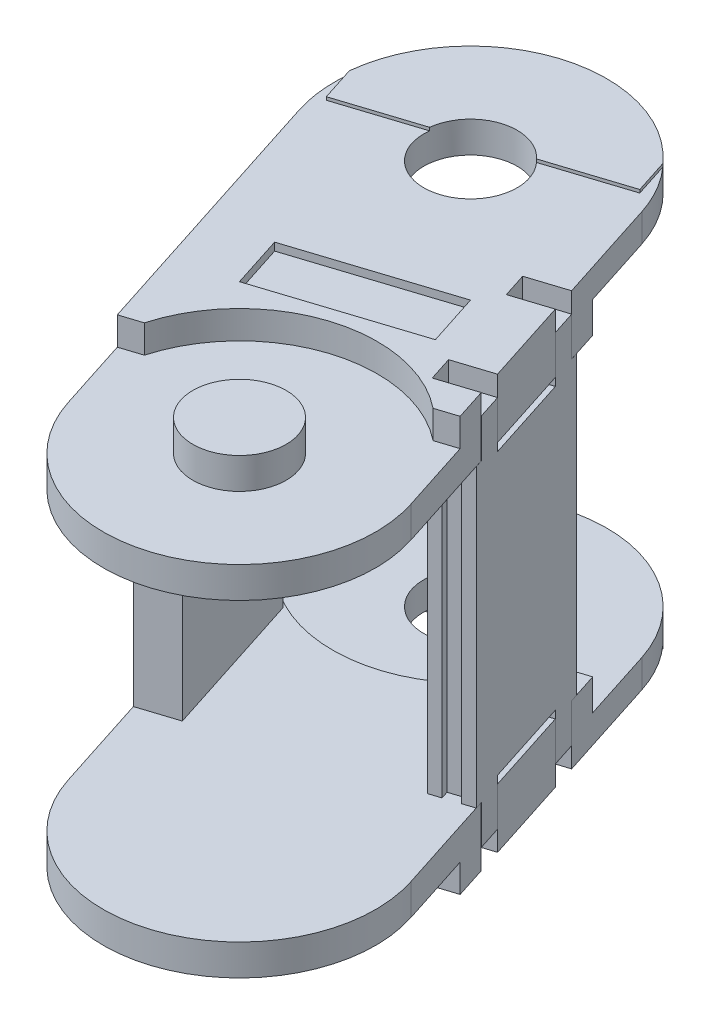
ISO-10303-21;
HEADER;
FILE_DESCRIPTION(('STEP AP214'),'2;1');
FILE_NAME('part.step','',(''),(''),'','','');
FILE_SCHEMA(('AUTOMOTIVE_DESIGN { 1 0 10303 214 1 1 1 1 }'));
ENDSEC;
DATA;
#1=APPLICATION_CONTEXT('core data for automotive mechanical design processes');
#2=APPLICATION_PROTOCOL_DEFINITION('international standard','automotive_design',2000,#1);
#3=PRODUCT_CONTEXT('',#1,'mechanical');
#4=PRODUCT('Part','Part','',(#3));
#5=PRODUCT_RELATED_PRODUCT_CATEGORY('part','',(#4));
#6=PRODUCT_DEFINITION_FORMATION('','',#4);
#7=PRODUCT_DEFINITION_CONTEXT('part definition',#1,'design');
#8=PRODUCT_DEFINITION('design','',#6,#7);
#9=PRODUCT_DEFINITION_SHAPE('','',#8);
#10=(LENGTH_UNIT() NAMED_UNIT(*) SI_UNIT(.MILLI.,.METRE.));
#11=(NAMED_UNIT(*) PLANE_ANGLE_UNIT() SI_UNIT($,.RADIAN.));
#12=(NAMED_UNIT(*) SI_UNIT($,.STERADIAN.) SOLID_ANGLE_UNIT());
#13=UNCERTAINTY_MEASURE_WITH_UNIT(LENGTH_MEASURE(1.E-05),#10,'distance_accuracy_value','');
#14=(GEOMETRIC_REPRESENTATION_CONTEXT(3) GLOBAL_UNCERTAINTY_ASSIGNED_CONTEXT((#13)) GLOBAL_UNIT_ASSIGNED_CONTEXT((#10,
#11,#12)) REPRESENTATION_CONTEXT('',''));
#15=CARTESIAN_POINT('',(0.,0.,0.));
#16=DIRECTION('',(0.,0.,1.));
#17=DIRECTION('',(1.,0.,0.));
#18=AXIS2_PLACEMENT_3D('',#15,#16,#17);
#19=CARTESIAN_POINT('',(-312.847484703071,-7.99999999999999,118.783580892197));
#20=DIRECTION('',(0.,-1.,0.));
#21=DIRECTION('',(0.,0.,-1.));
#22=AXIS2_PLACEMENT_3D('',#19,#20,#21);
#23=PLANE('',#22);
#24=CARTESIAN_POINT('',(-312.847484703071,-7.99999999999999,118.783580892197));
#25=DIRECTION('',(0.,1.,0.));
#26=DIRECTION('',(0.,0.,1.));
#27=AXIS2_PLACEMENT_3D('',#24,#25,#26);
#28=CIRCLE('',#27,6.00000000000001);
#29=CARTESIAN_POINT('',(-312.847484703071,-7.99999999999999,124.783580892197));
#30=VERTEX_POINT('',#29);
#31=EDGE_CURVE('E19',#30,#30,#28,.T.);
#32=ORIENTED_EDGE('',*,*,#31,.F.);
#33=EDGE_LOOP('',(#32));
#34=FACE_BOUND('',#33,.T.);
#35=ADVANCED_FACE('F16',(#34),#23,.T.);
#36=CARTESIAN_POINT('',(-319.900818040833,-6.59999999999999,96.8917904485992));
#37=DIRECTION('',(0.,1.,0.));
#38=DIRECTION('',(0.,0.,1.));
#39=AXIS2_PLACEMENT_3D('',#36,#37,#38);
#40=PLANE('',#39);
#41=DIRECTION('',(0.951816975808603,0.,-0.306666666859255));
#42=VECTOR('',#41,1.);
#43=CARTESIAN_POINT('',(-320.974151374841,-6.59999999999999,93.560431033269));
#44=LINE('',#43,#42);
#45=CARTESIAN_POINT('',(-311.455981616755,-6.59999999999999,90.4937643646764));
#46=VERTEX_POINT('',#45);
#47=CARTESIAN_POINT('',(-330.492321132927,-6.59999999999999,96.6270977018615));
#48=VERTEX_POINT('',#47);
#49=EDGE_CURVE('E1367',#46,#48,#44,.F.);
#50=ORIENTED_EDGE('',*,*,#49,.F.);
#51=DIRECTION('',(0.306666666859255,0.,0.951816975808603));
#52=VECTOR('',#51,1.);
#53=CARTESIAN_POINT('',(-310.382648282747,-6.59999999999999,93.8251237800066));
#54=LINE('',#53,#52);
#55=CARTESIAN_POINT('',(-309.30931494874,-6.59999999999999,97.1564831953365));
#56=VERTEX_POINT('',#55);
#57=EDGE_CURVE('E1372',#56,#46,#54,.F.);
#58=ORIENTED_EDGE('',*,*,#57,.F.);
#59=DIRECTION('',(-0.951816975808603,0.,0.306666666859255));
#60=VECTOR('',#59,1.);
#61=CARTESIAN_POINT('',(-318.827484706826,-6.59999999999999,100.223149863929));
#62=LINE('',#61,#60);
#63=CARTESIAN_POINT('',(-328.345654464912,-6.59999999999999,103.289816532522));
#64=VERTEX_POINT('',#63);
#65=EDGE_CURVE('E657',#64,#56,#62,.F.);
#66=ORIENTED_EDGE('',*,*,#65,.F.);
#67=DIRECTION('',(-0.306666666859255,0.,-0.951816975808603));
#68=VECTOR('',#67,1.);
#69=CARTESIAN_POINT('',(-329.418987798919,-6.59999999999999,99.9584571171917));
#70=LINE('',#69,#68);
#71=EDGE_CURVE('E1362',#48,#64,#70,.F.);
#72=ORIENTED_EDGE('',*,*,#71,.F.);
#73=EDGE_LOOP('',(#50,#58,#66,#72));
#74=FACE_BOUND('',#73,.T.);
#75=ADVANCED_FACE('F2451',(#74),#40,.F.);
#76=CARTESIAN_POINT('',(-312.847484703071,46.,118.783580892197));
#77=DIRECTION('',(0.,1.,0.));
#78=DIRECTION('',(0.,0.,1.));
#79=AXIS2_PLACEMENT_3D('',#76,#77,#78);
#80=PLANE('',#79);
#81=CARTESIAN_POINT('',(-312.847484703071,46.,118.783580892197));
#82=DIRECTION('',(0.,-1.,0.));
#83=DIRECTION('',(0.,0.,-1.));
#84=AXIS2_PLACEMENT_3D('',#81,#82,#83);
#85=CIRCLE('',#84,6.00000000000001);
#86=CARTESIAN_POINT('',(-312.847484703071,46.,112.783580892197));
#87=VERTEX_POINT('',#86);
#88=EDGE_CURVE('E682',#87,#87,#85,.T.);
#89=ORIENTED_EDGE('',*,*,#88,.F.);
#90=EDGE_LOOP('',(#89));
#91=FACE_BOUND('',#90,.T.);
#92=ADVANCED_FACE('F2442',(#91),#80,.T.);
#93=CARTESIAN_POINT('',(-319.900818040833,44.6,96.8917904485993));
#94=DIRECTION('',(0.,-1.,0.));
#95=DIRECTION('',(0.,0.,-1.));
#96=AXIS2_PLACEMENT_3D('',#93,#94,#95);
#97=PLANE('',#96);
#98=DIRECTION('',(0.951816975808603,0.,-0.306666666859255));
#99=VECTOR('',#98,1.);
#100=CARTESIAN_POINT('',(-320.974151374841,44.6,93.5604310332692));
#101=LINE('',#100,#99);
#102=CARTESIAN_POINT('',(-330.492321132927,44.6,96.6270977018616));
#103=VERTEX_POINT('',#102);
#104=CARTESIAN_POINT('',(-311.455981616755,44.6,90.4937643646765));
#105=VERTEX_POINT('',#104);
#106=EDGE_CURVE('E1231',#103,#105,#101,.T.);
#107=ORIENTED_EDGE('',*,*,#106,.F.);
#108=DIRECTION('',(-0.306666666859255,0.,-0.951816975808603));
#109=VECTOR('',#108,1.);
#110=CARTESIAN_POINT('',(-329.418987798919,44.6,99.9584571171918));
#111=LINE('',#110,#109);
#112=CARTESIAN_POINT('',(-328.345654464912,44.6,103.289816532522));
#113=VERTEX_POINT('',#112);
#114=EDGE_CURVE('E1225',#113,#103,#111,.T.);
#115=ORIENTED_EDGE('',*,*,#114,.F.);
#116=DIRECTION('',(-0.951816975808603,0.,0.306666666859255));
#117=VECTOR('',#116,1.);
#118=CARTESIAN_POINT('',(-318.827484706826,44.6,100.223149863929));
#119=LINE('',#118,#117);
#120=CARTESIAN_POINT('',(-309.30931494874,44.6,97.1564831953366));
#121=VERTEX_POINT('',#120);
#122=EDGE_CURVE('E838',#121,#113,#119,.T.);
#123=ORIENTED_EDGE('',*,*,#122,.F.);
#124=DIRECTION('',(0.306666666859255,0.,0.951816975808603));
#125=VECTOR('',#124,1.);
#126=CARTESIAN_POINT('',(-310.382648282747,44.6,93.8251237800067));
#127=LINE('',#126,#125);
#128=EDGE_CURVE('E1237',#105,#121,#127,.T.);
#129=ORIENTED_EDGE('',*,*,#128,.F.);
#130=EDGE_LOOP('',(#107,#115,#123,#129));
#131=FACE_BOUND('',#130,.T.);
#132=ADVANCED_FACE('F2433',(#131),#97,.F.);
#133=CARTESIAN_POINT('',(-304.926921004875,38.,102.573560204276));
#134=DIRECTION('',(0.306666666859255,0.,0.951816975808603));
#135=DIRECTION('',(0.951816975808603,0.,-0.306666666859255));
#136=AXIS2_PLACEMENT_3D('',#133,#134,#135);
#137=PLANE('',#136);
#138=DIRECTION('',(0.951816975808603,0.,-0.306666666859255));
#139=VECTOR('',#138,1.);
#140=CARTESIAN_POINT('',(-304.926921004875,0.,102.573560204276));
#141=LINE('',#140,#139);
#142=CARTESIAN_POINT('',(-304.926921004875,0.,102.573560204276));
#143=VERTEX_POINT('',#142);
#144=CARTESIAN_POINT('',(-303.499195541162,0.,102.113560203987));
#145=VERTEX_POINT('',#144);
#146=EDGE_CURVE('E735',#143,#145,#141,.T.);
#147=ORIENTED_EDGE('',*,*,#146,.T.);
#148=DIRECTION('',(0.,1.,0.));
#149=VECTOR('',#148,1.);
#150=CARTESIAN_POINT('',(-303.499195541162,38.,102.113560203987));
#151=LINE('',#150,#149);
#152=CARTESIAN_POINT('',(-303.499195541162,38.,102.113560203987));
#153=VERTEX_POINT('',#152);
#154=EDGE_CURVE('E1185',#153,#145,#151,.F.);
#155=ORIENTED_EDGE('',*,*,#154,.F.);
#156=DIRECTION('',(0.951816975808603,0.,-0.306666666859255));
#157=VECTOR('',#156,1.);
#158=CARTESIAN_POINT('',(-304.926921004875,38.,102.573560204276));
#159=LINE('',#158,#157);
#160=CARTESIAN_POINT('',(-304.926921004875,38.,102.573560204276));
#161=VERTEX_POINT('',#160);
#162=EDGE_CURVE('E737',#153,#161,#159,.F.);
#163=ORIENTED_EDGE('',*,*,#162,.T.);
#164=DIRECTION('',(0.,1.,0.));
#165=VECTOR('',#164,1.);
#166=CARTESIAN_POINT('',(-304.926921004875,38.,102.573560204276));
#167=LINE('',#166,#165);
#168=EDGE_CURVE('E935',#143,#161,#167,.T.);
#169=ORIENTED_EDGE('',*,*,#168,.F.);
#170=EDGE_LOOP('',(#147,#155,#163,#169));
#171=FACE_BOUND('',#170,.T.);
#172=ADVANCED_FACE('F2424',(#171),#137,.T.);
#173=CARTESIAN_POINT('',(-312.847484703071,-5.99999999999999,118.783580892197));
#174=DIRECTION('',(0.,1.,0.));
#175=DIRECTION('',(0.,0.,1.));
#176=AXIS2_PLACEMENT_3D('',#173,#174,#175);
#177=CYLINDRICAL_SURFACE('',#176,6.00000000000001);
#178=ORIENTED_EDGE('',*,*,#31,.T.);
#179=EDGE_LOOP('',(#178));
#180=FACE_BOUND('',#179,.T.);
#181=CARTESIAN_POINT('',(-312.847484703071,-3.99999999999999,118.783580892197));
#182=DIRECTION('',(0.,1.,0.));
#183=DIRECTION('',(0.,0.,1.));
#184=AXIS2_PLACEMENT_3D('',#181,#182,#183);
#185=CIRCLE('',#184,6.00000000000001);
#186=CARTESIAN_POINT('',(-312.847484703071,-3.99999999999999,124.783580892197));
#187=VERTEX_POINT('',#186);
#188=EDGE_CURVE('E1055',#187,#187,#185,.F.);
#189=ORIENTED_EDGE('',*,*,#188,.T.);
#190=EDGE_LOOP('',(#189));
#191=FACE_BOUND('',#190,.T.);
#192=ADVANCED_FACE('F2415',(#180,#191),#177,.T.);
#193=CARTESIAN_POINT('',(-312.847484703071,-5.99999999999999,118.783580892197));
#194=DIRECTION('',(0.,1.,0.));
#195=DIRECTION('',(0.,0.,1.));
#196=AXIS2_PLACEMENT_3D('',#193,#194,#195);
#197=CYLINDRICAL_SURFACE('',#196,17.7);
#198=DIRECTION('',(0.,1.,0.));
#199=VECTOR('',#198,1.);
#200=CARTESIAN_POINT('',(-329.882032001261,-5.99999999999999,113.975858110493));
#201=LINE('',#200,#199);
#202=CARTESIAN_POINT('',(-329.882032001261,-7.59999999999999,113.975858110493));
#203=VERTEX_POINT('',#202);
#204=CARTESIAN_POINT('',(-329.882032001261,-3.99999999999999,113.975858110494));
#205=VERTEX_POINT('',#204);
#206=EDGE_CURVE('E689',#203,#205,#201,.T.);
#207=ORIENTED_EDGE('',*,*,#206,.F.);
#208=CARTESIAN_POINT('',(-312.847484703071,-7.59999999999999,118.783580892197));
#209=DIRECTION('',(0.,1.,0.));
#210=DIRECTION('',(0.,0.,1.));
#211=AXIS2_PLACEMENT_3D('',#208,#209,#210);
#212=CIRCLE('',#211,17.7);
#213=CARTESIAN_POINT('',(-301.823604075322,-7.59999999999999,104.935690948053));
#214=VERTEX_POINT('',#213);
#215=EDGE_CURVE('E692',#214,#203,#212,.T.);
#216=ORIENTED_EDGE('',*,*,#215,.F.);
#217=DIRECTION('',(0.,1.,0.));
#218=VECTOR('',#217,1.);
#219=CARTESIAN_POINT('',(-301.823604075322,-5.99999999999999,104.935690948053));
#220=LINE('',#219,#218);
#221=CARTESIAN_POINT('',(-301.823604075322,-3.99999999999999,104.935690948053));
#222=VERTEX_POINT('',#221);
#223=EDGE_CURVE('E921',#222,#214,#220,.F.);
#224=ORIENTED_EDGE('',*,*,#223,.F.);
#225=CARTESIAN_POINT('',(-312.847484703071,-3.99999999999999,118.783580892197));
#226=DIRECTION('',(0.,1.,0.));
#227=DIRECTION('',(0.,0.,1.));
#228=AXIS2_PLACEMENT_3D('',#225,#226,#227);
#229=CIRCLE('',#228,17.7);
#230=EDGE_CURVE('E1063',#222,#205,#229,.T.);
#231=ORIENTED_EDGE('',*,*,#230,.T.);
#232=EDGE_LOOP('',(#207,#216,#224,#231));
#233=FACE_BOUND('',#232,.T.);
#234=ADVANCED_FACE('F2406',(#233),#197,.F.);
#235=CARTESIAN_POINT('',(-341.339889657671,-7.79999999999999,82.5241633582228));
#236=DIRECTION('',(-0.951816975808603,0.,0.306666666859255));
#237=DIRECTION('',(0.306666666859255,0.,0.951816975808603));
#238=AXIS2_PLACEMENT_3D('',#235,#236,#237);
#239=PLANE('',#238);
#240=DIRECTION('',(0.,1.,0.));
#241=VECTOR('',#240,1.);
#242=CARTESIAN_POINT('',(-344.357098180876,-7.79999999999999,73.1594993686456));
#243=LINE('',#242,#241);
#244=CARTESIAN_POINT('',(-344.357098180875,-7.59999999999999,73.159499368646));
#245=VERTEX_POINT('',#244);
#246=CARTESIAN_POINT('',(-344.357098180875,-7.99999999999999,73.159499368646));
#247=VERTEX_POINT('',#246);
#248=EDGE_CURVE('E685',#245,#247,#243,.F.);
#249=ORIENTED_EDGE('',*,*,#248,.T.);
#250=DIRECTION('',(0.306666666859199,0.,0.951816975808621));
#251=VECTOR('',#250,1.);
#252=CARTESIAN_POINT('',(-344.357098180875,-7.99999999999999,73.1594993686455));
#253=LINE('',#252,#251);
#254=CARTESIAN_POINT('',(-342.949889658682,-7.99999999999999,77.5271242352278));
#255=VERTEX_POINT('',#254);
#256=EDGE_CURVE('E644',#247,#255,#253,.T.);
#257=ORIENTED_EDGE('',*,*,#256,.T.);
#258=DIRECTION('',(0.,1.,0.));
#259=VECTOR('',#258,1.);
#260=CARTESIAN_POINT('',(-342.949889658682,-7.79999999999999,77.5271242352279));
#261=LINE('',#260,#259);
#262=CARTESIAN_POINT('',(-342.949889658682,-7.59999999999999,77.5271242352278));
#263=VERTEX_POINT('',#262);
#264=EDGE_CURVE('E676',#263,#255,#261,.F.);
#265=ORIENTED_EDGE('',*,*,#264,.F.);
#266=DIRECTION('',(0.306666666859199,0.,0.951816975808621));
#267=VECTOR('',#266,1.);
#268=CARTESIAN_POINT('',(-344.357098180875,-7.59999999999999,73.1594993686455));
#269=LINE('',#268,#267);
#270=EDGE_CURVE('E1084',#245,#263,#269,.T.);
#271=ORIENTED_EDGE('',*,*,#270,.F.);
#272=EDGE_LOOP('',(#249,#257,#265,#271));
#273=FACE_BOUND('',#272,.T.);
#274=ADVANCED_FACE('F1478',(#273),#239,.T.);
#275=CARTESIAN_POINT('',(-327.720818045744,-7.79999999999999,72.6204575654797));
#276=DIRECTION('',(0.306666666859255,0.,0.951816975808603));
#277=DIRECTION('',(0.951816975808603,0.,-0.306666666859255));
#278=AXIS2_PLACEMENT_3D('',#275,#276,#277);
#279=PLANE('',#278);
#280=ORIENTED_EDGE('',*,*,#264,.T.);
#281=DIRECTION('',(0.951816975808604,0.,-0.306666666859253));
#282=VECTOR('',#281,1.);
#283=CARTESIAN_POINT('',(-342.949889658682,-7.99999999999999,77.5271242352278));
#284=LINE('',#283,#282);
#285=CARTESIAN_POINT('',(-332.912366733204,-7.99999999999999,74.2931267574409));
#286=VERTEX_POINT('',#285);
#287=EDGE_CURVE('E668',#255,#286,#284,.T.);
#288=ORIENTED_EDGE('',*,*,#287,.T.);
#289=DIRECTION('',(0.,-1.,0.));
#290=VECTOR('',#289,1.);
#291=CARTESIAN_POINT('',(-332.912366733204,-4.,74.2931267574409));
#292=LINE('',#291,#290);
#293=CARTESIAN_POINT('',(-332.912366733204,-7.59999999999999,74.2931267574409));
#294=VERTEX_POINT('',#293);
#295=EDGE_CURVE('E679',#286,#294,#292,.F.);
#296=ORIENTED_EDGE('',*,*,#295,.T.);
#297=DIRECTION('',(0.951816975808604,0.,-0.306666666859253));
#298=VECTOR('',#297,1.);
#299=CARTESIAN_POINT('',(-342.949889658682,-7.59999999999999,77.5271242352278));
#300=LINE('',#299,#298);
#301=EDGE_CURVE('E1051',#263,#294,#300,.T.);
#302=ORIENTED_EDGE('',*,*,#301,.F.);
#303=EDGE_LOOP('',(#280,#288,#296,#302));
#304=FACE_BOUND('',#303,.T.);
#305=ADVANCED_FACE('F1076',(#304),#279,.T.);
#306=CARTESIAN_POINT('',(-327.720818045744,-7.79999999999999,72.6204575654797));
#307=DIRECTION('',(0.306666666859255,0.,0.951816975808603));
#308=DIRECTION('',(0.951816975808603,0.,-0.306666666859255));
#309=AXIS2_PLACEMENT_3D('',#306,#307,#308);
#310=PLANE('',#309);
#311=DIRECTION('',(0.,1.,0.));
#312=VECTOR('',#311,1.);
#313=CARTESIAN_POINT('',(-312.491746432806,-7.8,67.7137908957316));
#314=LINE('',#313,#312);
#315=CARTESIAN_POINT('',(-312.491746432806,-7.59999999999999,67.7137908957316));
#316=VERTEX_POINT('',#315);
#317=CARTESIAN_POINT('',(-312.491746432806,-7.99999999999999,67.7137908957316));
#318=VERTEX_POINT('',#317);
#319=EDGE_CURVE('E655',#316,#318,#314,.F.);
#320=ORIENTED_EDGE('',*,*,#319,.F.);
#321=DIRECTION('',(0.951816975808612,0.,-0.306666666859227));
#322=VECTOR('',#321,1.);
#323=CARTESIAN_POINT('',(-322.529269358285,-7.59999999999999,70.9477883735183));
#324=LINE('',#323,#322);
#325=CARTESIAN_POINT('',(-322.529269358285,-7.59999999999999,70.9477883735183));
#326=VERTEX_POINT('',#325);
#327=EDGE_CURVE('E1050',#326,#316,#324,.T.);
#328=ORIENTED_EDGE('',*,*,#327,.F.);
#329=DIRECTION('',(0.,-1.,0.));
#330=VECTOR('',#329,1.);
#331=CARTESIAN_POINT('',(-322.529269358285,-4.,70.9477883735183));
#332=LINE('',#331,#330);
#333=CARTESIAN_POINT('',(-322.529269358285,-7.99999999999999,70.9477883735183));
#334=VERTEX_POINT('',#333);
#335=EDGE_CURVE('E664',#326,#334,#332,.T.);
#336=ORIENTED_EDGE('',*,*,#335,.T.);
#337=DIRECTION('',(0.951816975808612,0.,-0.306666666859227));
#338=VECTOR('',#337,1.);
#339=CARTESIAN_POINT('',(-322.529269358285,-7.99999999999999,70.9477883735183));
#340=LINE('',#339,#338);
#341=EDGE_CURVE('E665',#334,#318,#340,.T.);
#342=ORIENTED_EDGE('',*,*,#341,.T.);
#343=EDGE_LOOP('',(#320,#328,#336,#342));
#344=FACE_BOUND('',#343,.T.);
#345=ADVANCED_FACE('F1469',(#344),#310,.T.);
#346=CARTESIAN_POINT('',(-310.881746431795,-7.8,72.7108300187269));
#347=DIRECTION('',(0.951816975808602,0.,-0.306666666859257));
#348=DIRECTION('',(-0.306666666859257,0.,-0.951816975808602));
#349=AXIS2_PLACEMENT_3D('',#346,#347,#348);
#350=PLANE('',#349);
#351=DIRECTION('',(0.,-1.,0.));
#352=VECTOR('',#351,1.);
#353=CARTESIAN_POINT('',(-313.898954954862,-7.99999999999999,63.3461660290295));
#354=LINE('',#353,#352);
#355=CARTESIAN_POINT('',(-313.898954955,-7.59999999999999,63.3461660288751));
#356=VERTEX_POINT('',#355);
#357=CARTESIAN_POINT('',(-313.898954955,-8.,63.3461660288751));
#358=VERTEX_POINT('',#357);
#359=EDGE_CURVE('E653',#356,#358,#354,.T.);
#360=ORIENTED_EDGE('',*,*,#359,.F.);
#361=DIRECTION('',(-0.306666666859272,0.,-0.951816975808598));
#362=VECTOR('',#361,1.);
#363=CARTESIAN_POINT('',(-312.491746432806,-7.59999999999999,67.7137908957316));
#364=LINE('',#363,#362);
#365=EDGE_CURVE('E1046',#316,#356,#364,.T.);
#366=ORIENTED_EDGE('',*,*,#365,.F.);
#367=ORIENTED_EDGE('',*,*,#319,.T.);
#368=DIRECTION('',(-0.306666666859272,0.,-0.951816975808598));
#369=VECTOR('',#368,1.);
#370=CARTESIAN_POINT('',(-312.491746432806,-7.99999999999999,67.7137908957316));
#371=LINE('',#370,#369);
#372=EDGE_CURVE('E642',#318,#358,#371,.T.);
#373=ORIENTED_EDGE('',*,*,#372,.T.);
#374=EDGE_LOOP('',(#360,#366,#367,#373));
#375=FACE_BOUND('',#374,.T.);
#376=ADVANCED_FACE('F651',(#375),#350,.T.);
#377=CARTESIAN_POINT('',(-308.383563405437,-4.,83.7254376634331));
#378=DIRECTION('',(0.306666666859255,0.,0.951816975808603));
#379=DIRECTION('',(0.951816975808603,0.,-0.306666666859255));
#380=AXIS2_PLACEMENT_3D('',#377,#378,#379);
#381=PLANE('',#380);
#382=DIRECTION('',(0.,1.,0.));
#383=VECTOR('',#382,1.);
#384=CARTESIAN_POINT('',(-310.763105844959,-4.,84.4921043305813));
#385=LINE('',#384,#383);
#386=CARTESIAN_POINT('',(-310.763105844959,-7.59999999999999,84.4921043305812));
#387=VERTEX_POINT('',#386);
#388=CARTESIAN_POINT('',(-310.763105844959,0.,84.4921043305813));
#389=VERTEX_POINT('',#388);
#390=EDGE_CURVE('E1342',#387,#389,#385,.T.);
#391=ORIENTED_EDGE('',*,*,#390,.F.);
#392=DIRECTION('',(-0.951816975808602,0.,0.306666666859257));
#393=VECTOR('',#392,1.);
#394=CARTESIAN_POINT('',(-306.004020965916,-7.59999999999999,82.958770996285));
#395=LINE('',#394,#393);
#396=CARTESIAN_POINT('',(-306.004020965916,-7.59999999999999,82.958770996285));
#397=VERTEX_POINT('',#396);
#398=EDGE_CURVE('E1434',#397,#387,#395,.T.);
#399=ORIENTED_EDGE('',*,*,#398,.F.);
#400=DIRECTION('',(0.,1.,0.));
#401=VECTOR('',#400,1.);
#402=CARTESIAN_POINT('',(-306.004020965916,-7.99999999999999,82.9587709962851));
#403=LINE('',#402,#401);
#404=CARTESIAN_POINT('',(-306.004020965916,-4.99999999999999,82.958770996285));
#405=VERTEX_POINT('',#404);
#406=EDGE_CURVE('E1296',#405,#397,#403,.F.);
#407=ORIENTED_EDGE('',*,*,#406,.F.);
#408=DIRECTION('',(-0.951816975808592,0.,0.30666666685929));
#409=VECTOR('',#408,1.);
#410=CARTESIAN_POINT('',(-306.004020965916,-4.99999999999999,82.958770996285));
#411=LINE('',#410,#409);
#412=CARTESIAN_POINT('',(-310.753587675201,-4.99999999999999,84.4890376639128));
#413=VERTEX_POINT('',#412);
#414=EDGE_CURVE('E823',#405,#413,#411,.T.);
#415=ORIENTED_EDGE('',*,*,#414,.T.);
#416=DIRECTION('',(0.,1.,0.));
#417=VECTOR('',#416,1.);
#418=CARTESIAN_POINT('',(-310.753587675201,38.,84.4890376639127));
#419=LINE('',#418,#417);
#420=CARTESIAN_POINT('',(-310.753587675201,0.,84.4890376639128));
#421=VERTEX_POINT('',#420);
#422=EDGE_CURVE('E834',#421,#413,#419,.F.);
#423=ORIENTED_EDGE('',*,*,#422,.F.);
#424=DIRECTION('',(0.951816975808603,0.,-0.306666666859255));
#425=VECTOR('',#424,1.);
#426=CARTESIAN_POINT('',(-308.383563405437,0.,83.7254376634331));
#427=LINE('',#426,#425);
#428=EDGE_CURVE('E675',#421,#389,#427,.F.);
#429=ORIENTED_EDGE('',*,*,#428,.T.);
#430=EDGE_LOOP('',(#391,#399,#407,#415,#423,#429));
#431=FACE_BOUND('',#430,.T.);
#432=ADVANCED_FACE('F1456',(#431),#381,.T.);
#433=CARTESIAN_POINT('',(-307.386896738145,-4.,86.818842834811));
#434=DIRECTION('',(-0.306666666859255,0.,-0.951816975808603));
#435=DIRECTION('',(-0.951816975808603,0.,0.306666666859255));
#436=AXIS2_PLACEMENT_3D('',#433,#434,#435);
#437=PLANE('',#436);
#438=DIRECTION('',(0.951816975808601,0.,-0.306666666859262));
#439=VECTOR('',#438,1.);
#440=CARTESIAN_POINT('',(-309.766439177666,-7.59999999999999,87.5855095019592));
#441=LINE('',#440,#439);
#442=CARTESIAN_POINT('',(-309.766439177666,-7.59999999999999,87.5855095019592));
#443=VERTEX_POINT('',#442);
#444=CARTESIAN_POINT('',(-305.007354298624,-7.59999999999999,86.052176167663));
#445=VERTEX_POINT('',#444);
#446=EDGE_CURVE('E1416',#443,#445,#441,.T.);
#447=ORIENTED_EDGE('',*,*,#446,.F.);
#448=DIRECTION('',(0.,1.,0.));
#449=VECTOR('',#448,1.);
#450=CARTESIAN_POINT('',(-309.766439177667,-4.,87.5855095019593));
#451=LINE('',#450,#449);
#452=CARTESIAN_POINT('',(-309.766439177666,0.,87.5855095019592));
#453=VERTEX_POINT('',#452);
#454=EDGE_CURVE('E1424',#453,#443,#451,.F.);
#455=ORIENTED_EDGE('',*,*,#454,.F.);
#456=DIRECTION('',(-0.951816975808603,0.,0.306666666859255));
#457=VECTOR('',#456,1.);
#458=CARTESIAN_POINT('',(-307.386896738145,0.,86.818842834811));
#459=LINE('',#458,#457);
#460=CARTESIAN_POINT('',(-309.756921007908,0.,87.5824428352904));
#461=VERTEX_POINT('',#460);
#462=EDGE_CURVE('E847',#453,#461,#459,.F.);
#463=ORIENTED_EDGE('',*,*,#462,.T.);
#464=DIRECTION('',(0.,1.,0.));
#465=VECTOR('',#464,1.);
#466=CARTESIAN_POINT('',(-309.756921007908,38.,87.5824428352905));
#467=LINE('',#466,#465);
#468=CARTESIAN_POINT('',(-309.756921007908,-4.99999999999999,87.5824428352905));
#469=VERTEX_POINT('',#468);
#470=EDGE_CURVE('E837',#469,#461,#467,.T.);
#471=ORIENTED_EDGE('',*,*,#470,.F.);
#472=DIRECTION('',(0.951816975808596,0.,-0.306666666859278));
#473=VECTOR('',#472,1.);
#474=CARTESIAN_POINT('',(-309.756921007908,-4.99999999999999,87.5824428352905));
#475=LINE('',#474,#473);
#476=CARTESIAN_POINT('',(-305.007354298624,-4.99999999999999,86.0521761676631));
#477=VERTEX_POINT('',#476);
#478=EDGE_CURVE('E843',#469,#477,#475,.T.);
#479=ORIENTED_EDGE('',*,*,#478,.T.);
#480=DIRECTION('',(0.,1.,0.));
#481=VECTOR('',#480,1.);
#482=CARTESIAN_POINT('',(-305.007354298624,-7.99999999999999,86.0521761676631));
#483=LINE('',#482,#481);
#484=EDGE_CURVE('E1420',#445,#477,#483,.T.);
#485=ORIENTED_EDGE('',*,*,#484,.F.);
#486=EDGE_LOOP('',(#447,#455,#463,#471,#479,#485));
#487=FACE_BOUND('',#486,.T.);
#488=ADVANCED_FACE('F1828',(#487),#437,.T.);
#489=CARTESIAN_POINT('',(-303.860230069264,-4.,97.76473805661));
#490=DIRECTION('',(0.306666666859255,0.,0.951816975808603));
#491=DIRECTION('',(0.951816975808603,0.,-0.306666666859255));
#492=AXIS2_PLACEMENT_3D('',#489,#490,#491);
#493=PLANE('',#492);
#494=DIRECTION('',(0.951816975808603,0.,-0.306666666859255));
#495=VECTOR('',#494,1.);
#496=CARTESIAN_POINT('',(-303.860230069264,0.,97.76473805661));
#497=LINE('',#496,#495);
#498=CARTESIAN_POINT('',(-306.230254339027,0.,98.5283380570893));
#499=VERTEX_POINT('',#498);
#500=CARTESIAN_POINT('',(-306.239772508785,0.,98.5314047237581));
#501=VERTEX_POINT('',#500);
#502=EDGE_CURVE('E877',#499,#501,#497,.F.);
#503=ORIENTED_EDGE('',*,*,#502,.T.);
#504=DIRECTION('',(0.,1.,0.));
#505=VECTOR('',#504,1.);
#506=CARTESIAN_POINT('',(-306.239772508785,-4.,98.5314047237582));
#507=LINE('',#506,#505);
#508=CARTESIAN_POINT('',(-306.239772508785,-7.59999999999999,98.5314047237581));
#509=VERTEX_POINT('',#508);
#510=EDGE_CURVE('E1401',#509,#501,#507,.T.);
#511=ORIENTED_EDGE('',*,*,#510,.F.);
#512=DIRECTION('',(-0.9518169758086,0.,0.306666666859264));
#513=VECTOR('',#512,1.);
#514=CARTESIAN_POINT('',(-301.480687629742,-7.59999999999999,96.9980713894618));
#515=LINE('',#514,#513);
#516=CARTESIAN_POINT('',(-301.480687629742,-7.59999999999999,96.9980713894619));
#517=VERTEX_POINT('',#516);
#518=EDGE_CURVE('E1397',#517,#509,#515,.T.);
#519=ORIENTED_EDGE('',*,*,#518,.F.);
#520=DIRECTION('',(0.,1.,0.));
#521=VECTOR('',#520,1.);
#522=CARTESIAN_POINT('',(-301.480687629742,-7.99999999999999,96.998071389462));
#523=LINE('',#522,#521);
#524=CARTESIAN_POINT('',(-301.480687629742,-4.99999999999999,96.998071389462));
#525=VERTEX_POINT('',#524);
#526=EDGE_CURVE('E1406',#525,#517,#523,.F.);
#527=ORIENTED_EDGE('',*,*,#526,.F.);
#528=DIRECTION('',(-0.951816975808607,0.,0.306666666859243));
#529=VECTOR('',#528,1.);
#530=CARTESIAN_POINT('',(-301.480687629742,-4.99999999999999,96.9980713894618));
#531=LINE('',#530,#529);
#532=CARTESIAN_POINT('',(-306.230254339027,-4.99999999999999,98.5283380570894));
#533=VERTEX_POINT('',#532);
#534=EDGE_CURVE('E751',#525,#533,#531,.T.);
#535=ORIENTED_EDGE('',*,*,#534,.T.);
#536=DIRECTION('',(0.,1.,0.));
#537=VECTOR('',#536,1.);
#538=CARTESIAN_POINT('',(-306.230254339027,38.,98.5283380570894));
#539=LINE('',#538,#537);
#540=EDGE_CURVE('E936',#499,#533,#539,.F.);
#541=ORIENTED_EDGE('',*,*,#540,.F.);
#542=EDGE_LOOP('',(#503,#511,#519,#527,#535,#541));
#543=FACE_BOUND('',#542,.T.);
#544=ADVANCED_FACE('F1824',(#543),#493,.T.);
#545=CARTESIAN_POINT('',(-302.863563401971,-4.,100.858143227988));
#546=DIRECTION('',(-0.306666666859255,0.,-0.951816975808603));
#547=DIRECTION('',(-0.951816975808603,0.,0.306666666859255));
#548=AXIS2_PLACEMENT_3D('',#545,#546,#547);
#549=PLANE('',#548);
#550=DIRECTION('',(0.,1.,0.));
#551=VECTOR('',#550,1.);
#552=CARTESIAN_POINT('',(-300.48402096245,-7.99999999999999,100.09147656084));
#553=LINE('',#552,#551);
#554=CARTESIAN_POINT('',(-300.48402096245,-7.59999999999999,100.09147656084));
#555=VERTEX_POINT('',#554);
#556=CARTESIAN_POINT('',(-300.48402096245,-4.99999999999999,100.09147656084));
#557=VERTEX_POINT('',#556);
#558=EDGE_CURVE('E1383',#555,#557,#553,.T.);
#559=ORIENTED_EDGE('',*,*,#558,.F.);
#560=DIRECTION('',(0.95181697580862,0.,-0.306666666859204));
#561=VECTOR('',#560,1.);
#562=CARTESIAN_POINT('',(-305.243105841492,-7.59999999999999,101.624809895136));
#563=LINE('',#562,#561);
#564=CARTESIAN_POINT('',(-305.243105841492,-7.59999999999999,101.624809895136));
#565=VERTEX_POINT('',#564);
#566=EDGE_CURVE('E1379',#565,#555,#563,.T.);
#567=ORIENTED_EDGE('',*,*,#566,.F.);
#568=DIRECTION('',(0.,1.,0.));
#569=VECTOR('',#568,1.);
#570=CARTESIAN_POINT('',(-305.243105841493,-4.,101.624809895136));
#571=LINE('',#570,#569);
#572=CARTESIAN_POINT('',(-305.243105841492,0.,101.624809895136));
#573=VERTEX_POINT('',#572);
#574=EDGE_CURVE('E1387',#573,#565,#571,.F.);
#575=ORIENTED_EDGE('',*,*,#574,.F.);
#576=DIRECTION('',(-0.951816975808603,0.,0.306666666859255));
#577=VECTOR('',#576,1.);
#578=CARTESIAN_POINT('',(-302.863563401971,0.,100.858143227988));
#579=LINE('',#578,#577);
#580=CARTESIAN_POINT('',(-305.233587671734,0.,101.621743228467));
#581=VERTEX_POINT('',#580);
#582=EDGE_CURVE('E910',#573,#581,#579,.F.);
#583=ORIENTED_EDGE('',*,*,#582,.T.);
#584=DIRECTION('',(0.,1.,0.));
#585=VECTOR('',#584,1.);
#586=CARTESIAN_POINT('',(-305.233587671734,38.,101.621743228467));
#587=LINE('',#586,#585);
#588=CARTESIAN_POINT('',(-305.233587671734,-4.99999999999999,101.621743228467));
#589=VERTEX_POINT('',#588);
#590=EDGE_CURVE('E932',#589,#581,#587,.T.);
#591=ORIENTED_EDGE('',*,*,#590,.F.);
#592=DIRECTION('',(0.951816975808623,0.,-0.306666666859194));
#593=VECTOR('',#592,1.);
#594=CARTESIAN_POINT('',(-305.233587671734,-4.99999999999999,101.621743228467));
#595=LINE('',#594,#593);
#596=EDGE_CURVE('E924',#589,#557,#595,.T.);
#597=ORIENTED_EDGE('',*,*,#596,.T.);
#598=EDGE_LOOP('',(#559,#567,#575,#583,#591,#597));
#599=FACE_BOUND('',#598,.T.);
#600=ADVANCED_FACE('F1820',(#599),#549,.T.);
#601=CARTESIAN_POINT('',(-315.852818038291,-5.99999999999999,109.455774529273));
#602=DIRECTION('',(0.306666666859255,0.,0.951816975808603));
#603=DIRECTION('',(0.951816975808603,0.,-0.306666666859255));
#604=AXIS2_PLACEMENT_3D('',#601,#602,#603);
#605=PLANE('',#604);
#606=DIRECTION('',(-0.951816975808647,0.,0.306666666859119));
#607=VECTOR('',#606,1.);
#608=CARTESIAN_POINT('',(-299.196020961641,-7.59999999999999,104.089107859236));
#609=LINE('',#608,#607);
#610=CARTESIAN_POINT('',(-299.196020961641,-7.59999999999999,104.089107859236));
#611=VERTEX_POINT('',#610);
#612=EDGE_CURVE('E1378',#611,#214,#609,.T.);
#613=ORIENTED_EDGE('',*,*,#612,.F.);
#614=DIRECTION('',(0.,1.,0.));
#615=VECTOR('',#614,1.);
#616=CARTESIAN_POINT('',(-299.196020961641,-7.99999999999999,104.089107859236));
#617=LINE('',#616,#615);
#618=CARTESIAN_POINT('',(-299.196020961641,-3.99999999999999,104.089107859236));
#619=VERTEX_POINT('',#618);
#620=EDGE_CURVE('E1070',#619,#611,#617,.F.);
#621=ORIENTED_EDGE('',*,*,#620,.F.);
#622=DIRECTION('',(-0.951816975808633,0.,0.306666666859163));
#623=VECTOR('',#622,1.);
#624=CARTESIAN_POINT('',(-299.196020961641,-3.99999999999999,104.089107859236));
#625=LINE('',#624,#623);
#626=EDGE_CURVE('E1058',#619,#222,#625,.T.);
#627=ORIENTED_EDGE('',*,*,#626,.T.);
#628=ORIENTED_EDGE('',*,*,#223,.T.);
#629=EDGE_LOOP('',(#613,#621,#627,#628));
#630=FACE_BOUND('',#629,.T.);
#631=ADVANCED_FACE('F1816',(#630),#605,.T.);
#632=CARTESIAN_POINT('',(-310.382648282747,-7.09999999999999,93.8251237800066));
#633=DIRECTION('',(-0.951816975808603,0.,0.306666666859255));
#634=DIRECTION('',(0.306666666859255,0.,0.951816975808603));
#635=AXIS2_PLACEMENT_3D('',#632,#633,#634);
#636=PLANE('',#635);
#637=DIRECTION('',(0.,1.,0.));
#638=VECTOR('',#637,1.);
#639=CARTESIAN_POINT('',(-309.30931494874,-7.09999999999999,97.1564831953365));
#640=LINE('',#639,#638);
#641=CARTESIAN_POINT('',(-309.30931494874,-7.59999999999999,97.1564831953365));
#642=VERTEX_POINT('',#641);
#643=EDGE_CURVE('E1359',#56,#642,#640,.F.);
#644=ORIENTED_EDGE('',*,*,#643,.F.);
#645=ORIENTED_EDGE('',*,*,#57,.T.);
#646=DIRECTION('',(0.,1.,0.));
#647=VECTOR('',#646,1.);
#648=CARTESIAN_POINT('',(-311.455981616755,-7.09999999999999,90.4937643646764));
#649=LINE('',#648,#647);
#650=CARTESIAN_POINT('',(-311.455981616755,-7.59999999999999,90.4937643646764));
#651=VERTEX_POINT('',#650);
#652=EDGE_CURVE('E1369',#651,#46,#649,.T.);
#653=ORIENTED_EDGE('',*,*,#652,.F.);
#654=DIRECTION('',(-0.306666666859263,0.,-0.9518169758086));
#655=VECTOR('',#654,1.);
#656=CARTESIAN_POINT('',(-309.30931494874,-7.59999999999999,97.1564831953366));
#657=LINE('',#656,#655);
#658=EDGE_CURVE('E2504',#642,#651,#657,.T.);
#659=ORIENTED_EDGE('',*,*,#658,.F.);
#660=EDGE_LOOP('',(#644,#645,#653,#659));
#661=FACE_BOUND('',#660,.T.);
#662=ADVANCED_FACE('F1812',(#661),#636,.T.);
#663=CARTESIAN_POINT('',(-320.974151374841,-7.09999999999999,93.560431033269));
#664=DIRECTION('',(0.306666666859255,0.,0.951816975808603));
#665=DIRECTION('',(0.951816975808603,0.,-0.306666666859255));
#666=AXIS2_PLACEMENT_3D('',#663,#664,#665);
#667=PLANE('',#666);
#668=ORIENTED_EDGE('',*,*,#652,.T.);
#669=ORIENTED_EDGE('',*,*,#49,.T.);
#670=DIRECTION('',(0.,1.,0.));
#671=VECTOR('',#670,1.);
#672=CARTESIAN_POINT('',(-330.492321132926,-7.09999999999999,96.6270977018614));
#673=LINE('',#672,#671);
#674=CARTESIAN_POINT('',(-330.492321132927,-7.59999999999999,96.6270977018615));
#675=VERTEX_POINT('',#674);
#676=EDGE_CURVE('E1364',#675,#48,#673,.T.);
#677=ORIENTED_EDGE('',*,*,#676,.F.);
#678=DIRECTION('',(-0.951816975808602,0.,0.306666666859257));
#679=VECTOR('',#678,1.);
#680=CARTESIAN_POINT('',(-311.455981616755,-7.59999999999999,90.4937643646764));
#681=LINE('',#680,#679);
#682=EDGE_CURVE('E2722',#651,#675,#681,.T.);
#683=ORIENTED_EDGE('',*,*,#682,.F.);
#684=EDGE_LOOP('',(#668,#669,#677,#683));
#685=FACE_BOUND('',#684,.T.);
#686=ADVANCED_FACE('F1808',(#685),#667,.T.);
#687=CARTESIAN_POINT('',(-329.418987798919,-7.09999999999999,99.9584571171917));
#688=DIRECTION('',(0.951816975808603,0.,-0.306666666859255));
#689=DIRECTION('',(-0.306666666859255,0.,-0.951816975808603));
#690=AXIS2_PLACEMENT_3D('',#687,#688,#689);
#691=PLANE('',#690);
#692=ORIENTED_EDGE('',*,*,#676,.T.);
#693=ORIENTED_EDGE('',*,*,#71,.T.);
#694=DIRECTION('',(0.,1.,0.));
#695=VECTOR('',#694,1.);
#696=CARTESIAN_POINT('',(-328.345654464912,-7.09999999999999,103.289816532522));
#697=LINE('',#696,#695);
#698=CARTESIAN_POINT('',(-328.345654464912,-7.59999999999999,103.289816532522));
#699=VERTEX_POINT('',#698);
#700=EDGE_CURVE('E1356',#699,#64,#697,.T.);
#701=ORIENTED_EDGE('',*,*,#700,.F.);
#702=DIRECTION('',(0.306666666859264,0.,0.9518169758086));
#703=VECTOR('',#702,1.);
#704=CARTESIAN_POINT('',(-330.492321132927,-7.59999999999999,96.6270977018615));
#705=LINE('',#704,#703);
#706=EDGE_CURVE('E2719',#675,#699,#705,.T.);
#707=ORIENTED_EDGE('',*,*,#706,.F.);
#708=EDGE_LOOP('',(#692,#693,#701,#707));
#709=FACE_BOUND('',#708,.T.);
#710=ADVANCED_FACE('F1804',(#709),#691,.T.);
#711=CARTESIAN_POINT('',(-318.827484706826,-7.09999999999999,100.223149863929));
#712=DIRECTION('',(-0.306666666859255,0.,-0.951816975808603));
#713=DIRECTION('',(-0.951816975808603,0.,0.306666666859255));
#714=AXIS2_PLACEMENT_3D('',#711,#712,#713);
#715=PLANE('',#714);
#716=ORIENTED_EDGE('',*,*,#700,.T.);
#717=ORIENTED_EDGE('',*,*,#65,.T.);
#718=ORIENTED_EDGE('',*,*,#643,.T.);
#719=DIRECTION('',(0.9518169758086,0.,-0.306666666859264));
#720=VECTOR('',#719,1.);
#721=CARTESIAN_POINT('',(-328.345654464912,-7.59999999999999,103.289816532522));
#722=LINE('',#721,#720);
#723=EDGE_CURVE('E648',#699,#642,#722,.T.);
#724=ORIENTED_EDGE('',*,*,#723,.F.);
#725=EDGE_LOOP('',(#716,#717,#718,#724));
#726=FACE_BOUND('',#725,.T.);
#727=ADVANCED_FACE('F1801',(#726),#715,.T.);
#728=CARTESIAN_POINT('',(-319.900818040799,-7.99999999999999,96.8917904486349));
#729=DIRECTION('',(0.,1.,0.));
#730=DIRECTION('',(0.,0.,1.));
#731=AXIS2_PLACEMENT_3D('',#728,#729,#730);
#732=PLANE('',#731);
#733=ORIENTED_EDGE('',*,*,#341,.F.);
#734=CARTESIAN_POINT('',(-326.954151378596,-7.99999999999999,75.0000000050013));
#735=DIRECTION('',(0.,-1.,0.));
#736=DIRECTION('',(0.,0.,-1.));
#737=AXIS2_PLACEMENT_3D('',#734,#735,#736);
#738=CIRCLE('',#737,6.00000000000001);
#739=EDGE_CURVE('E631',#334,#286,#738,.F.);
#740=ORIENTED_EDGE('',*,*,#739,.T.);
#741=ORIENTED_EDGE('',*,*,#287,.F.);
#742=ORIENTED_EDGE('',*,*,#256,.F.);
#743=CARTESIAN_POINT('',(-326.95415137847,-7.99999999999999,75.0000000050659));
#744=DIRECTION('',(0.,-1.,0.));
#745=DIRECTION('',(0.,0.,-1.));
#746=AXIS2_PLACEMENT_3D('',#743,#744,#745);
#747=CIRCLE('',#746,17.5);
#748=EDGE_CURVE('E638',#358,#247,#747,.F.);
#749=ORIENTED_EDGE('',*,*,#748,.F.);
#750=ORIENTED_EDGE('',*,*,#372,.F.);
#751=EDGE_LOOP('',(#733,#740,#741,#742,#749,#750));
#752=FACE_BOUND('',#751,.T.);
#753=ADVANCED_FACE('F641',(#752),#732,.F.);
#754=CARTESIAN_POINT('',(-326.954151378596,-4.,75.0000000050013));
#755=DIRECTION('',(0.,-1.,0.));
#756=DIRECTION('',(0.,0.,-1.));
#757=AXIS2_PLACEMENT_3D('',#754,#755,#756);
#758=CYLINDRICAL_SURFACE('',#757,6.00000000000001);
#759=ORIENTED_EDGE('',*,*,#739,.F.);
#760=ORIENTED_EDGE('',*,*,#335,.F.);
#761=CARTESIAN_POINT('',(-326.954151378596,-7.59999999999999,75.0000000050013));
#762=DIRECTION('',(0.,-1.,0.));
#763=DIRECTION('',(0.,0.,-1.));
#764=AXIS2_PLACEMENT_3D('',#761,#762,#763);
#765=CIRCLE('',#764,6.00000000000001);
#766=EDGE_CURVE('E1047',#294,#326,#765,.F.);
#767=ORIENTED_EDGE('',*,*,#766,.F.);
#768=ORIENTED_EDGE('',*,*,#295,.F.);
#769=EDGE_LOOP('',(#759,#760,#767,#768));
#770=FACE_BOUND('',#769,.T.);
#771=CARTESIAN_POINT('',(-326.954151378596,-3.999,75.0000000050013));
#772=DIRECTION('',(0.,-1.,0.));
#773=DIRECTION('',(0.,0.,-1.));
#774=AXIS2_PLACEMENT_3D('',#771,#772,#773);
#775=CIRCLE('',#774,6.00000000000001);
#776=CARTESIAN_POINT('',(-326.954151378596,-3.999,69.0000000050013));
#777=VERTEX_POINT('',#776);
#778=EDGE_CURVE('E1033',#777,#777,#775,.F.);
#779=ORIENTED_EDGE('',*,*,#778,.T.);
#780=EDGE_LOOP('',(#779));
#781=FACE_BOUND('',#780,.T.);
#782=ADVANCED_FACE('F1071',(#770,#781),#758,.F.);
#783=CARTESIAN_POINT('',(-312.847484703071,44.,118.783580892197));
#784=DIRECTION('',(0.,-1.,0.));
#785=DIRECTION('',(0.,0.,-1.));
#786=AXIS2_PLACEMENT_3D('',#783,#784,#785);
#787=CYLINDRICAL_SURFACE('',#786,6.00000000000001);
#788=ORIENTED_EDGE('',*,*,#88,.T.);
#789=EDGE_LOOP('',(#788));
#790=FACE_BOUND('',#789,.T.);
#791=CARTESIAN_POINT('',(-312.847484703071,42.,118.783580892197));
#792=DIRECTION('',(0.,-1.,0.));
#793=DIRECTION('',(0.,0.,-1.));
#794=AXIS2_PLACEMENT_3D('',#791,#792,#793);
#795=CIRCLE('',#794,6.00000000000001);
#796=CARTESIAN_POINT('',(-312.847484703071,42.,112.783580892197));
#797=VERTEX_POINT('',#796);
#798=EDGE_CURVE('E1025',#797,#797,#795,.F.);
#799=ORIENTED_EDGE('',*,*,#798,.T.);
#800=EDGE_LOOP('',(#799));
#801=FACE_BOUND('',#800,.T.);
#802=ADVANCED_FACE('F1792',(#790,#801),#787,.T.);
#803=CARTESIAN_POINT('',(-319.90081804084,46.,96.8917904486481));
#804=DIRECTION('',(0.,-1.,0.));
#805=DIRECTION('',(0.,0.,-1.));
#806=AXIS2_PLACEMENT_3D('',#803,#804,#805);
#807=PLANE('',#806);
#808=DIRECTION('',(0.951816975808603,0.,-0.306666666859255));
#809=VECTOR('',#808,1.);
#810=CARTESIAN_POINT('',(-327.720818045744,46.,72.6204575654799));
#811=LINE('',#810,#809);
#812=CARTESIAN_POINT('',(-332.912366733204,46.,74.2931267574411));
#813=VERTEX_POINT('',#812);
#814=CARTESIAN_POINT('',(-342.949889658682,46.,77.527124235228));
#815=VERTEX_POINT('',#814);
#816=EDGE_CURVE('E864',#813,#815,#811,.F.);
#817=ORIENTED_EDGE('',*,*,#816,.F.);
#818=CARTESIAN_POINT('',(-326.954151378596,46.,75.0000000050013));
#819=DIRECTION('',(0.,1.,0.));
#820=DIRECTION('',(0.,0.,1.));
#821=AXIS2_PLACEMENT_3D('',#818,#819,#820);
#822=CIRCLE('',#821,6.00000000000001);
#823=CARTESIAN_POINT('',(-322.529269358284,46.,70.9477883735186));
#824=VERTEX_POINT('',#823);
#825=EDGE_CURVE('E1066',#813,#824,#822,.F.);
#826=ORIENTED_EDGE('',*,*,#825,.T.);
#827=DIRECTION('',(0.951816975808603,0.,-0.306666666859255));
#828=VECTOR('',#827,1.);
#829=CARTESIAN_POINT('',(-327.720818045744,46.,72.6204575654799));
#830=LINE('',#829,#828);
#831=CARTESIAN_POINT('',(-312.491746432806,46.,67.7137908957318));
#832=VERTEX_POINT('',#831);
#833=EDGE_CURVE('E857',#832,#824,#830,.F.);
#834=ORIENTED_EDGE('',*,*,#833,.F.);
#835=DIRECTION('',(-0.306666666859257,0.,-0.951816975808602));
#836=VECTOR('',#835,1.);
#837=CARTESIAN_POINT('',(-310.881746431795,46.,72.7108300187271));
#838=LINE('',#837,#836);
#839=CARTESIAN_POINT('',(-313.898954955,46.,63.3461660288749));
#840=VERTEX_POINT('',#839);
#841=EDGE_CURVE('E1239',#840,#832,#838,.F.);
#842=ORIENTED_EDGE('',*,*,#841,.F.);
#843=CARTESIAN_POINT('',(-326.95415137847,46.,75.0000000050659));
#844=DIRECTION('',(0.,1.,0.));
#845=DIRECTION('',(0.,0.,1.));
#846=AXIS2_PLACEMENT_3D('',#843,#844,#845);
#847=CIRCLE('',#846,17.5);
#848=CARTESIAN_POINT('',(-344.357098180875,46.,73.1594993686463));
#849=VERTEX_POINT('',#848);
#850=EDGE_CURVE('E1018',#849,#840,#847,.F.);
#851=ORIENTED_EDGE('',*,*,#850,.F.);
#852=DIRECTION('',(0.306666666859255,0.,0.951816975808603));
#853=VECTOR('',#852,1.);
#854=CARTESIAN_POINT('',(-341.339889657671,46.,82.5241633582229));
#855=LINE('',#854,#853);
#856=EDGE_CURVE('E868',#815,#849,#855,.F.);
#857=ORIENTED_EDGE('',*,*,#856,.F.);
#858=EDGE_LOOP('',(#817,#826,#834,#842,#851,#857));
#859=FACE_BOUND('',#858,.T.);
#860=ADVANCED_FACE('F1788',(#859),#807,.F.);
#861=CARTESIAN_POINT('',(-310.297354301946,-7.99999999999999,69.6333333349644));
#862=DIRECTION('',(0.951816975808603,0.,-0.306666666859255));
#863=DIRECTION('',(-0.306666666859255,0.,-0.951816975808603));
#864=AXIS2_PLACEMENT_3D('',#861,#862,#863);
#865=PLANE('',#864);
#866=DIRECTION('',(0.,-1.,0.));
#867=VECTOR('',#866,1.);
#868=CARTESIAN_POINT('',(-296.19068762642,-7.99999999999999,113.41691422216));
#869=LINE('',#868,#867);
#870=CARTESIAN_POINT('',(-296.19068762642,-3.99999999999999,113.41691422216));
#871=VERTEX_POINT('',#870);
#872=CARTESIAN_POINT('',(-296.19068762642,0.,113.41691422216));
#873=VERTEX_POINT('',#872);
#874=EDGE_CURVE('E1065',#871,#873,#869,.F.);
#875=ORIENTED_EDGE('',*,*,#874,.F.);
#876=DIRECTION('',(-0.306666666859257,0.,-0.951816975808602));
#877=VECTOR('',#876,1.);
#878=CARTESIAN_POINT('',(-296.19068762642,-3.99999999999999,113.41691422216));
#879=LINE('',#878,#877);
#880=EDGE_CURVE('E1062',#871,#619,#879,.T.);
#881=ORIENTED_EDGE('',*,*,#880,.T.);
#882=ORIENTED_EDGE('',*,*,#620,.T.);
#883=DIRECTION('',(0.306666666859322,0.,0.951816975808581));
#884=VECTOR('',#883,1.);
#885=CARTESIAN_POINT('',(-300.48402096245,-7.59999999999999,100.09147656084));
#886=LINE('',#885,#884);
#887=EDGE_CURVE('E1376',#555,#611,#886,.T.);
#888=ORIENTED_EDGE('',*,*,#887,.F.);
#889=ORIENTED_EDGE('',*,*,#558,.T.);
#890=DIRECTION('',(0.,1.,0.));
#891=VECTOR('',#890,1.);
#892=CARTESIAN_POINT('',(-300.48402096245,38.,100.09147656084));
#893=LINE('',#892,#891);
#894=CARTESIAN_POINT('',(-300.48402096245,0.,100.09147656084));
#895=VERTEX_POINT('',#894);
#896=EDGE_CURVE('E748',#895,#557,#893,.F.);
#897=ORIENTED_EDGE('',*,*,#896,.F.);
#898=DIRECTION('',(-0.30666666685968,0.,-0.951816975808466));
#899=VECTOR('',#898,1.);
#900=CARTESIAN_POINT('',(-300.17735429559,0.,101.043293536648));
#901=LINE('',#900,#899);
#902=CARTESIAN_POINT('',(-300.17735429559,0.,101.043293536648));
#903=VERTEX_POINT('',#902);
#904=EDGE_CURVE('E741',#903,#895,#901,.T.);
#905=ORIENTED_EDGE('',*,*,#904,.F.);
#906=DIRECTION('',(-0.30666666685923,0.,-0.951816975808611));
#907=VECTOR('',#906,1.);
#908=CARTESIAN_POINT('',(-296.19068762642,0.,113.41691422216));
#909=LINE('',#908,#907);
#910=EDGE_CURVE('E1011',#873,#903,#909,.T.);
#911=ORIENTED_EDGE('',*,*,#910,.F.);
#912=EDGE_LOOP('',(#875,#881,#882,#888,#889,#897,#905,#911));
#913=FACE_BOUND('',#912,.T.);
#914=ADVANCED_FACE('F1784',(#913),#865,.T.);
#915=CARTESIAN_POINT('',(-305.741439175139,-4.,100.078107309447));
#916=DIRECTION('',(0.951816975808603,0.,-0.306666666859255));
#917=DIRECTION('',(-0.306666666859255,0.,-0.951816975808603));
#918=AXIS2_PLACEMENT_3D('',#915,#916,#917);
#919=PLANE('',#918);
#920=DIRECTION('',(0.30666666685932,0.,0.951816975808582));
#921=VECTOR('',#920,1.);
#922=CARTESIAN_POINT('',(-306.239772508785,-7.59999999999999,98.5314047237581));
#923=LINE('',#922,#921);
#924=EDGE_CURVE('E1392',#509,#565,#923,.T.);
#925=ORIENTED_EDGE('',*,*,#924,.F.);
#926=ORIENTED_EDGE('',*,*,#510,.T.);
#927=DIRECTION('',(-0.306666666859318,0.,-0.951816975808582));
#928=VECTOR('',#927,1.);
#929=CARTESIAN_POINT('',(-305.243105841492,0.,101.624809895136));
#930=LINE('',#929,#928);
#931=EDGE_CURVE('E913',#573,#501,#930,.T.);
#932=ORIENTED_EDGE('',*,*,#931,.F.);
#933=ORIENTED_EDGE('',*,*,#574,.T.);
#934=EDGE_LOOP('',(#925,#926,#932,#933));
#935=FACE_BOUND('',#934,.T.);
#936=ADVANCED_FACE('F1780',(#935),#919,.T.);
#937=CARTESIAN_POINT('',(-310.297354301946,-7.99999999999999,69.6333333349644));
#938=DIRECTION('',(0.951816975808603,0.,-0.306666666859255));
#939=DIRECTION('',(-0.306666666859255,0.,-0.951816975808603));
#940=AXIS2_PLACEMENT_3D('',#937,#938,#939);
#941=PLANE('',#940);
#942=DIRECTION('',(0.306666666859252,0.,0.951816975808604));
#943=VECTOR('',#942,1.);
#944=CARTESIAN_POINT('',(-305.007354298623,-7.59999999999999,86.052176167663));
#945=LINE('',#944,#943);
#946=EDGE_CURVE('E1411',#445,#517,#945,.T.);
#947=ORIENTED_EDGE('',*,*,#946,.F.);
#948=ORIENTED_EDGE('',*,*,#484,.T.);
#949=DIRECTION('',(0.,1.,0.));
#950=VECTOR('',#949,1.);
#951=CARTESIAN_POINT('',(-305.007354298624,-2.49999999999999,86.052176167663));
#952=LINE('',#951,#950);
#953=CARTESIAN_POINT('',(-305.007354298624,0.,86.052176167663));
#954=VERTEX_POINT('',#953);
#955=EDGE_CURVE('E884',#477,#954,#952,.T.);
#956=ORIENTED_EDGE('',*,*,#955,.T.);
#957=DIRECTION('',(-0.306666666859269,0.,-0.951816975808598));
#958=VECTOR('',#957,1.);
#959=CARTESIAN_POINT('',(-301.480687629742,0.,96.9980713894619));
#960=LINE('',#959,#958);
#961=CARTESIAN_POINT('',(-301.480687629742,0.,96.998071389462));
#962=VERTEX_POINT('',#961);
#963=EDGE_CURVE('E955',#962,#954,#960,.T.);
#964=ORIENTED_EDGE('',*,*,#963,.F.);
#965=DIRECTION('',(0.,1.,0.));
#966=VECTOR('',#965,1.);
#967=CARTESIAN_POINT('',(-301.480687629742,-2.49999999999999,96.998071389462));
#968=LINE('',#967,#966);
#969=EDGE_CURVE('E893',#962,#525,#968,.F.);
#970=ORIENTED_EDGE('',*,*,#969,.T.);
#971=ORIENTED_EDGE('',*,*,#526,.T.);
#972=EDGE_LOOP('',(#947,#948,#956,#964,#970,#971));
#973=FACE_BOUND('',#972,.T.);
#974=ADVANCED_FACE('F1776',(#973),#941,.T.);
#975=CARTESIAN_POINT('',(-310.264772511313,-4.,86.0388069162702));
#976=DIRECTION('',(0.951816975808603,0.,-0.306666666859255));
#977=DIRECTION('',(-0.306666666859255,0.,-0.951816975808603));
#978=AXIS2_PLACEMENT_3D('',#975,#976,#977);
#979=PLANE('',#978);
#980=DIRECTION('',(0.306666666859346,0.,0.951816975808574));
#981=VECTOR('',#980,1.);
#982=CARTESIAN_POINT('',(-310.763105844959,-7.59999999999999,84.4921043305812));
#983=LINE('',#982,#981);
#984=EDGE_CURVE('E1429',#387,#443,#983,.T.);
#985=ORIENTED_EDGE('',*,*,#984,.F.);
#986=ORIENTED_EDGE('',*,*,#390,.T.);
#987=DIRECTION('',(-0.306666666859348,0.,-0.951816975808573));
#988=VECTOR('',#987,1.);
#989=CARTESIAN_POINT('',(-309.766439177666,0.,87.5855095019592));
#990=LINE('',#989,#988);
#991=EDGE_CURVE('E854',#453,#389,#990,.T.);
#992=ORIENTED_EDGE('',*,*,#991,.F.);
#993=ORIENTED_EDGE('',*,*,#454,.T.);
#994=EDGE_LOOP('',(#985,#986,#992,#993));
#995=FACE_BOUND('',#994,.T.);
#996=ADVANCED_FACE('F1773',(#995),#979,.T.);
#997=CARTESIAN_POINT('',(-310.297354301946,-7.99999999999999,69.6333333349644));
#998=DIRECTION('',(0.951816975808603,0.,-0.306666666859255));
#999=DIRECTION('',(-0.306666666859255,0.,-0.951816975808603));
#1000=AXIS2_PLACEMENT_3D('',#997,#998,#999);
#1001=PLANE('',#1000);
#1002=ORIENTED_EDGE('',*,*,#406,.T.);
#1003=DIRECTION('',(0.306666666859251,0.,0.951816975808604));
#1004=VECTOR('',#1003,1.);
#1005=CARTESIAN_POINT('',(-310.297354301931,-7.59999999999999,69.633333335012));
#1006=LINE('',#1005,#1004);
#1007=CARTESIAN_POINT('',(-310.297354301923,-7.59999999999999,69.6333333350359));
#1008=VERTEX_POINT('',#1007);
#1009=EDGE_CURVE('E1045',#1008,#397,#1006,.T.);
#1010=ORIENTED_EDGE('',*,*,#1009,.F.);
#1011=DIRECTION('',(0.,1.,0.));
#1012=VECTOR('',#1011,1.);
#1013=CARTESIAN_POINT('',(-310.297354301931,-7.99999999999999,69.633333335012));
#1014=LINE('',#1013,#1012);
#1015=CARTESIAN_POINT('',(-310.297354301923,-3.999,69.6333333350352));
#1016=VERTEX_POINT('',#1015);
#1017=EDGE_CURVE('E1340',#1008,#1016,#1014,.T.);
#1018=ORIENTED_EDGE('',*,*,#1017,.T.);
#1019=DIRECTION('',(0.306666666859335,0.,0.951816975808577));
#1020=VECTOR('',#1019,1.);
#1021=CARTESIAN_POINT('',(-310.297354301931,-3.999,69.633333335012));
#1022=LINE('',#1021,#1020);
#1023=CARTESIAN_POINT('',(-307.292020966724,-3.999,78.9611396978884));
#1024=VERTEX_POINT('',#1023);
#1025=EDGE_CURVE('E1040',#1016,#1024,#1022,.T.);
#1026=ORIENTED_EDGE('',*,*,#1025,.T.);
#1027=DIRECTION('',(0.,1.,0.));
#1028=VECTOR('',#1027,1.);
#1029=CARTESIAN_POINT('',(-307.292020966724,0.00100000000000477,78.9611396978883));
#1030=LINE('',#1029,#1028);
#1031=CARTESIAN_POINT('',(-307.292020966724,0.,78.9611396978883));
#1032=VERTEX_POINT('',#1031);
#1033=EDGE_CURVE('E1293',#1032,#1024,#1030,.F.);
#1034=ORIENTED_EDGE('',*,*,#1033,.F.);
#1035=DIRECTION('',(-0.30666666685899,0.,-0.951816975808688));
#1036=VECTOR('',#1035,1.);
#1037=CARTESIAN_POINT('',(-306.310687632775,0.,82.0069540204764));
#1038=LINE('',#1037,#1036);
#1039=CARTESIAN_POINT('',(-306.310687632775,0.,82.0069540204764));
#1040=VERTEX_POINT('',#1039);
#1041=EDGE_CURVE('E1299',#1040,#1032,#1038,.T.);
#1042=ORIENTED_EDGE('',*,*,#1041,.F.);
#1043=DIRECTION('',(-0.306666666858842,0.,-0.951816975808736));
#1044=VECTOR('',#1043,1.);
#1045=CARTESIAN_POINT('',(-306.004020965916,0.,82.958770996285));
#1046=LINE('',#1045,#1044);
#1047=CARTESIAN_POINT('',(-306.004020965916,0.,82.958770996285));
#1048=VERTEX_POINT('',#1047);
#1049=EDGE_CURVE('E786',#1048,#1040,#1046,.T.);
#1050=ORIENTED_EDGE('',*,*,#1049,.F.);
#1051=DIRECTION('',(0.,1.,0.));
#1052=VECTOR('',#1051,1.);
#1053=CARTESIAN_POINT('',(-306.004020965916,38.,82.9587709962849));
#1054=LINE('',#1053,#1052);
#1055=EDGE_CURVE('E806',#405,#1048,#1054,.T.);
#1056=ORIENTED_EDGE('',*,*,#1055,.F.);
#1057=EDGE_LOOP('',(#1002,#1010,#1018,#1026,#1034,#1042,#1050,#1056));
#1058=FACE_BOUND('',#1057,.T.);
#1059=ADVANCED_FACE('F1451',(#1058),#1001,.T.);
#1060=CARTESIAN_POINT('',(-323.948818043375,0.00100000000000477,84.3278063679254));
#1061=DIRECTION('',(-0.306666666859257,0.,-0.951816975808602));
#1062=DIRECTION('',(-0.951816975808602,0.,0.306666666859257));
#1063=AXIS2_PLACEMENT_3D('',#1060,#1061,#1062);
#1064=PLANE('',#1063);
#1065=DIRECTION('',(-0.951816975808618,0.,0.306666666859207));
#1066=VECTOR('',#1065,1.);
#1067=CARTESIAN_POINT('',(-307.292020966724,0.,78.9611396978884));
#1068=LINE('',#1067,#1066);
#1069=CARTESIAN_POINT('',(-309.919604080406,0.,79.8077227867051));
#1070=VERTEX_POINT('',#1069);
#1071=EDGE_CURVE('E1007',#1032,#1070,#1068,.T.);
#1072=ORIENTED_EDGE('',*,*,#1071,.F.);
#1073=ORIENTED_EDGE('',*,*,#1033,.T.);
#1074=DIRECTION('',(-0.951816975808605,0.,0.306666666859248));
#1075=VECTOR('',#1074,1.);
#1076=CARTESIAN_POINT('',(-307.292020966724,-3.999,78.9611396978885));
#1077=LINE('',#1076,#1075);
#1078=CARTESIAN_POINT('',(-309.919604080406,-3.999,79.8077227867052));
#1079=VERTEX_POINT('',#1078);
#1080=EDGE_CURVE('E1037',#1024,#1079,#1077,.T.);
#1081=ORIENTED_EDGE('',*,*,#1080,.T.);
#1082=DIRECTION('',(0.,-1.,0.));
#1083=VECTOR('',#1082,1.);
#1084=CARTESIAN_POINT('',(-309.919604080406,0.00100000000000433,79.8077227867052));
#1085=LINE('',#1084,#1083);
#1086=EDGE_CURVE('E1289',#1079,#1070,#1085,.F.);
#1087=ORIENTED_EDGE('',*,*,#1086,.T.);
#1088=EDGE_LOOP('',(#1072,#1073,#1081,#1087));
#1089=FACE_BOUND('',#1088,.T.);
#1090=ADVANCED_FACE('F1766',(#1089),#1064,.T.);
#1091=CARTESIAN_POINT('',(-326.954151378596,0.00100000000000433,75.0000000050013));
#1092=DIRECTION('',(0.,-1.,0.));
#1093=DIRECTION('',(0.,0.,-1.));
#1094=AXIS2_PLACEMENT_3D('',#1091,#1092,#1093);
#1095=CYLINDRICAL_SURFACE('',#1094,17.7);
#1096=DIRECTION('',(0.,1.,0.));
#1097=VECTOR('',#1096,1.);
#1098=CARTESIAN_POINT('',(-337.978032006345,0.00100000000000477,88.8478899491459));
#1099=LINE('',#1098,#1097);
#1100=CARTESIAN_POINT('',(-337.978032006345,0.,88.8478899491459));
#1101=VERTEX_POINT('',#1100);
#1102=CARTESIAN_POINT('',(-337.978032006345,-3.999,88.8478899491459));
#1103=VERTEX_POINT('',#1102);
#1104=EDGE_CURVE('E1242',#1101,#1103,#1099,.F.);
#1105=ORIENTED_EDGE('',*,*,#1104,.F.);
#1106=CARTESIAN_POINT('',(-326.954151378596,0.,75.0000000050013));
#1107=DIRECTION('',(0.,-1.,0.));
#1108=DIRECTION('',(0.,0.,-1.));
#1109=AXIS2_PLACEMENT_3D('',#1106,#1107,#1108);
#1110=CIRCLE('',#1109,17.7);
#1111=EDGE_CURVE('E1003',#1070,#1101,#1110,.T.);
#1112=ORIENTED_EDGE('',*,*,#1111,.F.);
#1113=ORIENTED_EDGE('',*,*,#1086,.F.);
#1114=CARTESIAN_POINT('',(-326.954151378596,-3.999,75.0000000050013));
#1115=DIRECTION('',(0.,-1.,0.));
#1116=DIRECTION('',(0.,0.,-1.));
#1117=AXIS2_PLACEMENT_3D('',#1114,#1115,#1116);
#1118=CIRCLE('',#1117,17.7);
#1119=EDGE_CURVE('E1041',#1079,#1103,#1118,.T.);
#1120=ORIENTED_EDGE('',*,*,#1119,.T.);
#1121=EDGE_LOOP('',(#1105,#1112,#1113,#1120));
#1122=FACE_BOUND('',#1121,.T.);
#1123=ADVANCED_FACE('F1762',(#1122),#1095,.F.);
#1124=CARTESIAN_POINT('',(-309.632528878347,38.,83.0772206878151));
#1125=DIRECTION('',(-0.306666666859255,0.,-0.951816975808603));
#1126=DIRECTION('',(-0.951816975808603,0.,0.306666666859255));
#1127=AXIS2_PLACEMENT_3D('',#1124,#1125,#1126);
#1128=PLANE('',#1127);
#1129=DIRECTION('',(0.951816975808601,0.,-0.306666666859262));
#1130=VECTOR('',#1129,1.);
#1131=CARTESIAN_POINT('',(-311.06025434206,0.,83.537220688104));
#1132=LINE('',#1131,#1130);
#1133=CARTESIAN_POINT('',(-311.06025434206,0.,83.537220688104));
#1134=VERTEX_POINT('',#1133);
#1135=CARTESIAN_POINT('',(-309.632528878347,0.,83.0772206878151));
#1136=VERTEX_POINT('',#1135);
#1137=EDGE_CURVE('E853',#1134,#1136,#1132,.T.);
#1138=ORIENTED_EDGE('',*,*,#1137,.F.);
#1139=DIRECTION('',(0.,1.,0.));
#1140=VECTOR('',#1139,1.);
#1141=CARTESIAN_POINT('',(-311.06025434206,38.,83.537220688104));
#1142=LINE('',#1141,#1140);
#1143=CARTESIAN_POINT('',(-311.06025434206,38.,83.537220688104));
#1144=VERTEX_POINT('',#1143);
#1145=EDGE_CURVE('E897',#1144,#1134,#1142,.F.);
#1146=ORIENTED_EDGE('',*,*,#1145,.F.);
#1147=DIRECTION('',(-0.951816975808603,0.,0.306666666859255));
#1148=VECTOR('',#1147,1.);
#1149=CARTESIAN_POINT('',(-309.632528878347,38.,83.0772206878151));
#1150=LINE('',#1149,#1148);
#1151=CARTESIAN_POINT('',(-309.632528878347,38.,83.0772206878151));
#1152=VERTEX_POINT('',#1151);
#1153=EDGE_CURVE('E1286',#1144,#1152,#1150,.F.);
#1154=ORIENTED_EDGE('',*,*,#1153,.T.);
#1155=DIRECTION('',(0.,1.,0.));
#1156=VECTOR('',#1155,1.);
#1157=CARTESIAN_POINT('',(-309.632528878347,38.,83.0772206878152));
#1158=LINE('',#1157,#1156);
#1159=EDGE_CURVE('E2593',#1136,#1152,#1158,.T.);
#1160=ORIENTED_EDGE('',*,*,#1159,.F.);
#1161=EDGE_LOOP('',(#1138,#1146,#1154,#1160));
#1162=FACE_BOUND('',#1161,.T.);
#1163=ADVANCED_FACE('F1758',(#1162),#1128,.T.);
#1164=CARTESIAN_POINT('',(-341.339889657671,45.8,82.5241633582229));
#1165=DIRECTION('',(-0.951816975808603,0.,0.306666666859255));
#1166=DIRECTION('',(0.306666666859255,0.,0.951816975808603));
#1167=AXIS2_PLACEMENT_3D('',#1164,#1165,#1166);
#1168=PLANE('',#1167);
#1169=DIRECTION('',(0.,1.,0.));
#1170=VECTOR('',#1169,1.);
#1171=CARTESIAN_POINT('',(-344.357098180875,46.,73.1594993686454));
#1172=LINE('',#1171,#1170);
#1173=CARTESIAN_POINT('',(-344.357098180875,45.6,73.1594993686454));
#1174=VERTEX_POINT('',#1173);
#1175=EDGE_CURVE('E1016',#1174,#849,#1172,.T.);
#1176=ORIENTED_EDGE('',*,*,#1175,.F.);
#1177=DIRECTION('',(0.306666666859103,0.,0.951816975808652));
#1178=VECTOR('',#1177,1.);
#1179=CARTESIAN_POINT('',(-344.357098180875,45.6,73.1594993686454));
#1180=LINE('',#1179,#1178);
#1181=CARTESIAN_POINT('',(-342.949889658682,45.6,77.527124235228));
#1182=VERTEX_POINT('',#1181);
#1183=EDGE_CURVE('E1001',#1174,#1182,#1180,.T.);
#1184=ORIENTED_EDGE('',*,*,#1183,.T.);
#1185=DIRECTION('',(0.,1.,0.));
#1186=VECTOR('',#1185,1.);
#1187=CARTESIAN_POINT('',(-342.949889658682,45.8,77.5271242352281));
#1188=LINE('',#1187,#1186);
#1189=EDGE_CURVE('E867',#815,#1182,#1188,.F.);
#1190=ORIENTED_EDGE('',*,*,#1189,.F.);
#1191=ORIENTED_EDGE('',*,*,#856,.T.);
#1192=EDGE_LOOP('',(#1176,#1184,#1190,#1191));
#1193=FACE_BOUND('',#1192,.T.);
#1194=ADVANCED_FACE('F1754',(#1193),#1168,.T.);
#1195=CARTESIAN_POINT('',(-327.720818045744,45.8,72.6204575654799));
#1196=DIRECTION('',(0.306666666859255,0.,0.951816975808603));
#1197=DIRECTION('',(0.951816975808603,0.,-0.306666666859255));
#1198=AXIS2_PLACEMENT_3D('',#1195,#1196,#1197);
#1199=PLANE('',#1198);
#1200=ORIENTED_EDGE('',*,*,#1189,.T.);
#1201=DIRECTION('',(0.951816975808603,0.,-0.306666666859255));
#1202=VECTOR('',#1201,1.);
#1203=CARTESIAN_POINT('',(-342.949889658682,45.6,77.5271242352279));
#1204=LINE('',#1203,#1202);
#1205=CARTESIAN_POINT('',(-332.912366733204,45.6,74.2931267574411));
#1206=VERTEX_POINT('',#1205);
#1207=EDGE_CURVE('E997',#1182,#1206,#1204,.T.);
#1208=ORIENTED_EDGE('',*,*,#1207,.T.);
#1209=DIRECTION('',(0.,1.,0.));
#1210=VECTOR('',#1209,1.);
#1211=CARTESIAN_POINT('',(-332.912366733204,42.,74.2931267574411));
#1212=LINE('',#1211,#1210);
#1213=EDGE_CURVE('E1068',#1206,#813,#1212,.T.);
#1214=ORIENTED_EDGE('',*,*,#1213,.T.);
#1215=ORIENTED_EDGE('',*,*,#816,.T.);
#1216=EDGE_LOOP('',(#1200,#1208,#1214,#1215));
#1217=FACE_BOUND('',#1216,.T.);
#1218=ADVANCED_FACE('F1750',(#1217),#1199,.T.);
#1219=CARTESIAN_POINT('',(-326.954151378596,42.,75.0000000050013));
#1220=DIRECTION('',(0.,1.,0.));
#1221=DIRECTION('',(0.,0.,1.));
#1222=AXIS2_PLACEMENT_3D('',#1219,#1220,#1221);
#1223=CYLINDRICAL_SURFACE('',#1222,6.00000000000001);
#1224=CARTESIAN_POINT('',(-326.954151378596,41.999,75.0000000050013));
#1225=DIRECTION('',(0.,1.,0.));
#1226=DIRECTION('',(0.,0.,1.));
#1227=AXIS2_PLACEMENT_3D('',#1224,#1225,#1226);
#1228=CIRCLE('',#1227,6.00000000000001);
#1229=CARTESIAN_POINT('',(-326.954151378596,41.999,81.0000000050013));
#1230=VERTEX_POINT('',#1229);
#1231=EDGE_CURVE('E1021',#1230,#1230,#1228,.F.);
#1232=ORIENTED_EDGE('',*,*,#1231,.T.);
#1233=EDGE_LOOP('',(#1232));
#1234=FACE_BOUND('',#1233,.T.);
#1235=ORIENTED_EDGE('',*,*,#1213,.F.);
#1236=CARTESIAN_POINT('',(-326.954151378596,45.6,75.0000000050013));
#1237=DIRECTION('',(0.,1.,0.));
#1238=DIRECTION('',(0.,0.,1.));
#1239=AXIS2_PLACEMENT_3D('',#1236,#1237,#1238);
#1240=CIRCLE('',#1239,6.00000000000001);
#1241=CARTESIAN_POINT('',(-322.529269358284,45.6,70.9477883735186));
#1242=VERTEX_POINT('',#1241);
#1243=EDGE_CURVE('E994',#1206,#1242,#1240,.T.);
#1244=ORIENTED_EDGE('',*,*,#1243,.T.);
#1245=DIRECTION('',(0.,1.,0.));
#1246=VECTOR('',#1245,1.);
#1247=CARTESIAN_POINT('',(-322.529269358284,45.8,70.9477883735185));
#1248=LINE('',#1247,#1246);
#1249=EDGE_CURVE('E861',#824,#1242,#1248,.F.);
#1250=ORIENTED_EDGE('',*,*,#1249,.F.);
#1251=ORIENTED_EDGE('',*,*,#825,.F.);
#1252=EDGE_LOOP('',(#1235,#1244,#1250,#1251));
#1253=FACE_BOUND('',#1252,.T.);
#1254=ADVANCED_FACE('F1746',(#1234,#1253),#1223,.F.);
#1255=CARTESIAN_POINT('',(-327.720818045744,45.8,72.6204575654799));
#1256=DIRECTION('',(0.306666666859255,0.,0.951816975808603));
#1257=DIRECTION('',(0.951816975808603,0.,-0.306666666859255));
#1258=AXIS2_PLACEMENT_3D('',#1255,#1256,#1257);
#1259=PLANE('',#1258);
#1260=DIRECTION('',(0.,1.,0.));
#1261=VECTOR('',#1260,1.);
#1262=CARTESIAN_POINT('',(-312.491746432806,45.8,67.7137908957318));
#1263=LINE('',#1262,#1261);
#1264=CARTESIAN_POINT('',(-312.491746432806,45.6,67.7137908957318));
#1265=VERTEX_POINT('',#1264);
#1266=EDGE_CURVE('E860',#832,#1265,#1263,.F.);
#1267=ORIENTED_EDGE('',*,*,#1266,.F.);
#1268=ORIENTED_EDGE('',*,*,#833,.T.);
#1269=ORIENTED_EDGE('',*,*,#1249,.T.);
#1270=DIRECTION('',(0.951816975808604,0.,-0.306666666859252));
#1271=VECTOR('',#1270,1.);
#1272=CARTESIAN_POINT('',(-322.529269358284,45.6,70.9477883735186));
#1273=LINE('',#1272,#1271);
#1274=EDGE_CURVE('E996',#1242,#1265,#1273,.T.);
#1275=ORIENTED_EDGE('',*,*,#1274,.T.);
#1276=EDGE_LOOP('',(#1267,#1268,#1269,#1275));
#1277=FACE_BOUND('',#1276,.T.);
#1278=ADVANCED_FACE('F1742',(#1277),#1259,.T.);
#1279=CARTESIAN_POINT('',(-310.881746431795,45.8,72.7108300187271));
#1280=DIRECTION('',(0.951816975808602,0.,-0.306666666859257));
#1281=DIRECTION('',(-0.306666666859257,0.,-0.951816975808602));
#1282=AXIS2_PLACEMENT_3D('',#1279,#1280,#1281);
#1283=PLANE('',#1282);
#1284=DIRECTION('',(0.,1.,0.));
#1285=VECTOR('',#1284,1.);
#1286=CARTESIAN_POINT('',(-313.898954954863,46.,63.346166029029));
#1287=LINE('',#1286,#1285);
#1288=CARTESIAN_POINT('',(-313.898954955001,45.6,63.3461660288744));
#1289=VERTEX_POINT('',#1288);
#1290=EDGE_CURVE('E1017',#840,#1289,#1287,.F.);
#1291=ORIENTED_EDGE('',*,*,#1290,.F.);
#1292=ORIENTED_EDGE('',*,*,#841,.T.);
#1293=ORIENTED_EDGE('',*,*,#1266,.T.);
#1294=DIRECTION('',(-0.306666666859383,0.,-0.951816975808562));
#1295=VECTOR('',#1294,1.);
#1296=CARTESIAN_POINT('',(-312.491746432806,45.6,67.7137908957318));
#1297=LINE('',#1296,#1295);
#1298=EDGE_CURVE('E993',#1265,#1289,#1297,.T.);
#1299=ORIENTED_EDGE('',*,*,#1298,.T.);
#1300=EDGE_LOOP('',(#1291,#1292,#1293,#1299));
#1301=FACE_BOUND('',#1300,.T.);
#1302=ADVANCED_FACE('F1738',(#1301),#1283,.T.);
#1303=CARTESIAN_POINT('',(-312.847484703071,44.,118.783580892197));
#1304=DIRECTION('',(0.,-1.,0.));
#1305=DIRECTION('',(0.,0.,-1.));
#1306=AXIS2_PLACEMENT_3D('',#1303,#1304,#1305);
#1307=CYLINDRICAL_SURFACE('',#1306,17.7);
#1308=CARTESIAN_POINT('',(-312.847484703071,45.6,118.783580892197));
#1309=DIRECTION('',(0.,-1.,0.));
#1310=DIRECTION('',(0.,0.,-1.));
#1311=AXIS2_PLACEMENT_3D('',#1308,#1309,#1310);
#1312=CIRCLE('',#1311,17.7);
#1313=CARTESIAN_POINT('',(-301.823604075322,45.6,104.935690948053));
#1314=VERTEX_POINT('',#1313);
#1315=CARTESIAN_POINT('',(-329.882032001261,45.6,113.975858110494));
#1316=VERTEX_POINT('',#1315);
#1317=EDGE_CURVE('E986',#1314,#1316,#1312,.F.);
#1318=ORIENTED_EDGE('',*,*,#1317,.T.);
#1319=DIRECTION('',(0.,1.,0.));
#1320=VECTOR('',#1319,1.);
#1321=CARTESIAN_POINT('',(-329.882032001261,44.,113.975858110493));
#1322=LINE('',#1321,#1320);
#1323=CARTESIAN_POINT('',(-329.882032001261,42.,113.975858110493));
#1324=VERTEX_POINT('',#1323);
#1325=EDGE_CURVE('E1032',#1324,#1316,#1322,.T.);
#1326=ORIENTED_EDGE('',*,*,#1325,.F.);
#1327=CARTESIAN_POINT('',(-312.847484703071,42.,118.783580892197));
#1328=DIRECTION('',(0.,-1.,0.));
#1329=DIRECTION('',(0.,0.,-1.));
#1330=AXIS2_PLACEMENT_3D('',#1327,#1328,#1329);
#1331=CIRCLE('',#1330,17.7);
#1332=CARTESIAN_POINT('',(-301.823604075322,42.,104.935690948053));
#1333=VERTEX_POINT('',#1332);
#1334=EDGE_CURVE('E1029',#1324,#1333,#1331,.T.);
#1335=ORIENTED_EDGE('',*,*,#1334,.T.);
#1336=DIRECTION('',(0.,1.,0.));
#1337=VECTOR('',#1336,1.);
#1338=CARTESIAN_POINT('',(-301.823604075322,44.,104.935690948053));
#1339=LINE('',#1338,#1337);
#1340=EDGE_CURVE('E1163',#1314,#1333,#1339,.F.);
#1341=ORIENTED_EDGE('',*,*,#1340,.F.);
#1342=EDGE_LOOP('',(#1318,#1326,#1335,#1341));
#1343=FACE_BOUND('',#1342,.T.);
#1344=ADVANCED_FACE('F1734',(#1343),#1307,.F.);
#1345=CARTESIAN_POINT('',(-310.382648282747,45.1,93.8251237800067));
#1346=DIRECTION('',(-0.951816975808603,0.,0.306666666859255));
#1347=DIRECTION('',(0.306666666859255,0.,0.951816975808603));
#1348=AXIS2_PLACEMENT_3D('',#1345,#1346,#1347);
#1349=PLANE('',#1348);
#1350=DIRECTION('',(0.,1.,0.));
#1351=VECTOR('',#1350,1.);
#1352=CARTESIAN_POINT('',(-311.455981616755,45.1,90.4937643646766));
#1353=LINE('',#1352,#1351);
#1354=CARTESIAN_POINT('',(-311.455981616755,45.6,90.4937643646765));
#1355=VERTEX_POINT('',#1354);
#1356=EDGE_CURVE('E1234',#105,#1355,#1353,.T.);
#1357=ORIENTED_EDGE('',*,*,#1356,.F.);
#1358=ORIENTED_EDGE('',*,*,#128,.T.);
#1359=DIRECTION('',(0.,1.,0.));
#1360=VECTOR('',#1359,1.);
#1361=CARTESIAN_POINT('',(-309.30931494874,45.1,97.1564831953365));
#1362=LINE('',#1361,#1360);
#1363=CARTESIAN_POINT('',(-309.30931494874,45.6,97.1564831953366));
#1364=VERTEX_POINT('',#1363);
#1365=EDGE_CURVE('E1219',#1364,#121,#1362,.F.);
#1366=ORIENTED_EDGE('',*,*,#1365,.F.);
#1367=DIRECTION('',(-0.306666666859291,0.,-0.951816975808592));
#1368=VECTOR('',#1367,1.);
#1369=CARTESIAN_POINT('',(-309.30931494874,45.6,97.1564831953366));
#1370=LINE('',#1369,#1368);
#1371=EDGE_CURVE('E2553',#1364,#1355,#1370,.T.);
#1372=ORIENTED_EDGE('',*,*,#1371,.T.);
#1373=EDGE_LOOP('',(#1357,#1358,#1366,#1372));
#1374=FACE_BOUND('',#1373,.T.);
#1375=ADVANCED_FACE('F1730',(#1374),#1349,.T.);
#1376=CARTESIAN_POINT('',(-320.974151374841,45.1,93.5604310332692));
#1377=DIRECTION('',(0.306666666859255,0.,0.951816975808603));
#1378=DIRECTION('',(0.951816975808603,0.,-0.306666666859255));
#1379=AXIS2_PLACEMENT_3D('',#1376,#1377,#1378);
#1380=PLANE('',#1379);
#1381=DIRECTION('',(0.,1.,0.));
#1382=VECTOR('',#1381,1.);
#1383=CARTESIAN_POINT('',(-330.492321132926,45.1,96.6270977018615));
#1384=LINE('',#1383,#1382);
#1385=CARTESIAN_POINT('',(-330.492321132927,45.6,96.6270977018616));
#1386=VERTEX_POINT('',#1385);
#1387=EDGE_CURVE('E1228',#103,#1386,#1384,.T.);
#1388=ORIENTED_EDGE('',*,*,#1387,.F.);
#1389=ORIENTED_EDGE('',*,*,#106,.T.);
#1390=ORIENTED_EDGE('',*,*,#1356,.T.);
#1391=DIRECTION('',(-0.951816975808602,0.,0.306666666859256));
#1392=VECTOR('',#1391,1.);
#1393=CARTESIAN_POINT('',(-311.455981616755,45.6,90.4937643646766));
#1394=LINE('',#1393,#1392);
#1395=EDGE_CURVE('E2551',#1355,#1386,#1394,.T.);
#1396=ORIENTED_EDGE('',*,*,#1395,.T.);
#1397=EDGE_LOOP('',(#1388,#1389,#1390,#1396));
#1398=FACE_BOUND('',#1397,.T.);
#1399=ADVANCED_FACE('F1726',(#1398),#1380,.T.);
#1400=CARTESIAN_POINT('',(-329.418987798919,45.1,99.9584571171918));
#1401=DIRECTION('',(0.951816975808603,0.,-0.306666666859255));
#1402=DIRECTION('',(-0.306666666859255,0.,-0.951816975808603));
#1403=AXIS2_PLACEMENT_3D('',#1400,#1401,#1402);
#1404=PLANE('',#1403);
#1405=DIRECTION('',(0.,1.,0.));
#1406=VECTOR('',#1405,1.);
#1407=CARTESIAN_POINT('',(-328.345654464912,45.1,103.289816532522));
#1408=LINE('',#1407,#1406);
#1409=CARTESIAN_POINT('',(-328.345654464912,45.6,103.289816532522));
#1410=VERTEX_POINT('',#1409);
#1411=EDGE_CURVE('E1222',#113,#1410,#1408,.T.);
#1412=ORIENTED_EDGE('',*,*,#1411,.F.);
#1413=ORIENTED_EDGE('',*,*,#114,.T.);
#1414=ORIENTED_EDGE('',*,*,#1387,.T.);
#1415=DIRECTION('',(0.306666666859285,0.,0.951816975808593));
#1416=VECTOR('',#1415,1.);
#1417=CARTESIAN_POINT('',(-330.492321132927,45.6,96.6270977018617));
#1418=LINE('',#1417,#1416);
#1419=EDGE_CURVE('E2549',#1386,#1410,#1418,.T.);
#1420=ORIENTED_EDGE('',*,*,#1419,.T.);
#1421=EDGE_LOOP('',(#1412,#1413,#1414,#1420));
#1422=FACE_BOUND('',#1421,.T.);
#1423=ADVANCED_FACE('F1722',(#1422),#1404,.T.);
#1424=CARTESIAN_POINT('',(-318.827484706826,45.1,100.223149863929));
#1425=DIRECTION('',(-0.306666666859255,0.,-0.951816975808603));
#1426=DIRECTION('',(-0.951816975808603,0.,0.306666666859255));
#1427=AXIS2_PLACEMENT_3D('',#1424,#1425,#1426);
#1428=PLANE('',#1427);
#1429=ORIENTED_EDGE('',*,*,#1365,.T.);
#1430=ORIENTED_EDGE('',*,*,#122,.T.);
#1431=ORIENTED_EDGE('',*,*,#1411,.T.);
#1432=DIRECTION('',(0.951816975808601,0.,-0.306666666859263));
#1433=VECTOR('',#1432,1.);
#1434=CARTESIAN_POINT('',(-328.345654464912,45.6,103.289816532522));
#1435=LINE('',#1434,#1433);
#1436=EDGE_CURVE('E2546',#1410,#1364,#1435,.T.);
#1437=ORIENTED_EDGE('',*,*,#1436,.T.);
#1438=EDGE_LOOP('',(#1429,#1430,#1431,#1437));
#1439=FACE_BOUND('',#1438,.T.);
#1440=ADVANCED_FACE('F1718',(#1439),#1428,.T.);
#1441=CARTESIAN_POINT('',(-311.06025434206,38.,83.537220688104));
#1442=DIRECTION('',(-0.951816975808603,0.,0.306666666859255));
#1443=DIRECTION('',(0.306666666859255,0.,0.951816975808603));
#1444=AXIS2_PLACEMENT_3D('',#1441,#1442,#1443);
#1445=PLANE('',#1444);
#1446=ORIENTED_EDGE('',*,*,#1145,.T.);
#1447=DIRECTION('',(-0.306666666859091,0.,-0.951816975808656));
#1448=VECTOR('',#1447,1.);
#1449=CARTESIAN_POINT('',(-310.753587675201,0.,84.4890376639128));
#1450=LINE('',#1449,#1448);
#1451=EDGE_CURVE('E850',#421,#1134,#1450,.T.);
#1452=ORIENTED_EDGE('',*,*,#1451,.F.);
#1453=ORIENTED_EDGE('',*,*,#422,.T.);
#1454=DIRECTION('',(0.306666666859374,0.,0.951816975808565));
#1455=VECTOR('',#1454,1.);
#1456=CARTESIAN_POINT('',(-310.753587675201,-4.99999999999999,84.4890376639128));
#1457=LINE('',#1456,#1455);
#1458=EDGE_CURVE('E825',#413,#469,#1457,.T.);
#1459=ORIENTED_EDGE('',*,*,#1458,.T.);
#1460=ORIENTED_EDGE('',*,*,#470,.T.);
#1461=DIRECTION('',(0.,1.,0.));
#1462=VECTOR('',#1461,1.);
#1463=CARTESIAN_POINT('',(-309.756921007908,-2.49999999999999,87.5824428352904));
#1464=LINE('',#1463,#1462);
#1465=CARTESIAN_POINT('',(-309.756921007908,1.00000000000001,87.5824428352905));
#1466=VERTEX_POINT('',#1465);
#1467=EDGE_CURVE('E886',#461,#1466,#1464,.T.);
#1468=ORIENTED_EDGE('',*,*,#1467,.T.);
#1469=DIRECTION('',(-0.306666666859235,0.,-0.951816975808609));
#1470=VECTOR('',#1469,1.);
#1471=CARTESIAN_POINT('',(-306.230254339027,1.00000000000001,98.5283380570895));
#1472=LINE('',#1471,#1470);
#1473=CARTESIAN_POINT('',(-306.230254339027,1.00000000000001,98.5283380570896));
#1474=VERTEX_POINT('',#1473);
#1475=EDGE_CURVE('E887',#1474,#1466,#1472,.T.);
#1476=ORIENTED_EDGE('',*,*,#1475,.F.);
#1477=DIRECTION('',(0.,1.,0.));
#1478=VECTOR('',#1477,1.);
#1479=CARTESIAN_POINT('',(-306.230254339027,-2.49999999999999,98.5283380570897));
#1480=LINE('',#1479,#1478);
#1481=EDGE_CURVE('E896',#1474,#499,#1480,.F.);
#1482=ORIENTED_EDGE('',*,*,#1481,.T.);
#1483=ORIENTED_EDGE('',*,*,#540,.T.);
#1484=DIRECTION('',(0.306666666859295,0.,0.95181697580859));
#1485=VECTOR('',#1484,1.);
#1486=CARTESIAN_POINT('',(-306.230254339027,-4.99999999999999,98.5283380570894));
#1487=LINE('',#1486,#1485);
#1488=EDGE_CURVE('E906',#533,#589,#1487,.T.);
#1489=ORIENTED_EDGE('',*,*,#1488,.T.);
#1490=ORIENTED_EDGE('',*,*,#590,.T.);
#1491=DIRECTION('',(-0.306666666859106,0.,-0.951816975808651));
#1492=VECTOR('',#1491,1.);
#1493=CARTESIAN_POINT('',(-304.926921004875,0.,102.573560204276));
#1494=LINE('',#1493,#1492);
#1495=EDGE_CURVE('E917',#143,#581,#1494,.T.);
#1496=ORIENTED_EDGE('',*,*,#1495,.F.);
#1497=ORIENTED_EDGE('',*,*,#168,.T.);
#1498=DIRECTION('',(0.306666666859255,0.,0.951816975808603));
#1499=VECTOR('',#1498,1.);
#1500=CARTESIAN_POINT('',(-311.06025434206,38.,83.537220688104));
#1501=LINE('',#1500,#1499);
#1502=CARTESIAN_POINT('',(-305.233587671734,38.,101.621743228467));
#1503=VERTEX_POINT('',#1502);
#1504=EDGE_CURVE('E1213',#161,#1503,#1501,.F.);
#1505=ORIENTED_EDGE('',*,*,#1504,.T.);
#1506=DIRECTION('',(0.,1.,0.));
#1507=VECTOR('',#1506,1.);
#1508=CARTESIAN_POINT('',(-305.233587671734,42.,101.621743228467));
#1509=LINE('',#1508,#1507);
#1510=CARTESIAN_POINT('',(-305.233587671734,43.,101.621743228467));
#1511=VERTEX_POINT('',#1510);
#1512=EDGE_CURVE('E700',#1511,#1503,#1509,.F.);
#1513=ORIENTED_EDGE('',*,*,#1512,.F.);
#1514=DIRECTION('',(-0.306666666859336,0.,-0.951816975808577));
#1515=VECTOR('',#1514,1.);
#1516=CARTESIAN_POINT('',(-305.233587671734,43.,101.621743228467));
#1517=LINE('',#1516,#1515);
#1518=CARTESIAN_POINT('',(-306.230254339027,43.,98.5283380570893));
#1519=VERTEX_POINT('',#1518);
#1520=EDGE_CURVE('E694',#1511,#1519,#1517,.T.);
#1521=ORIENTED_EDGE('',*,*,#1520,.T.);
#1522=DIRECTION('',(0.,1.,0.));
#1523=VECTOR('',#1522,1.);
#1524=CARTESIAN_POINT('',(-306.230254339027,42.,98.5283380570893));
#1525=LINE('',#1524,#1523);
#1526=CARTESIAN_POINT('',(-306.230254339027,38.,98.5283380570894));
#1527=VERTEX_POINT('',#1526);
#1528=EDGE_CURVE('E778',#1527,#1519,#1525,.T.);
#1529=ORIENTED_EDGE('',*,*,#1528,.F.);
#1530=DIRECTION('',(0.,1.,0.));
#1531=VECTOR('',#1530,1.);
#1532=CARTESIAN_POINT('',(-306.230254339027,38.,98.5283380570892));
#1533=LINE('',#1532,#1531);
#1534=CARTESIAN_POINT('',(-306.230254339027,37.,98.5283380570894));
#1535=VERTEX_POINT('',#1534);
#1536=EDGE_CURVE('E1211',#1527,#1535,#1533,.F.);
#1537=ORIENTED_EDGE('',*,*,#1536,.T.);
#1538=DIRECTION('',(-0.306666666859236,0.,-0.951816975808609));
#1539=VECTOR('',#1538,1.);
#1540=CARTESIAN_POINT('',(-306.230254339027,37.,98.5283380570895));
#1541=LINE('',#1540,#1539);
#1542=CARTESIAN_POINT('',(-309.756921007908,37.,87.5824428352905));
#1543=VERTEX_POINT('',#1542);
#1544=EDGE_CURVE('E2540',#1535,#1543,#1541,.T.);
#1545=ORIENTED_EDGE('',*,*,#1544,.T.);
#1546=DIRECTION('',(0.,1.,0.));
#1547=VECTOR('',#1546,1.);
#1548=CARTESIAN_POINT('',(-309.756921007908,38.,87.5824428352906));
#1549=LINE('',#1548,#1547);
#1550=CARTESIAN_POINT('',(-309.756921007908,38.,87.5824428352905));
#1551=VERTEX_POINT('',#1550);
#1552=EDGE_CURVE('E1209',#1543,#1551,#1549,.T.);
#1553=ORIENTED_EDGE('',*,*,#1552,.T.);
#1554=DIRECTION('',(0.,1.,0.));
#1555=VECTOR('',#1554,1.);
#1556=CARTESIAN_POINT('',(-309.756921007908,42.,87.5824428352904));
#1557=LINE('',#1556,#1555);
#1558=CARTESIAN_POINT('',(-309.756921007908,43.,87.5824428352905));
#1559=VERTEX_POINT('',#1558);
#1560=EDGE_CURVE('E2577',#1559,#1551,#1557,.F.);
#1561=ORIENTED_EDGE('',*,*,#1560,.F.);
#1562=DIRECTION('',(-0.306666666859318,0.,-0.951816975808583));
#1563=VECTOR('',#1562,1.);
#1564=CARTESIAN_POINT('',(-309.756921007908,43.,87.5824428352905));
#1565=LINE('',#1564,#1563);
#1566=CARTESIAN_POINT('',(-310.753587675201,43.,84.4890376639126));
#1567=VERTEX_POINT('',#1566);
#1568=EDGE_CURVE('E1196',#1559,#1567,#1565,.T.);
#1569=ORIENTED_EDGE('',*,*,#1568,.T.);
#1570=DIRECTION('',(0.,1.,0.));
#1571=VECTOR('',#1570,1.);
#1572=CARTESIAN_POINT('',(-310.753587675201,42.,84.4890376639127));
#1573=LINE('',#1572,#1571);
#1574=CARTESIAN_POINT('',(-310.753587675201,38.,84.4890376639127));
#1575=VERTEX_POINT('',#1574);
#1576=EDGE_CURVE('E2586',#1575,#1567,#1573,.T.);
#1577=ORIENTED_EDGE('',*,*,#1576,.F.);
#1578=DIRECTION('',(0.306666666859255,0.,0.951816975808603));
#1579=VECTOR('',#1578,1.);
#1580=CARTESIAN_POINT('',(-311.06025434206,38.,83.537220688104));
#1581=LINE('',#1580,#1579);
#1582=EDGE_CURVE('E1206',#1575,#1144,#1581,.F.);
#1583=ORIENTED_EDGE('',*,*,#1582,.T.);
#1584=EDGE_LOOP('',(#1446,#1452,#1453,#1459,#1460,#1468,#1476,#1482,#1483,#1489,#1490,#1496,
#1497,#1505,#1513,#1521,#1529,#1537,#1545,#1553,#1561,#1569,#1577,#1583));
#1585=FACE_BOUND('',#1584,.T.);
#1586=ADVANCED_FACE('F1714',(#1585),#1445,.T.);
#1587=CARTESIAN_POINT('',(-303.850711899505,-2.49999999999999,97.7616713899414));
#1588=DIRECTION('',(0.306666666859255,0.,0.951816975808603));
#1589=DIRECTION('',(0.951816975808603,0.,-0.306666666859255));
#1590=AXIS2_PLACEMENT_3D('',#1587,#1588,#1589);
#1591=PLANE('',#1590);
#1592=ORIENTED_EDGE('',*,*,#1481,.F.);
#1593=DIRECTION('',(-0.951816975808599,0.,0.306666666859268));
#1594=VECTOR('',#1593,1.);
#1595=CARTESIAN_POINT('',(-301.471169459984,1.00000000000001,96.9950047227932));
#1596=LINE('',#1595,#1594);
#1597=CARTESIAN_POINT('',(-301.471169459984,1.00000000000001,96.9950047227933));
#1598=VERTEX_POINT('',#1597);
#1599=EDGE_CURVE('E950',#1598,#1474,#1596,.T.);
#1600=ORIENTED_EDGE('',*,*,#1599,.F.);
#1601=DIRECTION('',(0.,1.,0.));
#1602=VECTOR('',#1601,1.);
#1603=CARTESIAN_POINT('',(-301.471169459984,38.,96.9950047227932));
#1604=LINE('',#1603,#1602);
#1605=CARTESIAN_POINT('',(-301.471169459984,-4.99999999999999,96.9950047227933));
#1606=VERTEX_POINT('',#1605);
#1607=EDGE_CURVE('E2538',#1606,#1598,#1604,.T.);
#1608=ORIENTED_EDGE('',*,*,#1607,.F.);
#1609=DIRECTION('',(-0.951816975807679,0.,0.306666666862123));
#1610=VECTOR('',#1609,1.);
#1611=CARTESIAN_POINT('',(-301.471169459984,-4.99999999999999,96.9950047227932));
#1612=LINE('',#1611,#1610);
#1613=EDGE_CURVE('E766',#1606,#525,#1612,.T.);
#1614=ORIENTED_EDGE('',*,*,#1613,.T.);
#1615=ORIENTED_EDGE('',*,*,#969,.F.);
#1616=DIRECTION('',(0.951816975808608,0.,-0.30666666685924));
#1617=VECTOR('',#1616,1.);
#1618=CARTESIAN_POINT('',(-306.230254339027,0.,98.5283380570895));
#1619=LINE('',#1618,#1617);
#1620=EDGE_CURVE('E916',#499,#962,#1619,.T.);
#1621=ORIENTED_EDGE('',*,*,#1620,.F.);
#1622=EDGE_LOOP('',(#1592,#1600,#1608,#1614,#1615,#1621));
#1623=FACE_BOUND('',#1622,.T.);
#1624=ADVANCED_FACE('F1710',(#1623),#1591,.F.);
#1625=CARTESIAN_POINT('',(-305.614045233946,1.00000000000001,92.2887237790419));
#1626=DIRECTION('',(0.,-1.,0.));
#1627=DIRECTION('',(0.,0.,-1.));
#1628=AXIS2_PLACEMENT_3D('',#1625,#1626,#1627);
#1629=PLANE('',#1628);
#1630=ORIENTED_EDGE('',*,*,#1599,.T.);
#1631=ORIENTED_EDGE('',*,*,#1475,.T.);
#1632=DIRECTION('',(-0.951816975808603,0.,0.306666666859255));
#1633=VECTOR('',#1632,1.);
#1634=CARTESIAN_POINT('',(-307.377378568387,1.00000000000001,86.8157761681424));
#1635=LINE('',#1634,#1633);
#1636=CARTESIAN_POINT('',(-304.997836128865,1.00000000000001,86.0491095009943));
#1637=VERTEX_POINT('',#1636);
#1638=EDGE_CURVE('E826',#1466,#1637,#1635,.F.);
#1639=ORIENTED_EDGE('',*,*,#1638,.T.);
#1640=DIRECTION('',(-0.306666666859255,0.,-0.951816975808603));
#1641=VECTOR('',#1640,1.);
#1642=CARTESIAN_POINT('',(-300.167836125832,1.00000000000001,101.04022686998));
#1643=LINE('',#1642,#1641);
#1644=EDGE_CURVE('E2535',#1598,#1637,#1643,.T.);
#1645=ORIENTED_EDGE('',*,*,#1644,.F.);
#1646=EDGE_LOOP('',(#1630,#1631,#1639,#1645));
#1647=FACE_BOUND('',#1646,.T.);
#1648=ADVANCED_FACE('F1706',(#1647),#1629,.T.);
#1649=CARTESIAN_POINT('',(-307.377378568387,-2.49999999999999,86.8157761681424));
#1650=DIRECTION('',(-0.306666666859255,0.,-0.951816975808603));
#1651=DIRECTION('',(-0.951816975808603,0.,0.306666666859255));
#1652=AXIS2_PLACEMENT_3D('',#1649,#1650,#1651);
#1653=PLANE('',#1652);
#1654=DIRECTION('',(0.,1.,0.));
#1655=VECTOR('',#1654,1.);
#1656=CARTESIAN_POINT('',(-304.997836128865,38.,86.0491095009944));
#1657=LINE('',#1656,#1655);
#1658=CARTESIAN_POINT('',(-304.997836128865,-4.99999999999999,86.0491095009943));
#1659=VERTEX_POINT('',#1658);
#1660=EDGE_CURVE('E831',#1637,#1659,#1657,.F.);
#1661=ORIENTED_EDGE('',*,*,#1660,.F.);
#1662=ORIENTED_EDGE('',*,*,#1638,.F.);
#1663=ORIENTED_EDGE('',*,*,#1467,.F.);
#1664=DIRECTION('',(-0.951816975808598,0.,0.306666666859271));
#1665=VECTOR('',#1664,1.);
#1666=CARTESIAN_POINT('',(-305.007354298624,0.,86.0521761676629));
#1667=LINE('',#1666,#1665);
#1668=EDGE_CURVE('E873',#954,#461,#1667,.T.);
#1669=ORIENTED_EDGE('',*,*,#1668,.F.);
#1670=ORIENTED_EDGE('',*,*,#955,.F.);
#1671=DIRECTION('',(0.951816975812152,0.,-0.306666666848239));
#1672=VECTOR('',#1671,1.);
#1673=CARTESIAN_POINT('',(-305.007354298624,-4.99999999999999,86.052176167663));
#1674=LINE('',#1673,#1672);
#1675=EDGE_CURVE('E820',#477,#1659,#1674,.T.);
#1676=ORIENTED_EDGE('',*,*,#1675,.T.);
#1677=EDGE_LOOP('',(#1661,#1662,#1663,#1669,#1670,#1676));
#1678=FACE_BOUND('',#1677,.T.);
#1679=ADVANCED_FACE('F1702',(#1678),#1653,.F.);
#1680=CARTESIAN_POINT('',(-307.875711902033,-4.99999999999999,85.2690735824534));
#1681=DIRECTION('',(0.,1.,0.));
#1682=DIRECTION('',(0.,0.,1.));
#1683=AXIS2_PLACEMENT_3D('',#1680,#1681,#1682);
#1684=PLANE('',#1683);
#1685=DIRECTION('',(-0.306666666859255,0.,-0.951816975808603));
#1686=VECTOR('',#1685,1.);
#1687=CARTESIAN_POINT('',(-300.167836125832,-4.99999999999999,101.04022686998));
#1688=LINE('',#1687,#1686);
#1689=CARTESIAN_POINT('',(-305.994502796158,-4.99999999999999,82.9557043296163));
#1690=VERTEX_POINT('',#1689);
#1691=EDGE_CURVE('E815',#1659,#1690,#1688,.T.);
#1692=ORIENTED_EDGE('',*,*,#1691,.F.);
#1693=ORIENTED_EDGE('',*,*,#1675,.F.);
#1694=ORIENTED_EDGE('',*,*,#478,.F.);
#1695=ORIENTED_EDGE('',*,*,#1458,.F.);
#1696=ORIENTED_EDGE('',*,*,#414,.F.);
#1697=DIRECTION('',(-0.951816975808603,0.,0.306666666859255));
#1698=VECTOR('',#1697,1.);
#1699=CARTESIAN_POINT('',(-307.422228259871,-4.99999999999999,83.4157043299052));
#1700=LINE('',#1699,#1698);
#1701=EDGE_CURVE('E810',#1690,#405,#1700,.T.);
#1702=ORIENTED_EDGE('',*,*,#1701,.F.);
#1703=EDGE_LOOP('',(#1692,#1693,#1694,#1695,#1696,#1702));
#1704=FACE_BOUND('',#1703,.T.);
#1705=ADVANCED_FACE('F1698',(#1704),#1684,.F.);
#1706=CARTESIAN_POINT('',(-307.422228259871,38.,83.4157043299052));
#1707=DIRECTION('',(-0.306666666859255,0.,-0.951816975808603));
#1708=DIRECTION('',(-0.951816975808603,0.,0.306666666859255));
#1709=AXIS2_PLACEMENT_3D('',#1706,#1707,#1708);
#1710=PLANE('',#1709);
#1711=ORIENTED_EDGE('',*,*,#1055,.T.);
#1712=DIRECTION('',(-0.951816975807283,0.,0.306666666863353));
#1713=VECTOR('',#1712,1.);
#1714=CARTESIAN_POINT('',(-305.994502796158,0.,82.9557043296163));
#1715=LINE('',#1714,#1713);
#1716=CARTESIAN_POINT('',(-305.994502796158,0.,82.9557043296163));
#1717=VERTEX_POINT('',#1716);
#1718=EDGE_CURVE('E789',#1717,#1048,#1715,.T.);
#1719=ORIENTED_EDGE('',*,*,#1718,.F.);
#1720=DIRECTION('',(0.,1.,0.));
#1721=VECTOR('',#1720,1.);
#1722=CARTESIAN_POINT('',(-305.994502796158,38.,82.9557043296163));
#1723=LINE('',#1722,#1721);
#1724=EDGE_CURVE('E801',#1690,#1717,#1723,.T.);
#1725=ORIENTED_EDGE('',*,*,#1724,.F.);
#1726=ORIENTED_EDGE('',*,*,#1701,.T.);
#1727=EDGE_LOOP('',(#1711,#1719,#1725,#1726));
#1728=FACE_BOUND('',#1727,.T.);
#1729=ADVANCED_FACE('F1694',(#1728),#1710,.T.);
#1730=CARTESIAN_POINT('',(-305.614045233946,0.,92.2887237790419));
#1731=DIRECTION('',(0.,-1.,0.));
#1732=DIRECTION('',(0.,0.,-1.));
#1733=AXIS2_PLACEMENT_3D('',#1730,#1731,#1732);
#1734=PLANE('',#1733);
#1735=ORIENTED_EDGE('',*,*,#1049,.T.);
#1736=DIRECTION('',(-0.951816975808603,0.,0.306666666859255));
#1737=VECTOR('',#1736,1.);
#1738=CARTESIAN_POINT('',(-306.301169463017,0.,82.0038873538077));
#1739=LINE('',#1738,#1737);
#1740=CARTESIAN_POINT('',(-306.301169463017,0.,82.0038873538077));
#1741=VERTEX_POINT('',#1740);
#1742=EDGE_CURVE('E788',#1741,#1040,#1739,.T.);
#1743=ORIENTED_EDGE('',*,*,#1742,.F.);
#1744=DIRECTION('',(-0.306666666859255,0.,-0.951816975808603));
#1745=VECTOR('',#1744,1.);
#1746=CARTESIAN_POINT('',(-300.167836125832,0.,101.04022686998));
#1747=LINE('',#1746,#1745);
#1748=EDGE_CURVE('E796',#1717,#1741,#1747,.T.);
#1749=ORIENTED_EDGE('',*,*,#1748,.F.);
#1750=ORIENTED_EDGE('',*,*,#1718,.T.);
#1751=EDGE_LOOP('',(#1735,#1743,#1749,#1750));
#1752=FACE_BOUND('',#1751,.T.);
#1753=ADVANCED_FACE('F1690',(#1752),#1734,.T.);
#1754=CARTESIAN_POINT('',(-306.301169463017,38.,82.0038873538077));
#1755=DIRECTION('',(-0.306666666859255,0.,-0.951816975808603));
#1756=DIRECTION('',(-0.951816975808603,0.,0.306666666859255));
#1757=AXIS2_PLACEMENT_3D('',#1754,#1755,#1756);
#1758=PLANE('',#1757);
#1759=DIRECTION('',(0.,1.,0.));
#1760=VECTOR('',#1759,1.);
#1761=CARTESIAN_POINT('',(-307.72889492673,38.,82.4638873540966));
#1762=LINE('',#1761,#1760);
#1763=CARTESIAN_POINT('',(-307.72889492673,38.,82.4638873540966));
#1764=VERTEX_POINT('',#1763);
#1765=CARTESIAN_POINT('',(-307.72889492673,0.,82.4638873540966));
#1766=VERTEX_POINT('',#1765);
#1767=EDGE_CURVE('E1317',#1764,#1766,#1762,.F.);
#1768=ORIENTED_EDGE('',*,*,#1767,.F.);
#1769=DIRECTION('',(-0.951816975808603,0.,0.306666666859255));
#1770=VECTOR('',#1769,1.);
#1771=CARTESIAN_POINT('',(-306.301169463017,38.,82.0038873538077));
#1772=LINE('',#1771,#1770);
#1773=CARTESIAN_POINT('',(-306.310687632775,38.,82.0069540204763));
#1774=VERTEX_POINT('',#1773);
#1775=EDGE_CURVE('E1198',#1764,#1774,#1772,.F.);
#1776=ORIENTED_EDGE('',*,*,#1775,.T.);
#1777=DIRECTION('',(0.951816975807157,0.,-0.306666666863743));
#1778=VECTOR('',#1777,1.);
#1779=CARTESIAN_POINT('',(-306.310687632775,38.,82.0069540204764));
#1780=LINE('',#1779,#1778);
#1781=CARTESIAN_POINT('',(-306.301169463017,38.,82.0038873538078));
#1782=VERTEX_POINT('',#1781);
#1783=EDGE_CURVE('E1024',#1774,#1782,#1780,.T.);
#1784=ORIENTED_EDGE('',*,*,#1783,.T.);
#1785=DIRECTION('',(0.,1.,0.));
#1786=VECTOR('',#1785,1.);
#1787=CARTESIAN_POINT('',(-306.301169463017,38.,82.0038873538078));
#1788=LINE('',#1787,#1786);
#1789=EDGE_CURVE('E792',#1741,#1782,#1788,.T.);
#1790=ORIENTED_EDGE('',*,*,#1789,.F.);
#1791=ORIENTED_EDGE('',*,*,#1742,.T.);
#1792=DIRECTION('',(0.951816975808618,0.,-0.306666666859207));
#1793=VECTOR('',#1792,1.);
#1794=CARTESIAN_POINT('',(-307.72889492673,0.,82.4638873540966));
#1795=LINE('',#1794,#1793);
#1796=EDGE_CURVE('E1302',#1766,#1040,#1795,.T.);
#1797=ORIENTED_EDGE('',*,*,#1796,.F.);
#1798=EDGE_LOOP('',(#1768,#1776,#1784,#1790,#1791,#1797));
#1799=FACE_BOUND('',#1798,.T.);
#1800=ADVANCED_FACE('F1686',(#1799),#1758,.T.);
#1801=CARTESIAN_POINT('',(-307.875711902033,43.,85.2690735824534));
#1802=DIRECTION('',(0.,-1.,0.));
#1803=DIRECTION('',(0.,0.,-1.));
#1804=AXIS2_PLACEMENT_3D('',#1801,#1802,#1803);
#1805=PLANE('',#1804);
#1806=DIRECTION('',(-0.306666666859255,0.,-0.951816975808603));
#1807=VECTOR('',#1806,1.);
#1808=CARTESIAN_POINT('',(-300.167836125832,43.,101.04022686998));
#1809=LINE('',#1808,#1807);
#1810=CARTESIAN_POINT('',(-305.994502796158,43.,82.9557043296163));
#1811=VERTEX_POINT('',#1810);
#1812=CARTESIAN_POINT('',(-304.997836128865,43.,86.0491095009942));
#1813=VERTEX_POINT('',#1812);
#1814=EDGE_CURVE('E2525',#1811,#1813,#1809,.F.);
#1815=ORIENTED_EDGE('',*,*,#1814,.F.);
#1816=DIRECTION('',(-0.951816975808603,0.,0.306666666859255));
#1817=VECTOR('',#1816,1.);
#1818=CARTESIAN_POINT('',(-307.422228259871,43.,83.4157043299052));
#1819=LINE('',#1818,#1817);
#1820=CARTESIAN_POINT('',(-306.004020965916,43.,82.958770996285));
#1821=VERTEX_POINT('',#1820);
#1822=EDGE_CURVE('E1012',#1821,#1811,#1819,.F.);
#1823=ORIENTED_EDGE('',*,*,#1822,.F.);
#1824=DIRECTION('',(0.951816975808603,0.,-0.306666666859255));
#1825=VECTOR('',#1824,1.);
#1826=CARTESIAN_POINT('',(-308.383563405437,43.,83.725437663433));
#1827=LINE('',#1826,#1825);
#1828=EDGE_CURVE('E2583',#1567,#1821,#1827,.T.);
#1829=ORIENTED_EDGE('',*,*,#1828,.F.);
#1830=ORIENTED_EDGE('',*,*,#1568,.F.);
#1831=DIRECTION('',(-0.951816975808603,0.,0.306666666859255));
#1832=VECTOR('',#1831,1.);
#1833=CARTESIAN_POINT('',(-307.386896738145,43.,86.818842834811));
#1834=LINE('',#1833,#1832);
#1835=CARTESIAN_POINT('',(-305.007354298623,43.,86.0521761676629));
#1836=VERTEX_POINT('',#1835);
#1837=EDGE_CURVE('E2580',#1836,#1559,#1834,.T.);
#1838=ORIENTED_EDGE('',*,*,#1837,.F.);
#1839=DIRECTION('',(-0.951816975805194,0.,0.306666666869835));
#1840=VECTOR('',#1839,1.);
#1841=CARTESIAN_POINT('',(-304.997836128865,43.,86.0491095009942));
#1842=LINE('',#1841,#1840);
#1843=EDGE_CURVE('E697',#1813,#1836,#1842,.T.);
#1844=ORIENTED_EDGE('',*,*,#1843,.F.);
#1845=EDGE_LOOP('',(#1815,#1823,#1829,#1830,#1838,#1844));
#1846=FACE_BOUND('',#1845,.T.);
#1847=ADVANCED_FACE('F1682',(#1846),#1805,.F.);
#1848=CARTESIAN_POINT('',(-303.352378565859,43.,99.3083739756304));
#1849=DIRECTION('',(0.,-1.,0.));
#1850=DIRECTION('',(0.,0.,-1.));
#1851=AXIS2_PLACEMENT_3D('',#1848,#1849,#1850);
#1852=PLANE('',#1851);
#1853=DIRECTION('',(-0.306666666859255,0.,-0.951816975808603));
#1854=VECTOR('',#1853,1.);
#1855=CARTESIAN_POINT('',(-300.167836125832,43.,101.04022686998));
#1856=LINE('',#1855,#1854);
#1857=CARTESIAN_POINT('',(-301.471169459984,43.,96.9950047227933));
#1858=VERTEX_POINT('',#1857);
#1859=CARTESIAN_POINT('',(-300.474502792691,43.,100.088409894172));
#1860=VERTEX_POINT('',#1859);
#1861=EDGE_CURVE('E716',#1858,#1860,#1856,.F.);
#1862=ORIENTED_EDGE('',*,*,#1861,.F.);
#1863=DIRECTION('',(0.951816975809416,0.,-0.306666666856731));
#1864=VECTOR('',#1863,1.);
#1865=CARTESIAN_POINT('',(-301.480687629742,43.,96.9980713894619));
#1866=LINE('',#1865,#1864);
#1867=CARTESIAN_POINT('',(-301.480687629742,43.,96.9980713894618));
#1868=VERTEX_POINT('',#1867);
#1869=EDGE_CURVE('E696',#1868,#1858,#1866,.T.);
#1870=ORIENTED_EDGE('',*,*,#1869,.F.);
#1871=DIRECTION('',(0.951816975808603,0.,-0.306666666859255));
#1872=VECTOR('',#1871,1.);
#1873=CARTESIAN_POINT('',(-303.860230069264,43.,97.7647380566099));
#1874=LINE('',#1873,#1872);
#1875=EDGE_CURVE('E774',#1519,#1868,#1874,.T.);
#1876=ORIENTED_EDGE('',*,*,#1875,.F.);
#1877=ORIENTED_EDGE('',*,*,#1520,.F.);
#1878=DIRECTION('',(-0.951816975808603,0.,0.306666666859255));
#1879=VECTOR('',#1878,1.);
#1880=CARTESIAN_POINT('',(-302.863563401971,43.,100.858143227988));
#1881=LINE('',#1880,#1879);
#1882=CARTESIAN_POINT('',(-300.48402096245,43.,100.09147656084));
#1883=VERTEX_POINT('',#1882);
#1884=EDGE_CURVE('E704',#1883,#1511,#1881,.T.);
#1885=ORIENTED_EDGE('',*,*,#1884,.F.);
#1886=DIRECTION('',(0.951816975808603,0.,-0.306666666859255));
#1887=VECTOR('',#1886,1.);
#1888=CARTESIAN_POINT('',(-303.805862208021,43.,101.161743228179));
#1889=LINE('',#1888,#1887);
#1890=EDGE_CURVE('E1174',#1860,#1883,#1889,.F.);
#1891=ORIENTED_EDGE('',*,*,#1890,.F.);
#1892=EDGE_LOOP('',(#1862,#1870,#1876,#1877,#1885,#1891));
#1893=FACE_BOUND('',#1892,.T.);
#1894=ADVANCED_FACE('F1678',(#1893),#1852,.F.);
#1895=CARTESIAN_POINT('',(-301.595561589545,38.,101.500226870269));
#1896=DIRECTION('',(0.306666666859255,0.,0.951816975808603));
#1897=DIRECTION('',(0.951816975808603,0.,-0.306666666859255));
#1898=AXIS2_PLACEMENT_3D('',#1895,#1896,#1897);
#1899=PLANE('',#1898);
#1900=DIRECTION('',(0.,1.,0.));
#1901=VECTOR('',#1900,1.);
#1902=CARTESIAN_POINT('',(-300.167836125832,38.,101.04022686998));
#1903=LINE('',#1902,#1901);
#1904=CARTESIAN_POINT('',(-300.167836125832,38.,101.04022686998));
#1905=VERTEX_POINT('',#1904);
#1906=CARTESIAN_POINT('',(-300.167836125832,0.,101.04022686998));
#1907=VERTEX_POINT('',#1906);
#1908=EDGE_CURVE('E710',#1905,#1907,#1903,.F.);
#1909=ORIENTED_EDGE('',*,*,#1908,.F.);
#1910=DIRECTION('',(-0.951816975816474,0.,0.306666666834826));
#1911=VECTOR('',#1910,1.);
#1912=CARTESIAN_POINT('',(-300.167836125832,38.,101.04022686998));
#1913=LINE('',#1912,#1911);
#1914=CARTESIAN_POINT('',(-300.17735429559,38.,101.043293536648));
#1915=VERTEX_POINT('',#1914);
#1916=EDGE_CURVE('E1177',#1905,#1915,#1913,.T.);
#1917=ORIENTED_EDGE('',*,*,#1916,.T.);
#1918=DIRECTION('',(0.951816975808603,0.,-0.306666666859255));
#1919=VECTOR('',#1918,1.);
#1920=CARTESIAN_POINT('',(-301.595561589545,38.,101.500226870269));
#1921=LINE('',#1920,#1919);
#1922=CARTESIAN_POINT('',(-301.595561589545,38.,101.500226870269));
#1923=VERTEX_POINT('',#1922);
#1924=EDGE_CURVE('E724',#1915,#1923,#1921,.F.);
#1925=ORIENTED_EDGE('',*,*,#1924,.T.);
#1926=DIRECTION('',(0.,1.,0.));
#1927=VECTOR('',#1926,1.);
#1928=CARTESIAN_POINT('',(-301.595561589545,38.,101.500226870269));
#1929=LINE('',#1928,#1927);
#1930=CARTESIAN_POINT('',(-301.595561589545,0.,101.500226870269));
#1931=VERTEX_POINT('',#1930);
#1932=EDGE_CURVE('E765',#1931,#1923,#1929,.T.);
#1933=ORIENTED_EDGE('',*,*,#1932,.F.);
#1934=DIRECTION('',(-0.951816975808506,0.,0.306666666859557));
#1935=VECTOR('',#1934,1.);
#1936=CARTESIAN_POINT('',(-300.17735429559,0.,101.043293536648));
#1937=LINE('',#1936,#1935);
#1938=EDGE_CURVE('E1325',#903,#1931,#1937,.T.);
#1939=ORIENTED_EDGE('',*,*,#1938,.F.);
#1940=DIRECTION('',(-0.951816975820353,0.,0.306666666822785));
#1941=VECTOR('',#1940,1.);
#1942=CARTESIAN_POINT('',(-300.167836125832,0.,101.04022686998));
#1943=LINE('',#1942,#1941);
#1944=EDGE_CURVE('E727',#1907,#903,#1943,.T.);
#1945=ORIENTED_EDGE('',*,*,#1944,.F.);
#1946=EDGE_LOOP('',(#1909,#1917,#1925,#1933,#1939,#1945));
#1947=FACE_BOUND('',#1946,.T.);
#1948=ADVANCED_FACE('F1674',(#1947),#1899,.T.);
#1949=CARTESIAN_POINT('',(-305.614045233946,0.,92.2887237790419));
#1950=DIRECTION('',(0.,-1.,0.));
#1951=DIRECTION('',(0.,0.,-1.));
#1952=AXIS2_PLACEMENT_3D('',#1949,#1950,#1951);
#1953=PLANE('',#1952);
#1954=ORIENTED_EDGE('',*,*,#904,.T.);
#1955=DIRECTION('',(0.951816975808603,0.,-0.306666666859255));
#1956=VECTOR('',#1955,1.);
#1957=CARTESIAN_POINT('',(-303.805862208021,0.,101.161743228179));
#1958=LINE('',#1957,#1956);
#1959=CARTESIAN_POINT('',(-300.474502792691,0.,100.088409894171));
#1960=VERTEX_POINT('',#1959);
#1961=EDGE_CURVE('E745',#1960,#895,#1958,.F.);
#1962=ORIENTED_EDGE('',*,*,#1961,.F.);
#1963=DIRECTION('',(-0.306666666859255,0.,-0.951816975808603));
#1964=VECTOR('',#1963,1.);
#1965=CARTESIAN_POINT('',(-300.167836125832,0.,101.04022686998));
#1966=LINE('',#1965,#1964);
#1967=EDGE_CURVE('E732',#1907,#1960,#1966,.T.);
#1968=ORIENTED_EDGE('',*,*,#1967,.F.);
#1969=ORIENTED_EDGE('',*,*,#1944,.T.);
#1970=EDGE_LOOP('',(#1954,#1962,#1968,#1969));
#1971=FACE_BOUND('',#1970,.T.);
#1972=ADVANCED_FACE('F1670',(#1971),#1953,.T.);
#1973=CARTESIAN_POINT('',(-303.805862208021,38.,101.161743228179));
#1974=DIRECTION('',(0.306666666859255,0.,0.951816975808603));
#1975=DIRECTION('',(0.951816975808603,0.,-0.306666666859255));
#1976=AXIS2_PLACEMENT_3D('',#1973,#1974,#1975);
#1977=PLANE('',#1976);
#1978=ORIENTED_EDGE('',*,*,#896,.T.);
#1979=DIRECTION('',(0.951816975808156,0.,-0.306666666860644));
#1980=VECTOR('',#1979,1.);
#1981=CARTESIAN_POINT('',(-300.48402096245,-4.99999999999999,100.09147656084));
#1982=LINE('',#1981,#1980);
#1983=CARTESIAN_POINT('',(-300.474502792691,-4.99999999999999,100.088409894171));
#1984=VERTEX_POINT('',#1983);
#1985=EDGE_CURVE('E902',#557,#1984,#1982,.T.);
#1986=ORIENTED_EDGE('',*,*,#1985,.T.);
#1987=DIRECTION('',(0.,1.,0.));
#1988=VECTOR('',#1987,1.);
#1989=CARTESIAN_POINT('',(-300.474502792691,38.,100.088409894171));
#1990=LINE('',#1989,#1988);
#1991=EDGE_CURVE('E760',#1960,#1984,#1990,.F.);
#1992=ORIENTED_EDGE('',*,*,#1991,.F.);
#1993=ORIENTED_EDGE('',*,*,#1961,.T.);
#1994=EDGE_LOOP('',(#1978,#1986,#1992,#1993));
#1995=FACE_BOUND('',#1994,.T.);
#1996=ADVANCED_FACE('F1666',(#1995),#1977,.T.);
#1997=CARTESIAN_POINT('',(-303.352378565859,-4.99999999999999,99.3083739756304));
#1998=DIRECTION('',(0.,1.,0.));
#1999=DIRECTION('',(0.,0.,1.));
#2000=AXIS2_PLACEMENT_3D('',#1997,#1998,#1999);
#2001=PLANE('',#2000);
#2002=DIRECTION('',(-0.306666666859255,0.,-0.951816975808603));
#2003=VECTOR('',#2002,1.);
#2004=CARTESIAN_POINT('',(-300.167836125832,-4.99999999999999,101.04022686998));
#2005=LINE('',#2004,#2003);
#2006=EDGE_CURVE('E2514',#1984,#1606,#2005,.T.);
#2007=ORIENTED_EDGE('',*,*,#2006,.F.);
#2008=ORIENTED_EDGE('',*,*,#1985,.F.);
#2009=ORIENTED_EDGE('',*,*,#596,.F.);
#2010=ORIENTED_EDGE('',*,*,#1488,.F.);
#2011=ORIENTED_EDGE('',*,*,#534,.F.);
#2012=ORIENTED_EDGE('',*,*,#1613,.F.);
#2013=EDGE_LOOP('',(#2007,#2008,#2009,#2010,#2011,#2012));
#2014=FACE_BOUND('',#2013,.T.);
#2015=ADVANCED_FACE('F1662',(#2014),#2001,.F.);
#2016=CARTESIAN_POINT('',(-301.902228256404,38.,100.54840989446));
#2017=DIRECTION('',(-0.951816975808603,0.,0.306666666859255));
#2018=DIRECTION('',(0.306666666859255,0.,0.951816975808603));
#2019=AXIS2_PLACEMENT_3D('',#2016,#2017,#2018);
#2020=PLANE('',#2019);
#2021=DIRECTION('',(-0.306666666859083,0.,-0.951816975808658));
#2022=VECTOR('',#2021,1.);
#2023=CARTESIAN_POINT('',(-301.595561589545,0.,101.500226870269));
#2024=LINE('',#2023,#2022);
#2025=CARTESIAN_POINT('',(-301.902228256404,0.,100.54840989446));
#2026=VERTEX_POINT('',#2025);
#2027=EDGE_CURVE('E1328',#1931,#2026,#2024,.T.);
#2028=ORIENTED_EDGE('',*,*,#2027,.F.);
#2029=ORIENTED_EDGE('',*,*,#1932,.T.);
#2030=DIRECTION('',(0.306666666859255,0.,0.951816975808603));
#2031=VECTOR('',#2030,1.);
#2032=CARTESIAN_POINT('',(-301.902228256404,38.,100.54840989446));
#2033=LINE('',#2032,#2031);
#2034=CARTESIAN_POINT('',(-301.902228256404,38.,100.54840989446));
#2035=VERTEX_POINT('',#2034);
#2036=EDGE_CURVE('E763',#1923,#2035,#2033,.F.);
#2037=ORIENTED_EDGE('',*,*,#2036,.T.);
#2038=DIRECTION('',(0.,1.,0.));
#2039=VECTOR('',#2038,1.);
#2040=CARTESIAN_POINT('',(-301.902228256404,38.,100.548409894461));
#2041=LINE('',#2040,#2039);
#2042=EDGE_CURVE('E2892',#2026,#2035,#2041,.T.);
#2043=ORIENTED_EDGE('',*,*,#2042,.F.);
#2044=EDGE_LOOP('',(#2028,#2029,#2037,#2043));
#2045=FACE_BOUND('',#2044,.T.);
#2046=ADVANCED_FACE('F1658',(#2045),#2020,.T.);
#2047=CARTESIAN_POINT('',(-303.499195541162,38.,102.113560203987));
#2048=DIRECTION('',(0.951816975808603,0.,-0.306666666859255));
#2049=DIRECTION('',(-0.306666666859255,0.,-0.951816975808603));
#2050=AXIS2_PLACEMENT_3D('',#2047,#2048,#2049);
#2051=PLANE('',#2050);
#2052=DIRECTION('',(0.306666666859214,0.,0.951816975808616));
#2053=VECTOR('',#2052,1.);
#2054=CARTESIAN_POINT('',(-303.805862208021,0.,101.161743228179));
#2055=LINE('',#2054,#2053);
#2056=CARTESIAN_POINT('',(-303.805862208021,0.,101.161743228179));
#2057=VERTEX_POINT('',#2056);
#2058=EDGE_CURVE('E941',#2057,#145,#2055,.T.);
#2059=ORIENTED_EDGE('',*,*,#2058,.F.);
#2060=DIRECTION('',(0.,1.,0.));
#2061=VECTOR('',#2060,1.);
#2062=CARTESIAN_POINT('',(-303.805862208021,38.,101.161743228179));
#2063=LINE('',#2062,#2061);
#2064=CARTESIAN_POINT('',(-303.805862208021,38.,101.161743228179));
#2065=VERTEX_POINT('',#2064);
#2066=EDGE_CURVE('E2887',#2065,#2057,#2063,.F.);
#2067=ORIENTED_EDGE('',*,*,#2066,.F.);
#2068=DIRECTION('',(-0.306666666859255,0.,-0.951816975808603));
#2069=VECTOR('',#2068,1.);
#2070=CARTESIAN_POINT('',(-303.499195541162,38.,102.113560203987));
#2071=LINE('',#2070,#2069);
#2072=EDGE_CURVE('E771',#2065,#153,#2071,.F.);
#2073=ORIENTED_EDGE('',*,*,#2072,.T.);
#2074=ORIENTED_EDGE('',*,*,#154,.T.);
#2075=EDGE_LOOP('',(#2059,#2067,#2073,#2074));
#2076=FACE_BOUND('',#2075,.T.);
#2077=ADVANCED_FACE('F1654',(#2076),#2051,.T.);
#2078=CARTESIAN_POINT('',(-305.614045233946,38.,92.2887237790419));
#2079=DIRECTION('',(0.,-1.,0.));
#2080=DIRECTION('',(0.,0.,-1.));
#2081=AXIS2_PLACEMENT_3D('',#2078,#2079,#2080);
#2082=PLANE('',#2081);
#2083=DIRECTION('',(-0.306666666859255,0.,-0.951816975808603));
#2084=VECTOR('',#2083,1.);
#2085=CARTESIAN_POINT('',(-300.167836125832,38.,101.04022686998));
#2086=LINE('',#2085,#2084);
#2087=CARTESIAN_POINT('',(-300.474502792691,38.,100.088409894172));
#2088=VERTEX_POINT('',#2087);
#2089=EDGE_CURVE('E707',#2088,#1905,#2086,.F.);
#2090=ORIENTED_EDGE('',*,*,#2089,.F.);
#2091=DIRECTION('',(0.951816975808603,0.,-0.306666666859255));
#2092=VECTOR('',#2091,1.);
#2093=CARTESIAN_POINT('',(-303.805862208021,38.,101.161743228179));
#2094=LINE('',#2093,#2092);
#2095=CARTESIAN_POINT('',(-300.484020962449,38.,100.09147656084));
#2096=VERTEX_POINT('',#2095);
#2097=EDGE_CURVE('E1166',#2096,#2088,#2094,.T.);
#2098=ORIENTED_EDGE('',*,*,#2097,.F.);
#2099=DIRECTION('',(-0.306666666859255,0.,-0.951816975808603));
#2100=VECTOR('',#2099,1.);
#2101=CARTESIAN_POINT('',(-296.19068762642,38.,113.41691422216));
#2102=LINE('',#2101,#2100);
#2103=EDGE_CURVE('E1171',#1915,#2096,#2102,.T.);
#2104=ORIENTED_EDGE('',*,*,#2103,.F.);
#2105=ORIENTED_EDGE('',*,*,#1916,.F.);
#2106=EDGE_LOOP('',(#2090,#2098,#2104,#2105));
#2107=FACE_BOUND('',#2106,.T.);
#2108=ADVANCED_FACE('F1650',(#2107),#2082,.F.);
#2109=CARTESIAN_POINT('',(-303.805862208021,38.,101.161743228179));
#2110=DIRECTION('',(0.306666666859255,0.,0.951816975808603));
#2111=DIRECTION('',(0.951816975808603,0.,-0.306666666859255));
#2112=AXIS2_PLACEMENT_3D('',#2109,#2110,#2111);
#2113=PLANE('',#2112);
#2114=DIRECTION('',(0.,1.,0.));
#2115=VECTOR('',#2114,1.);
#2116=CARTESIAN_POINT('',(-300.48402096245,46.,100.09147656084));
#2117=LINE('',#2116,#2115);
#2118=EDGE_CURVE('E1159',#2096,#1883,#2117,.T.);
#2119=ORIENTED_EDGE('',*,*,#2118,.F.);
#2120=ORIENTED_EDGE('',*,*,#2097,.T.);
#2121=DIRECTION('',(0.,1.,0.));
#2122=VECTOR('',#2121,1.);
#2123=CARTESIAN_POINT('',(-300.474502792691,38.,100.088409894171));
#2124=LINE('',#2123,#2122);
#2125=EDGE_CURVE('E711',#1860,#2088,#2124,.F.);
#2126=ORIENTED_EDGE('',*,*,#2125,.F.);
#2127=ORIENTED_EDGE('',*,*,#1890,.T.);
#2128=EDGE_LOOP('',(#2119,#2120,#2126,#2127));
#2129=FACE_BOUND('',#2128,.T.);
#2130=ADVANCED_FACE('F1646',(#2129),#2113,.T.);
#2131=CARTESIAN_POINT('',(-302.863563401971,42.,100.858143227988));
#2132=DIRECTION('',(-0.306666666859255,0.,-0.951816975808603));
#2133=DIRECTION('',(-0.951816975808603,0.,0.306666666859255));
#2134=AXIS2_PLACEMENT_3D('',#2131,#2132,#2133);
#2135=PLANE('',#2134);
#2136=DIRECTION('',(0.,1.,0.));
#2137=VECTOR('',#2136,1.);
#2138=CARTESIAN_POINT('',(-305.243105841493,42.,101.624809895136));
#2139=LINE('',#2138,#2137);
#2140=CARTESIAN_POINT('',(-305.243105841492,45.6,101.624809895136));
#2141=VERTEX_POINT('',#2140);
#2142=CARTESIAN_POINT('',(-305.243105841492,38.,101.624809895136));
#2143=VERTEX_POINT('',#2142);
#2144=EDGE_CURVE('E1245',#2141,#2143,#2139,.F.);
#2145=ORIENTED_EDGE('',*,*,#2144,.F.);
#2146=DIRECTION('',(0.951816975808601,0.,-0.30666666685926));
#2147=VECTOR('',#2146,1.);
#2148=CARTESIAN_POINT('',(-305.243105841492,45.6,101.624809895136));
#2149=LINE('',#2148,#2147);
#2150=CARTESIAN_POINT('',(-300.48402096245,45.6,100.09147656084));
#2151=VERTEX_POINT('',#2150);
#2152=EDGE_CURVE('E1152',#2141,#2151,#2149,.T.);
#2153=ORIENTED_EDGE('',*,*,#2152,.T.);
#2154=DIRECTION('',(0.,1.,0.));
#2155=VECTOR('',#2154,1.);
#2156=CARTESIAN_POINT('',(-300.484020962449,46.,100.09147656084));
#2157=LINE('',#2156,#2155);
#2158=EDGE_CURVE('E1149',#1883,#2151,#2157,.T.);
#2159=ORIENTED_EDGE('',*,*,#2158,.F.);
#2160=ORIENTED_EDGE('',*,*,#1884,.T.);
#2161=ORIENTED_EDGE('',*,*,#1512,.T.);
#2162=DIRECTION('',(-0.951816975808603,0.,0.306666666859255));
#2163=VECTOR('',#2162,1.);
#2164=CARTESIAN_POINT('',(-302.863563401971,38.,100.858143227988));
#2165=LINE('',#2164,#2163);
#2166=EDGE_CURVE('E703',#1503,#2143,#2165,.T.);
#2167=ORIENTED_EDGE('',*,*,#2166,.T.);
#2168=EDGE_LOOP('',(#2145,#2153,#2159,#2160,#2161,#2167));
#2169=FACE_BOUND('',#2168,.T.);
#2170=ADVANCED_FACE('F1642',(#2169),#2135,.T.);
#2171=CARTESIAN_POINT('',(-315.852818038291,44.,109.455774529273));
#2172=DIRECTION('',(0.306666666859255,0.,0.951816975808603));
#2173=DIRECTION('',(0.951816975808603,0.,-0.306666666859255));
#2174=AXIS2_PLACEMENT_3D('',#2171,#2172,#2173);
#2175=PLANE('',#2174);
#2176=DIRECTION('',(-0.951816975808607,0.,0.306666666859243));
#2177=VECTOR('',#2176,1.);
#2178=CARTESIAN_POINT('',(-299.19602096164,45.6,104.089107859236));
#2179=LINE('',#2178,#2177);
#2180=CARTESIAN_POINT('',(-299.19602096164,45.6,104.089107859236));
#2181=VERTEX_POINT('',#2180);
#2182=EDGE_CURVE('E989',#2181,#1314,#2179,.T.);
#2183=ORIENTED_EDGE('',*,*,#2182,.T.);
#2184=ORIENTED_EDGE('',*,*,#1340,.T.);
#2185=DIRECTION('',(0.951816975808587,0.,-0.306666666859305));
#2186=VECTOR('',#2185,1.);
#2187=CARTESIAN_POINT('',(-301.823604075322,42.,104.935690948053));
#2188=LINE('',#2187,#2186);
#2189=CARTESIAN_POINT('',(-299.196020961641,42.,104.089107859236));
#2190=VERTEX_POINT('',#2189);
#2191=EDGE_CURVE('E1031',#1333,#2190,#2188,.T.);
#2192=ORIENTED_EDGE('',*,*,#2191,.T.);
#2193=DIRECTION('',(0.,1.,0.));
#2194=VECTOR('',#2193,1.);
#2195=CARTESIAN_POINT('',(-299.196020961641,46.,104.089107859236));
#2196=LINE('',#2195,#2194);
#2197=EDGE_CURVE('E1139',#2181,#2190,#2196,.F.);
#2198=ORIENTED_EDGE('',*,*,#2197,.F.);
#2199=EDGE_LOOP('',(#2183,#2184,#2192,#2198));
#2200=FACE_BOUND('',#2199,.T.);
#2201=ADVANCED_FACE('F1638',(#2200),#2175,.T.);
#2202=CARTESIAN_POINT('',(-312.847484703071,-7.99999999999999,118.783580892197));
#2203=DIRECTION('',(0.,-1.,0.));
#2204=DIRECTION('',(0.,0.,-1.));
#2205=AXIS2_PLACEMENT_3D('',#2202,#2203,#2204);
#2206=CYLINDRICAL_SURFACE('',#2205,17.5);
#2207=DIRECTION('',(0.,1.,0.));
#2208=VECTOR('',#2207,1.);
#2209=CARTESIAN_POINT('',(-329.504281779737,19.,124.150247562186));
#2210=LINE('',#2209,#2208);
#2211=CARTESIAN_POINT('',(-329.504281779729,0.,124.15024756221));
#2212=VERTEX_POINT('',#2211);
#2213=CARTESIAN_POINT('',(-329.504281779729,-3.99999999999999,124.15024756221));
#2214=VERTEX_POINT('',#2213);
#2215=EDGE_CURVE('E1110',#2212,#2214,#2210,.F.);
#2216=ORIENTED_EDGE('',*,*,#2215,.T.);
#2217=CARTESIAN_POINT('',(-312.847484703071,-3.99999999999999,118.783580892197));
#2218=DIRECTION('',(0.,-1.,0.));
#2219=DIRECTION('',(0.,0.,-1.));
#2220=AXIS2_PLACEMENT_3D('',#2217,#2218,#2219);
#2221=CIRCLE('',#2220,17.5);
#2222=EDGE_CURVE('E1059',#2214,#871,#2221,.F.);
#2223=ORIENTED_EDGE('',*,*,#2222,.T.);
#2224=ORIENTED_EDGE('',*,*,#874,.T.);
#2225=CARTESIAN_POINT('',(-312.847484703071,0.,118.783580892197));
#2226=DIRECTION('',(0.,-1.,0.));
#2227=DIRECTION('',(0.,0.,-1.));
#2228=AXIS2_PLACEMENT_3D('',#2225,#2226,#2227);
#2229=CIRCLE('',#2228,17.5);
#2230=EDGE_CURVE('E1008',#2212,#873,#2229,.F.);
#2231=ORIENTED_EDGE('',*,*,#2230,.F.);
#2232=EDGE_LOOP('',(#2216,#2223,#2224,#2231));
#2233=FACE_BOUND('',#2232,.T.);
#2234=ADVANCED_FACE('F1634',(#2233),#2206,.T.);
#2235=CARTESIAN_POINT('',(-312.847484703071,-3.99999999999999,118.783580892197));
#2236=DIRECTION('',(0.,1.,0.));
#2237=DIRECTION('',(0.,0.,1.));
#2238=AXIS2_PLACEMENT_3D('',#2235,#2236,#2237);
#2239=PLANE('',#2238);
#2240=ORIENTED_EDGE('',*,*,#188,.F.);
#2241=EDGE_LOOP('',(#2240));
#2242=FACE_BOUND('',#2241,.T.);
#2243=ORIENTED_EDGE('',*,*,#880,.F.);
#2244=ORIENTED_EDGE('',*,*,#2222,.F.);
#2245=DIRECTION('',(-0.306666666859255,0.,-0.951816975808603));
#2246=VECTOR('',#2245,1.);
#2247=CARTESIAN_POINT('',(-336.557615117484,-3.99999999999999,102.258457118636));
#2248=LINE('',#2247,#2246);
#2249=CARTESIAN_POINT('',(-332.509615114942,-3.99999999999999,114.82244119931));
#2250=VERTEX_POINT('',#2249);
#2251=EDGE_CURVE('E1102',#2214,#2250,#2248,.T.);
#2252=ORIENTED_EDGE('',*,*,#2251,.T.);
#2253=DIRECTION('',(0.951816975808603,0.,-0.306666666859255));
#2254=VECTOR('',#2253,1.);
#2255=CARTESIAN_POINT('',(-315.852818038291,-3.99999999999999,109.455774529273));
#2256=LINE('',#2255,#2254);
#2257=EDGE_CURVE('E693',#205,#2250,#2256,.F.);
#2258=ORIENTED_EDGE('',*,*,#2257,.F.);
#2259=ORIENTED_EDGE('',*,*,#230,.F.);
#2260=ORIENTED_EDGE('',*,*,#626,.F.);
#2261=EDGE_LOOP('',(#2243,#2244,#2252,#2258,#2259,#2260));
#2262=FACE_BOUND('',#2261,.T.);
#2263=ADVANCED_FACE('F1630',(#2242,#2262),#2239,.F.);
#2264=CARTESIAN_POINT('',(-315.852818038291,-5.99999999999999,109.455774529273));
#2265=DIRECTION('',(0.306666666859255,0.,0.951816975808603));
#2266=DIRECTION('',(0.951816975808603,0.,-0.306666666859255));
#2267=AXIS2_PLACEMENT_3D('',#2264,#2265,#2266);
#2268=PLANE('',#2267);
#2269=DIRECTION('',(-0.951816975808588,0.,0.306666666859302));
#2270=VECTOR('',#2269,1.);
#2271=CARTESIAN_POINT('',(-329.882032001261,-7.59999999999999,113.975858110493));
#2272=LINE('',#2271,#2270);
#2273=CARTESIAN_POINT('',(-332.509615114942,-7.59999999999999,114.82244119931));
#2274=VERTEX_POINT('',#2273);
#2275=EDGE_CURVE('E1054',#203,#2274,#2272,.T.);
#2276=ORIENTED_EDGE('',*,*,#2275,.F.);
#2277=ORIENTED_EDGE('',*,*,#206,.T.);
#2278=ORIENTED_EDGE('',*,*,#2257,.T.);
#2279=DIRECTION('',(0.,1.,0.));
#2280=VECTOR('',#2279,1.);
#2281=CARTESIAN_POINT('',(-332.509615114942,19.,114.82244119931));
#2282=LINE('',#2281,#2280);
#2283=EDGE_CURVE('E1099',#2250,#2274,#2282,.F.);
#2284=ORIENTED_EDGE('',*,*,#2283,.T.);
#2285=EDGE_LOOP('',(#2276,#2277,#2278,#2284));
#2286=FACE_BOUND('',#2285,.T.);
#2287=ADVANCED_FACE('F1626',(#2286),#2268,.T.);
#2288=CARTESIAN_POINT('',(-334.178072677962,-7.59999999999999,101.491790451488));
#2289=DIRECTION('',(0.,-1.,0.));
#2290=DIRECTION('',(0.,0.,-1.));
#2291=AXIS2_PLACEMENT_3D('',#2288,#2289,#2290);
#2292=PLANE('',#2291);
#2293=ORIENTED_EDGE('',*,*,#706,.T.);
#2294=ORIENTED_EDGE('',*,*,#723,.T.);
#2295=ORIENTED_EDGE('',*,*,#658,.T.);
#2296=ORIENTED_EDGE('',*,*,#682,.T.);
#2297=EDGE_LOOP('',(#2293,#2294,#2295,#2296));
#2298=FACE_BOUND('',#2297,.T.);
#2299=ORIENTED_EDGE('',*,*,#887,.T.);
#2300=ORIENTED_EDGE('',*,*,#612,.T.);
#2301=ORIENTED_EDGE('',*,*,#215,.T.);
#2302=ORIENTED_EDGE('',*,*,#2275,.T.);
#2303=DIRECTION('',(-0.306666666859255,0.,-0.951816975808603));
#2304=VECTOR('',#2303,1.);
#2305=CARTESIAN_POINT('',(-336.557615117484,-7.59999999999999,102.258457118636));
#2306=LINE('',#2305,#2304);
#2307=CARTESIAN_POINT('',(-343.610948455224,-7.59999999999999,80.3666666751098));
#2308=VERTEX_POINT('',#2307);
#2309=EDGE_CURVE('E1101',#2274,#2308,#2306,.T.);
#2310=ORIENTED_EDGE('',*,*,#2309,.T.);
#2311=CARTESIAN_POINT('',(-326.95415137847,-7.59999999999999,75.0000000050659));
#2312=DIRECTION('',(0.,-1.,0.));
#2313=DIRECTION('',(0.,0.,-1.));
#2314=AXIS2_PLACEMENT_3D('',#2311,#2312,#2313);
#2315=CIRCLE('',#2314,17.5);
#2316=EDGE_CURVE('E647',#245,#2308,#2315,.F.);
#2317=ORIENTED_EDGE('',*,*,#2316,.F.);
#2318=ORIENTED_EDGE('',*,*,#270,.T.);
#2319=ORIENTED_EDGE('',*,*,#301,.T.);
#2320=ORIENTED_EDGE('',*,*,#766,.T.);
#2321=ORIENTED_EDGE('',*,*,#327,.T.);
#2322=ORIENTED_EDGE('',*,*,#365,.T.);
#2323=CARTESIAN_POINT('',(-326.95415137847,-7.59999999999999,75.0000000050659));
#2324=DIRECTION('',(0.,-1.,0.));
#2325=DIRECTION('',(0.,0.,-1.));
#2326=AXIS2_PLACEMENT_3D('',#2323,#2324,#2325);
#2327=CIRCLE('',#2326,17.5);
#2328=EDGE_CURVE('E662',#356,#1008,#2327,.T.);
#2329=ORIENTED_EDGE('',*,*,#2328,.T.);
#2330=ORIENTED_EDGE('',*,*,#1009,.T.);
#2331=ORIENTED_EDGE('',*,*,#398,.T.);
#2332=ORIENTED_EDGE('',*,*,#984,.T.);
#2333=ORIENTED_EDGE('',*,*,#446,.T.);
#2334=ORIENTED_EDGE('',*,*,#946,.T.);
#2335=ORIENTED_EDGE('',*,*,#518,.T.);
#2336=ORIENTED_EDGE('',*,*,#924,.T.);
#2337=ORIENTED_EDGE('',*,*,#566,.T.);
#2338=EDGE_LOOP('',(#2299,#2300,#2301,#2302,#2310,#2317,#2318,#2319,#2320,#2321,#2322,#2329,
#2330,#2331,#2332,#2333,#2334,#2335,#2336,#2337));
#2339=FACE_BOUND('',#2338,.T.);
#2340=ADVANCED_FACE('F1080',(#2298,#2339),#2292,.T.);
#2341=CARTESIAN_POINT('',(-326.95415137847,-7.99999999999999,75.0000000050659));
#2342=DIRECTION('',(0.,-1.,0.));
#2343=DIRECTION('',(0.,0.,-1.));
#2344=AXIS2_PLACEMENT_3D('',#2341,#2342,#2343);
#2345=CYLINDRICAL_SURFACE('',#2344,17.5);
#2346=ORIENTED_EDGE('',*,*,#2316,.T.);
#2347=DIRECTION('',(0.,1.,0.));
#2348=VECTOR('',#2347,1.);
#2349=CARTESIAN_POINT('',(-343.610948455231,19.,80.366666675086));
#2350=LINE('',#2349,#2348);
#2351=CARTESIAN_POINT('',(-343.610948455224,-3.999,80.3666666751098));
#2352=VERTEX_POINT('',#2351);
#2353=EDGE_CURVE('E2702',#2308,#2352,#2350,.T.);
#2354=ORIENTED_EDGE('',*,*,#2353,.T.);
#2355=CARTESIAN_POINT('',(-326.95415137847,-3.999,75.0000000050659));
#2356=DIRECTION('',(0.,-1.,0.));
#2357=DIRECTION('',(0.,0.,-1.));
#2358=AXIS2_PLACEMENT_3D('',#2355,#2356,#2357);
#2359=CIRCLE('',#2358,17.5);
#2360=EDGE_CURVE('E1038',#2352,#1016,#2359,.T.);
#2361=ORIENTED_EDGE('',*,*,#2360,.T.);
#2362=ORIENTED_EDGE('',*,*,#1017,.F.);
#2363=ORIENTED_EDGE('',*,*,#2328,.F.);
#2364=ORIENTED_EDGE('',*,*,#359,.T.);
#2365=ORIENTED_EDGE('',*,*,#748,.T.);
#2366=ORIENTED_EDGE('',*,*,#248,.F.);
#2367=EDGE_LOOP('',(#2346,#2354,#2361,#2362,#2363,#2364,#2365,#2366));
#2368=FACE_BOUND('',#2367,.T.);
#2369=ADVANCED_FACE('F660',(#2368),#2345,.T.);
#2370=CARTESIAN_POINT('',(-326.954151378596,-3.999,75.0000000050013));
#2371=DIRECTION('',(0.,-1.,0.));
#2372=DIRECTION('',(0.,0.,-1.));
#2373=AXIS2_PLACEMENT_3D('',#2370,#2371,#2372);
#2374=PLANE('',#2373);
#2375=ORIENTED_EDGE('',*,*,#778,.F.);
#2376=EDGE_LOOP('',(#2375));
#2377=FACE_BOUND('',#2376,.T.);
#2378=ORIENTED_EDGE('',*,*,#1025,.F.);
#2379=ORIENTED_EDGE('',*,*,#2360,.F.);
#2380=DIRECTION('',(-0.306666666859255,0.,-0.951816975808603));
#2381=VECTOR('',#2380,1.);
#2382=CARTESIAN_POINT('',(-336.557615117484,-3.999,102.258457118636));
#2383=LINE('',#2382,#2381);
#2384=CARTESIAN_POINT('',(-340.605615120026,-3.999,89.6944730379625));
#2385=VERTEX_POINT('',#2384);
#2386=EDGE_CURVE('E2694',#2352,#2385,#2383,.F.);
#2387=ORIENTED_EDGE('',*,*,#2386,.T.);
#2388=DIRECTION('',(-0.951816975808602,0.,0.306666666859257));
#2389=VECTOR('',#2388,1.);
#2390=CARTESIAN_POINT('',(-323.948818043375,-3.999,84.3278063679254));
#2391=LINE('',#2390,#2389);
#2392=EDGE_CURVE('E1036',#1103,#2385,#2391,.T.);
#2393=ORIENTED_EDGE('',*,*,#2392,.F.);
#2394=ORIENTED_EDGE('',*,*,#1119,.F.);
#2395=ORIENTED_EDGE('',*,*,#1080,.F.);
#2396=EDGE_LOOP('',(#2378,#2379,#2387,#2393,#2394,#2395));
#2397=FACE_BOUND('',#2396,.T.);
#2398=ADVANCED_FACE('F1617',(#2377,#2397),#2374,.F.);
#2399=CARTESIAN_POINT('',(-323.948818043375,0.00100000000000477,84.3278063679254));
#2400=DIRECTION('',(-0.306666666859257,0.,-0.951816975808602));
#2401=DIRECTION('',(-0.951816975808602,0.,0.306666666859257));
#2402=AXIS2_PLACEMENT_3D('',#2399,#2400,#2401);
#2403=PLANE('',#2402);
#2404=DIRECTION('',(-0.951816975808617,0.,0.306666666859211));
#2405=VECTOR('',#2404,1.);
#2406=CARTESIAN_POINT('',(-337.978032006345,0.,88.8478899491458));
#2407=LINE('',#2406,#2405);
#2408=CARTESIAN_POINT('',(-340.605615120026,0.,89.6944730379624));
#2409=VERTEX_POINT('',#2408);
#2410=EDGE_CURVE('E1006',#1101,#2409,#2407,.T.);
#2411=ORIENTED_EDGE('',*,*,#2410,.F.);
#2412=ORIENTED_EDGE('',*,*,#1104,.T.);
#2413=ORIENTED_EDGE('',*,*,#2392,.T.);
#2414=DIRECTION('',(0.,1.,0.));
#2415=VECTOR('',#2414,1.);
#2416=CARTESIAN_POINT('',(-340.605615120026,19.,89.6944730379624));
#2417=LINE('',#2416,#2415);
#2418=EDGE_CURVE('E2690',#2385,#2409,#2417,.T.);
#2419=ORIENTED_EDGE('',*,*,#2418,.T.);
#2420=EDGE_LOOP('',(#2411,#2412,#2413,#2419));
#2421=FACE_BOUND('',#2420,.T.);
#2422=ADVANCED_FACE('F1613',(#2421),#2403,.T.);
#2423=CARTESIAN_POINT('',(-315.852818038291,44.,109.455774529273));
#2424=DIRECTION('',(0.306666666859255,0.,0.951816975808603));
#2425=DIRECTION('',(0.951816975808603,0.,-0.306666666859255));
#2426=AXIS2_PLACEMENT_3D('',#2423,#2424,#2425);
#2427=PLANE('',#2426);
#2428=DIRECTION('',(-0.951816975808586,0.,0.306666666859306));
#2429=VECTOR('',#2428,1.);
#2430=CARTESIAN_POINT('',(-329.882032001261,45.6,113.975858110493));
#2431=LINE('',#2430,#2429);
#2432=CARTESIAN_POINT('',(-332.509615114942,45.6,114.82244119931));
#2433=VERTEX_POINT('',#2432);
#2434=EDGE_CURVE('E988',#1316,#2433,#2431,.T.);
#2435=ORIENTED_EDGE('',*,*,#2434,.T.);
#2436=DIRECTION('',(0.,1.,0.));
#2437=VECTOR('',#2436,1.);
#2438=CARTESIAN_POINT('',(-332.509615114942,19.,114.82244119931));
#2439=LINE('',#2438,#2437);
#2440=CARTESIAN_POINT('',(-332.509615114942,42.,114.82244119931));
#2441=VERTEX_POINT('',#2440);
#2442=EDGE_CURVE('E2664',#2433,#2441,#2439,.F.);
#2443=ORIENTED_EDGE('',*,*,#2442,.T.);
#2444=DIRECTION('',(0.951816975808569,0.,-0.306666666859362));
#2445=VECTOR('',#2444,1.);
#2446=CARTESIAN_POINT('',(-332.509615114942,42.,114.82244119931));
#2447=LINE('',#2446,#2445);
#2448=EDGE_CURVE('E1028',#2441,#1324,#2447,.T.);
#2449=ORIENTED_EDGE('',*,*,#2448,.T.);
#2450=ORIENTED_EDGE('',*,*,#1325,.T.);
#2451=EDGE_LOOP('',(#2435,#2443,#2449,#2450));
#2452=FACE_BOUND('',#2451,.T.);
#2453=ADVANCED_FACE('F1609',(#2452),#2427,.T.);
#2454=CARTESIAN_POINT('',(-312.847484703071,42.,118.783580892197));
#2455=DIRECTION('',(0.,-1.,0.));
#2456=DIRECTION('',(0.,0.,-1.));
#2457=AXIS2_PLACEMENT_3D('',#2454,#2455,#2456);
#2458=PLANE('',#2457);
#2459=ORIENTED_EDGE('',*,*,#798,.F.);
#2460=EDGE_LOOP('',(#2459));
#2461=FACE_BOUND('',#2460,.T.);
#2462=DIRECTION('',(-0.306666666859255,0.,-0.951816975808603));
#2463=VECTOR('',#2462,1.);
#2464=CARTESIAN_POINT('',(-336.557615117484,42.,102.258457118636));
#2465=LINE('',#2464,#2463);
#2466=CARTESIAN_POINT('',(-329.504281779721,42.,124.150247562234));
#2467=VERTEX_POINT('',#2466);
#2468=EDGE_CURVE('E2662',#2441,#2467,#2465,.F.);
#2469=ORIENTED_EDGE('',*,*,#2468,.T.);
#2470=CARTESIAN_POINT('',(-312.847484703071,42.,118.783580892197));
#2471=DIRECTION('',(0.,1.,0.));
#2472=DIRECTION('',(0.,0.,1.));
#2473=AXIS2_PLACEMENT_3D('',#2470,#2471,#2472);
#2474=CIRCLE('',#2473,17.5);
#2475=CARTESIAN_POINT('',(-296.190687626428,42.,113.416914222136));
#2476=VERTEX_POINT('',#2475);
#2477=EDGE_CURVE('E981',#2476,#2467,#2474,.F.);
#2478=ORIENTED_EDGE('',*,*,#2477,.F.);
#2479=DIRECTION('',(-0.306666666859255,0.,-0.951816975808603));
#2480=VECTOR('',#2479,1.);
#2481=CARTESIAN_POINT('',(-296.19068762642,42.,113.41691422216));
#2482=LINE('',#2481,#2480);
#2483=EDGE_CURVE('E1136',#2190,#2476,#2482,.F.);
#2484=ORIENTED_EDGE('',*,*,#2483,.F.);
#2485=ORIENTED_EDGE('',*,*,#2191,.F.);
#2486=ORIENTED_EDGE('',*,*,#1334,.F.);
#2487=ORIENTED_EDGE('',*,*,#2448,.F.);
#2488=EDGE_LOOP('',(#2469,#2478,#2484,#2485,#2486,#2487));
#2489=FACE_BOUND('',#2488,.T.);
#2490=ADVANCED_FACE('F1605',(#2461,#2489),#2458,.F.);
#2491=CARTESIAN_POINT('',(-305.614045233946,38.,92.2887237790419));
#2492=DIRECTION('',(0.,-1.,0.));
#2493=DIRECTION('',(0.,0.,-1.));
#2494=AXIS2_PLACEMENT_3D('',#2491,#2492,#2493);
#2495=PLANE('',#2494);
#2496=DIRECTION('',(-0.306666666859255,0.,-0.951816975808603));
#2497=VECTOR('',#2496,1.);
#2498=CARTESIAN_POINT('',(-300.167836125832,38.,101.04022686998));
#2499=LINE('',#2498,#2497);
#2500=CARTESIAN_POINT('',(-305.994502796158,38.,82.9557043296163));
#2501=VERTEX_POINT('',#2500);
#2502=EDGE_CURVE('E795',#1782,#2501,#2499,.F.);
#2503=ORIENTED_EDGE('',*,*,#2502,.F.);
#2504=ORIENTED_EDGE('',*,*,#1783,.F.);
#2505=DIRECTION('',(-0.306666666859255,0.,-0.951816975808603));
#2506=VECTOR('',#2505,1.);
#2507=CARTESIAN_POINT('',(-296.19068762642,38.,113.41691422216));
#2508=LINE('',#2507,#2506);
#2509=CARTESIAN_POINT('',(-306.004020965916,38.,82.9587709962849));
#2510=VERTEX_POINT('',#2509);
#2511=EDGE_CURVE('E2829',#2510,#1774,#2508,.T.);
#2512=ORIENTED_EDGE('',*,*,#2511,.F.);
#2513=DIRECTION('',(-0.951816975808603,0.,0.306666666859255));
#2514=VECTOR('',#2513,1.);
#2515=CARTESIAN_POINT('',(-307.422228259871,38.,83.4157043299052));
#2516=LINE('',#2515,#2514);
#2517=EDGE_CURVE('E1285',#2501,#2510,#2516,.T.);
#2518=ORIENTED_EDGE('',*,*,#2517,.F.);
#2519=EDGE_LOOP('',(#2503,#2504,#2512,#2518));
#2520=FACE_BOUND('',#2519,.T.);
#2521=ADVANCED_FACE('F1601',(#2520),#2495,.F.);
#2522=CARTESIAN_POINT('',(-326.954151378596,41.999,75.0000000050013));
#2523=DIRECTION('',(0.,1.,0.));
#2524=DIRECTION('',(0.,0.,1.));
#2525=AXIS2_PLACEMENT_3D('',#2522,#2523,#2524);
#2526=PLANE('',#2525);
#2527=ORIENTED_EDGE('',*,*,#1231,.F.);
#2528=EDGE_LOOP('',(#2527));
#2529=FACE_BOUND('',#2528,.T.);
#2530=DIRECTION('',(-0.306666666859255,0.,-0.951816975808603));
#2531=VECTOR('',#2530,1.);
#2532=CARTESIAN_POINT('',(-336.557615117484,41.999,102.258457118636));
#2533=LINE('',#2532,#2531);
#2534=CARTESIAN_POINT('',(-340.605615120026,41.999,89.6944730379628));
#2535=VERTEX_POINT('',#2534);
#2536=CARTESIAN_POINT('',(-343.610948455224,41.999,80.3666666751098));
#2537=VERTEX_POINT('',#2536);
#2538=EDGE_CURVE('E2656',#2535,#2537,#2533,.T.);
#2539=ORIENTED_EDGE('',*,*,#2538,.T.);
#2540=CARTESIAN_POINT('',(-326.95415137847,41.999,75.0000000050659));
#2541=DIRECTION('',(0.,1.,0.));
#2542=DIRECTION('',(0.,0.,1.));
#2543=AXIS2_PLACEMENT_3D('',#2540,#2541,#2542);
#2544=CIRCLE('',#2543,17.5);
#2545=CARTESIAN_POINT('',(-310.297354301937,41.999,69.6333333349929));
#2546=VERTEX_POINT('',#2545);
#2547=EDGE_CURVE('E1013',#2546,#2537,#2544,.T.);
#2548=ORIENTED_EDGE('',*,*,#2547,.F.);
#2549=DIRECTION('',(-0.306666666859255,0.,-0.951816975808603));
#2550=VECTOR('',#2549,1.);
#2551=CARTESIAN_POINT('',(-296.19068762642,41.999,113.41691422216));
#2552=LINE('',#2551,#2550);
#2553=CARTESIAN_POINT('',(-307.292020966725,41.999,78.9611396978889));
#2554=VERTEX_POINT('',#2553);
#2555=EDGE_CURVE('E2625',#2554,#2546,#2552,.T.);
#2556=ORIENTED_EDGE('',*,*,#2555,.F.);
#2557=DIRECTION('',(-0.951816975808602,0.,0.306666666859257));
#2558=VECTOR('',#2557,1.);
#2559=CARTESIAN_POINT('',(-323.948818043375,41.999,84.3278063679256));
#2560=LINE('',#2559,#2558);
#2561=CARTESIAN_POINT('',(-309.919604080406,41.999,79.8077227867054));
#2562=VERTEX_POINT('',#2561);
#2563=EDGE_CURVE('E979',#2562,#2554,#2560,.F.);
#2564=ORIENTED_EDGE('',*,*,#2563,.F.);
#2565=CARTESIAN_POINT('',(-326.954151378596,41.999,75.0000000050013));
#2566=DIRECTION('',(0.,1.,0.));
#2567=DIRECTION('',(0.,0.,1.));
#2568=AXIS2_PLACEMENT_3D('',#2565,#2566,#2567);
#2569=CIRCLE('',#2568,17.7);
#2570=CARTESIAN_POINT('',(-337.978032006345,41.999,88.847889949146));
#2571=VERTEX_POINT('',#2570);
#2572=EDGE_CURVE('E977',#2562,#2571,#2569,.F.);
#2573=ORIENTED_EDGE('',*,*,#2572,.T.);
#2574=DIRECTION('',(-0.951816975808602,0.,0.306666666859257));
#2575=VECTOR('',#2574,1.);
#2576=CARTESIAN_POINT('',(-323.948818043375,41.999,84.3278063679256));
#2577=LINE('',#2576,#2575);
#2578=EDGE_CURVE('E2649',#2535,#2571,#2577,.F.);
#2579=ORIENTED_EDGE('',*,*,#2578,.F.);
#2580=EDGE_LOOP('',(#2539,#2548,#2556,#2564,#2573,#2579));
#2581=FACE_BOUND('',#2580,.T.);
#2582=ADVANCED_FACE('F1597',(#2529,#2581),#2526,.F.);
#2583=CARTESIAN_POINT('',(-326.95415137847,46.,75.0000000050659));
#2584=DIRECTION('',(0.,1.,0.));
#2585=DIRECTION('',(0.,0.,1.));
#2586=AXIS2_PLACEMENT_3D('',#2583,#2584,#2585);
#2587=CYLINDRICAL_SURFACE('',#2586,17.5);
#2588=CARTESIAN_POINT('',(-326.95415137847,45.6,75.0000000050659));
#2589=DIRECTION('',(0.,1.,0.));
#2590=DIRECTION('',(0.,0.,1.));
#2591=AXIS2_PLACEMENT_3D('',#2588,#2589,#2590);
#2592=CIRCLE('',#2591,17.5);
#2593=CARTESIAN_POINT('',(-343.610948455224,45.6,80.3666666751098));
#2594=VERTEX_POINT('',#2593);
#2595=EDGE_CURVE('E998',#2594,#1174,#2592,.F.);
#2596=ORIENTED_EDGE('',*,*,#2595,.T.);
#2597=ORIENTED_EDGE('',*,*,#1175,.T.);
#2598=ORIENTED_EDGE('',*,*,#850,.T.);
#2599=ORIENTED_EDGE('',*,*,#1290,.T.);
#2600=CARTESIAN_POINT('',(-326.95415137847,45.6,75.0000000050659));
#2601=DIRECTION('',(0.,1.,0.));
#2602=DIRECTION('',(0.,0.,1.));
#2603=AXIS2_PLACEMENT_3D('',#2600,#2601,#2602);
#2604=CIRCLE('',#2603,17.5);
#2605=CARTESIAN_POINT('',(-310.297354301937,45.6,69.6333333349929));
#2606=VERTEX_POINT('',#2605);
#2607=EDGE_CURVE('E990',#1289,#2606,#2604,.F.);
#2608=ORIENTED_EDGE('',*,*,#2607,.T.);
#2609=DIRECTION('',(0.,1.,0.));
#2610=VECTOR('',#2609,1.);
#2611=CARTESIAN_POINT('',(-310.297354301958,46.,69.633333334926));
#2612=LINE('',#2611,#2610);
#2613=EDGE_CURVE('E2621',#2546,#2606,#2612,.T.);
#2614=ORIENTED_EDGE('',*,*,#2613,.F.);
#2615=ORIENTED_EDGE('',*,*,#2547,.T.);
#2616=DIRECTION('',(0.,1.,0.));
#2617=VECTOR('',#2616,1.);
#2618=CARTESIAN_POINT('',(-343.610948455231,19.,80.366666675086));
#2619=LINE('',#2618,#2617);
#2620=EDGE_CURVE('E2658',#2537,#2594,#2619,.T.);
#2621=ORIENTED_EDGE('',*,*,#2620,.T.);
#2622=EDGE_LOOP('',(#2596,#2597,#2598,#2599,#2608,#2614,#2615,#2621));
#2623=FACE_BOUND('',#2622,.T.);
#2624=ADVANCED_FACE('F1593',(#2623),#2587,.T.);
#2625=CARTESIAN_POINT('',(-307.422228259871,38.,83.4157043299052));
#2626=DIRECTION('',(-0.306666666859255,0.,-0.951816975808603));
#2627=DIRECTION('',(-0.951816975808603,0.,0.306666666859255));
#2628=AXIS2_PLACEMENT_3D('',#2625,#2626,#2627);
#2629=PLANE('',#2628);
#2630=DIRECTION('',(0.,1.,0.));
#2631=VECTOR('',#2630,1.);
#2632=CARTESIAN_POINT('',(-306.004020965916,46.,82.958770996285));
#2633=LINE('',#2632,#2631);
#2634=EDGE_CURVE('E2636',#1821,#2510,#2633,.F.);
#2635=ORIENTED_EDGE('',*,*,#2634,.F.);
#2636=ORIENTED_EDGE('',*,*,#1822,.T.);
#2637=DIRECTION('',(0.,1.,0.));
#2638=VECTOR('',#2637,1.);
#2639=CARTESIAN_POINT('',(-305.994502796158,38.,82.9557043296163));
#2640=LINE('',#2639,#2638);
#2641=EDGE_CURVE('E2528',#2501,#1811,#2640,.T.);
#2642=ORIENTED_EDGE('',*,*,#2641,.F.);
#2643=ORIENTED_EDGE('',*,*,#2517,.T.);
#2644=EDGE_LOOP('',(#2635,#2636,#2642,#2643));
#2645=FACE_BOUND('',#2644,.T.);
#2646=ADVANCED_FACE('F1589',(#2645),#2629,.T.);
#2647=CARTESIAN_POINT('',(-319.900818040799,0.,96.8917904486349));
#2648=DIRECTION('',(0.,1.,0.));
#2649=DIRECTION('',(0.,0.,1.));
#2650=AXIS2_PLACEMENT_3D('',#2647,#2648,#2649);
#2651=PLANE('',#2650);
#2652=ORIENTED_EDGE('',*,*,#2410,.T.);
#2653=DIRECTION('',(-0.306666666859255,0.,-0.951816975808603));
#2654=VECTOR('',#2653,1.);
#2655=CARTESIAN_POINT('',(-336.557615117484,0.,102.258457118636));
#2656=LINE('',#2655,#2654);
#2657=CARTESIAN_POINT('',(-339.624281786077,0.,92.7402873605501));
#2658=VERTEX_POINT('',#2657);
#2659=EDGE_CURVE('E2688',#2409,#2658,#2656,.F.);
#2660=ORIENTED_EDGE('',*,*,#2659,.T.);
#2661=DIRECTION('',(0.951816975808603,0.,-0.306666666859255));
#2662=VECTOR('',#2661,1.);
#2663=CARTESIAN_POINT('',(-337.244739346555,0.,91.973620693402));
#2664=LINE('',#2663,#2662);
#2665=CARTESIAN_POINT('',(-334.865196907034,0.,91.206954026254));
#2666=VERTEX_POINT('',#2665);
#2667=EDGE_CURVE('E2683',#2658,#2666,#2664,.T.);
#2668=ORIENTED_EDGE('',*,*,#2667,.T.);
#2669=DIRECTION('',(0.306666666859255,0.,0.951816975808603));
#2670=VECTOR('',#2669,1.);
#2671=CARTESIAN_POINT('',(-331.798530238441,0.,100.72512378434));
#2672=LINE('',#2671,#2670);
#2673=CARTESIAN_POINT('',(-328.731863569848,0.,110.243293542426));
#2674=VERTEX_POINT('',#2673);
#2675=EDGE_CURVE('E1129',#2666,#2674,#2672,.T.);
#2676=ORIENTED_EDGE('',*,*,#2675,.T.);
#2677=DIRECTION('',(-0.951816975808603,0.,0.306666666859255));
#2678=VECTOR('',#2677,1.);
#2679=CARTESIAN_POINT('',(-331.11140600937,0.,111.009960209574));
#2680=LINE('',#2679,#2678);
#2681=CARTESIAN_POINT('',(-333.490948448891,0.,111.776626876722));
#2682=VERTEX_POINT('',#2681);
#2683=EDGE_CURVE('E984',#2674,#2682,#2680,.T.);
#2684=ORIENTED_EDGE('',*,*,#2683,.T.);
#2685=DIRECTION('',(-0.306666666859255,0.,-0.951816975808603));
#2686=VECTOR('',#2685,1.);
#2687=CARTESIAN_POINT('',(-336.557615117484,0.,102.258457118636));
#2688=LINE('',#2687,#2686);
#2689=EDGE_CURVE('E1122',#2682,#2212,#2688,.F.);
#2690=ORIENTED_EDGE('',*,*,#2689,.T.);
#2691=ORIENTED_EDGE('',*,*,#2230,.T.);
#2692=ORIENTED_EDGE('',*,*,#910,.T.);
#2693=ORIENTED_EDGE('',*,*,#1938,.T.);
#2694=ORIENTED_EDGE('',*,*,#2027,.T.);
#2695=DIRECTION('',(0.951816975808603,0.,-0.306666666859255));
#2696=VECTOR('',#2695,1.);
#2697=CARTESIAN_POINT('',(-303.805862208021,0.,101.161743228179));
#2698=LINE('',#2697,#2696);
#2699=EDGE_CURVE('E1248',#2057,#2026,#2698,.T.);
#2700=ORIENTED_EDGE('',*,*,#2699,.F.);
#2701=ORIENTED_EDGE('',*,*,#2058,.T.);
#2702=ORIENTED_EDGE('',*,*,#146,.F.);
#2703=ORIENTED_EDGE('',*,*,#1495,.T.);
#2704=ORIENTED_EDGE('',*,*,#582,.F.);
#2705=ORIENTED_EDGE('',*,*,#931,.T.);
#2706=ORIENTED_EDGE('',*,*,#502,.F.);
#2707=ORIENTED_EDGE('',*,*,#1620,.T.);
#2708=ORIENTED_EDGE('',*,*,#963,.T.);
#2709=ORIENTED_EDGE('',*,*,#1668,.T.);
#2710=ORIENTED_EDGE('',*,*,#462,.F.);
#2711=ORIENTED_EDGE('',*,*,#991,.T.);
#2712=ORIENTED_EDGE('',*,*,#428,.F.);
#2713=ORIENTED_EDGE('',*,*,#1451,.T.);
#2714=ORIENTED_EDGE('',*,*,#1137,.T.);
#2715=DIRECTION('',(-0.306666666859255,0.,-0.951816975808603));
#2716=VECTOR('',#2715,1.);
#2717=CARTESIAN_POINT('',(-309.325862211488,0.,84.0290376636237));
#2718=LINE('',#2717,#2716);
#2719=CARTESIAN_POINT('',(-309.325862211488,0.,84.0290376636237));
#2720=VERTEX_POINT('',#2719);
#2721=EDGE_CURVE('E2596',#2720,#1136,#2718,.T.);
#2722=ORIENTED_EDGE('',*,*,#2721,.F.);
#2723=DIRECTION('',(-0.951816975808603,0.,0.306666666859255));
#2724=VECTOR('',#2723,1.);
#2725=CARTESIAN_POINT('',(-307.422228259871,0.,83.4157043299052));
#2726=LINE('',#2725,#2724);
#2727=CARTESIAN_POINT('',(-307.422228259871,0.,83.4157043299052));
#2728=VERTEX_POINT('',#2727);
#2729=EDGE_CURVE('E2824',#2728,#2720,#2726,.T.);
#2730=ORIENTED_EDGE('',*,*,#2729,.F.);
#2731=DIRECTION('',(0.306666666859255,0.,0.951816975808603));
#2732=VECTOR('',#2731,1.);
#2733=CARTESIAN_POINT('',(-307.72889492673,0.,82.4638873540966));
#2734=LINE('',#2733,#2732);
#2735=EDGE_CURVE('E1313',#1766,#2728,#2734,.T.);
#2736=ORIENTED_EDGE('',*,*,#2735,.F.);
#2737=ORIENTED_EDGE('',*,*,#1796,.T.);
#2738=ORIENTED_EDGE('',*,*,#1041,.T.);
#2739=ORIENTED_EDGE('',*,*,#1071,.T.);
#2740=ORIENTED_EDGE('',*,*,#1111,.T.);
#2741=EDGE_LOOP('',(#2652,#2660,#2668,#2676,#2684,#2690,#2691,#2692,#2693,#2694,#2700,#2701,
#2702,#2703,#2704,#2705,#2706,#2707,#2708,#2709,#2710,#2711,#2712,#2713,#2714,#2722,#2730,#2736,
#2737,#2738,#2739,#2740));
#2742=FACE_BOUND('',#2741,.T.);
#2743=ADVANCED_FACE('F1585',(#2742),#2651,.T.);
#2744=CARTESIAN_POINT('',(-309.325862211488,38.,84.0290376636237));
#2745=DIRECTION('',(0.951816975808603,0.,-0.306666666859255));
#2746=DIRECTION('',(-0.306666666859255,0.,-0.951816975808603));
#2747=AXIS2_PLACEMENT_3D('',#2744,#2745,#2746);
#2748=PLANE('',#2747);
#2749=ORIENTED_EDGE('',*,*,#2721,.T.);
#2750=ORIENTED_EDGE('',*,*,#1159,.T.);
#2751=DIRECTION('',(-0.306666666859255,0.,-0.951816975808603));
#2752=VECTOR('',#2751,1.);
#2753=CARTESIAN_POINT('',(-309.325862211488,38.,84.0290376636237));
#2754=LINE('',#2753,#2752);
#2755=CARTESIAN_POINT('',(-309.325862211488,38.,84.0290376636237));
#2756=VERTEX_POINT('',#2755);
#2757=EDGE_CURVE('E2599',#1152,#2756,#2754,.F.);
#2758=ORIENTED_EDGE('',*,*,#2757,.T.);
#2759=DIRECTION('',(0.,1.,0.));
#2760=VECTOR('',#2759,1.);
#2761=CARTESIAN_POINT('',(-309.325862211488,38.,84.0290376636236));
#2762=LINE('',#2761,#2760);
#2763=EDGE_CURVE('E2821',#2720,#2756,#2762,.T.);
#2764=ORIENTED_EDGE('',*,*,#2763,.F.);
#2765=EDGE_LOOP('',(#2749,#2750,#2758,#2764));
#2766=FACE_BOUND('',#2765,.T.);
#2767=ADVANCED_FACE('F1581',(#2766),#2748,.T.);
#2768=CARTESIAN_POINT('',(-307.72889492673,38.,82.4638873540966));
#2769=DIRECTION('',(-0.951816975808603,0.,0.306666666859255));
#2770=DIRECTION('',(0.306666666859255,0.,0.951816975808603));
#2771=AXIS2_PLACEMENT_3D('',#2768,#2769,#2770);
#2772=PLANE('',#2771);
#2773=ORIENTED_EDGE('',*,*,#2735,.T.);
#2774=DIRECTION('',(0.,1.,0.));
#2775=VECTOR('',#2774,1.);
#2776=CARTESIAN_POINT('',(-307.422228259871,38.,83.4157043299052));
#2777=LINE('',#2776,#2775);
#2778=CARTESIAN_POINT('',(-307.422228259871,38.,83.4157043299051));
#2779=VERTEX_POINT('',#2778);
#2780=EDGE_CURVE('E1266',#2779,#2728,#2777,.F.);
#2781=ORIENTED_EDGE('',*,*,#2780,.F.);
#2782=DIRECTION('',(0.306666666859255,0.,0.951816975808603));
#2783=VECTOR('',#2782,1.);
#2784=CARTESIAN_POINT('',(-307.72889492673,38.,82.4638873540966));
#2785=LINE('',#2784,#2783);
#2786=EDGE_CURVE('E1322',#2779,#1764,#2785,.F.);
#2787=ORIENTED_EDGE('',*,*,#2786,.T.);
#2788=ORIENTED_EDGE('',*,*,#1767,.T.);
#2789=EDGE_LOOP('',(#2773,#2781,#2787,#2788));
#2790=FACE_BOUND('',#2789,.T.);
#2791=ADVANCED_FACE('F1577',(#2790),#2772,.T.);
#2792=CARTESIAN_POINT('',(-308.383563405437,42.,83.725437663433));
#2793=DIRECTION('',(0.306666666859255,0.,0.951816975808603));
#2794=DIRECTION('',(0.951816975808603,0.,-0.306666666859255));
#2795=AXIS2_PLACEMENT_3D('',#2792,#2793,#2794);
#2796=PLANE('',#2795);
#2797=DIRECTION('',(-0.951816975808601,0.,0.306666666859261));
#2798=VECTOR('',#2797,1.);
#2799=CARTESIAN_POINT('',(-306.004020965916,45.6,82.9587709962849));
#2800=LINE('',#2799,#2798);
#2801=CARTESIAN_POINT('',(-306.004020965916,45.6,82.958770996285));
#2802=VERTEX_POINT('',#2801);
#2803=CARTESIAN_POINT('',(-310.763105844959,45.6,84.4921043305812));
#2804=VERTEX_POINT('',#2803);
#2805=EDGE_CURVE('E992',#2802,#2804,#2800,.T.);
#2806=ORIENTED_EDGE('',*,*,#2805,.T.);
#2807=DIRECTION('',(0.,1.,0.));
#2808=VECTOR('',#2807,1.);
#2809=CARTESIAN_POINT('',(-310.763105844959,42.,84.4921043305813));
#2810=LINE('',#2809,#2808);
#2811=CARTESIAN_POINT('',(-310.763105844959,38.,84.4921043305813));
#2812=VERTEX_POINT('',#2811);
#2813=EDGE_CURVE('E1261',#2812,#2804,#2810,.T.);
#2814=ORIENTED_EDGE('',*,*,#2813,.F.);
#2815=DIRECTION('',(0.951816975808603,0.,-0.306666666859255));
#2816=VECTOR('',#2815,1.);
#2817=CARTESIAN_POINT('',(-308.383563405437,38.,83.725437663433));
#2818=LINE('',#2817,#2816);
#2819=EDGE_CURVE('E1316',#2812,#1575,#2818,.T.);
#2820=ORIENTED_EDGE('',*,*,#2819,.T.);
#2821=ORIENTED_EDGE('',*,*,#1576,.T.);
#2822=ORIENTED_EDGE('',*,*,#1828,.T.);
#2823=DIRECTION('',(0.,1.,0.));
#2824=VECTOR('',#2823,1.);
#2825=CARTESIAN_POINT('',(-306.004020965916,46.,82.9587709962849));
#2826=LINE('',#2825,#2824);
#2827=EDGE_CURVE('E2628',#2802,#1821,#2826,.F.);
#2828=ORIENTED_EDGE('',*,*,#2827,.F.);
#2829=EDGE_LOOP('',(#2806,#2814,#2820,#2821,#2822,#2828));
#2830=FACE_BOUND('',#2829,.T.);
#2831=ADVANCED_FACE('F1573',(#2830),#2796,.T.);
#2832=CARTESIAN_POINT('',(-307.386896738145,42.,86.818842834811));
#2833=DIRECTION('',(-0.306666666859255,0.,-0.951816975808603));
#2834=DIRECTION('',(-0.951816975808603,0.,0.306666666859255));
#2835=AXIS2_PLACEMENT_3D('',#2832,#2833,#2834);
#2836=PLANE('',#2835);
#2837=DIRECTION('',(0.,1.,0.));
#2838=VECTOR('',#2837,1.);
#2839=CARTESIAN_POINT('',(-309.766439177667,42.,87.5855095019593));
#2840=LINE('',#2839,#2838);
#2841=CARTESIAN_POINT('',(-309.766439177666,45.6,87.5855095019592));
#2842=VERTEX_POINT('',#2841);
#2843=CARTESIAN_POINT('',(-309.766439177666,38.,87.5855095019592));
#2844=VERTEX_POINT('',#2843);
#2845=EDGE_CURVE('E1260',#2842,#2844,#2840,.F.);
#2846=ORIENTED_EDGE('',*,*,#2845,.F.);
#2847=DIRECTION('',(0.951816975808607,0.,-0.306666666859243));
#2848=VECTOR('',#2847,1.);
#2849=CARTESIAN_POINT('',(-309.766439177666,45.6,87.5855095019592));
#2850=LINE('',#2849,#2848);
#2851=CARTESIAN_POINT('',(-305.007354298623,45.6,86.0521761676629));
#2852=VERTEX_POINT('',#2851);
#2853=EDGE_CURVE('E1154',#2842,#2852,#2850,.T.);
#2854=ORIENTED_EDGE('',*,*,#2853,.T.);
#2855=DIRECTION('',(0.,1.,0.));
#2856=VECTOR('',#2855,1.);
#2857=CARTESIAN_POINT('',(-305.007354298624,46.,86.052176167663));
#2858=LINE('',#2857,#2856);
#2859=EDGE_CURVE('E2809',#1836,#2852,#2858,.T.);
#2860=ORIENTED_EDGE('',*,*,#2859,.F.);
#2861=ORIENTED_EDGE('',*,*,#1837,.T.);
#2862=ORIENTED_EDGE('',*,*,#1560,.T.);
#2863=DIRECTION('',(-0.951816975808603,0.,0.306666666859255));
#2864=VECTOR('',#2863,1.);
#2865=CARTESIAN_POINT('',(-307.386896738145,38.,86.818842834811));
#2866=LINE('',#2865,#2864);
#2867=EDGE_CURVE('E1002',#1551,#2844,#2866,.T.);
#2868=ORIENTED_EDGE('',*,*,#2867,.T.);
#2869=EDGE_LOOP('',(#2846,#2854,#2860,#2861,#2862,#2868));
#2870=FACE_BOUND('',#2869,.T.);
#2871=ADVANCED_FACE('F1569',(#2870),#2836,.T.);
#2872=CARTESIAN_POINT('',(-334.178072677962,45.6,101.491790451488));
#2873=DIRECTION('',(0.,-1.,0.));
#2874=DIRECTION('',(0.,0.,-1.));
#2875=AXIS2_PLACEMENT_3D('',#2872,#2873,#2874);
#2876=PLANE('',#2875);
#2877=ORIENTED_EDGE('',*,*,#1419,.F.);
#2878=ORIENTED_EDGE('',*,*,#1395,.F.);
#2879=ORIENTED_EDGE('',*,*,#1371,.F.);
#2880=ORIENTED_EDGE('',*,*,#1436,.F.);
#2881=EDGE_LOOP('',(#2877,#2878,#2879,#2880));
#2882=FACE_BOUND('',#2881,.T.);
#2883=ORIENTED_EDGE('',*,*,#1317,.F.);
#2884=ORIENTED_EDGE('',*,*,#2182,.F.);
#2885=DIRECTION('',(-0.306666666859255,0.,-0.951816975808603));
#2886=VECTOR('',#2885,1.);
#2887=CARTESIAN_POINT('',(-296.19068762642,45.6,113.41691422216));
#2888=LINE('',#2887,#2886);
#2889=EDGE_CURVE('E1144',#2151,#2181,#2888,.F.);
#2890=ORIENTED_EDGE('',*,*,#2889,.F.);
#2891=ORIENTED_EDGE('',*,*,#2152,.F.);
#2892=DIRECTION('',(-0.306666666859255,0.,-0.951816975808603));
#2893=VECTOR('',#2892,1.);
#2894=CARTESIAN_POINT('',(-305.741439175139,45.6,100.078107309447));
#2895=LINE('',#2894,#2893);
#2896=CARTESIAN_POINT('',(-306.239772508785,45.6,98.531404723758));
#2897=VERTEX_POINT('',#2896);
#2898=EDGE_CURVE('E1249',#2897,#2141,#2895,.F.);
#2899=ORIENTED_EDGE('',*,*,#2898,.F.);
#2900=DIRECTION('',(0.951816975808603,0.,-0.306666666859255));
#2901=VECTOR('',#2900,1.);
#2902=CARTESIAN_POINT('',(-303.860230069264,45.6,97.7647380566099));
#2903=LINE('',#2902,#2901);
#2904=CARTESIAN_POINT('',(-301.480687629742,45.6,96.9980713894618));
#2905=VERTEX_POINT('',#2904);
#2906=EDGE_CURVE('E777',#2905,#2897,#2903,.F.);
#2907=ORIENTED_EDGE('',*,*,#2906,.F.);
#2908=DIRECTION('',(-0.306666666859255,0.,-0.951816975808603));
#2909=VECTOR('',#2908,1.);
#2910=CARTESIAN_POINT('',(-296.19068762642,45.6,113.41691422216));
#2911=LINE('',#2910,#2909);
#2912=EDGE_CURVE('E2797',#2852,#2905,#2911,.F.);
#2913=ORIENTED_EDGE('',*,*,#2912,.F.);
#2914=ORIENTED_EDGE('',*,*,#2853,.F.);
#2915=DIRECTION('',(-0.306666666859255,0.,-0.951816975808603));
#2916=VECTOR('',#2915,1.);
#2917=CARTESIAN_POINT('',(-310.264772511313,45.6,86.0388069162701));
#2918=LINE('',#2917,#2916);
#2919=EDGE_CURVE('E1257',#2804,#2842,#2918,.F.);
#2920=ORIENTED_EDGE('',*,*,#2919,.F.);
#2921=ORIENTED_EDGE('',*,*,#2805,.F.);
#2922=DIRECTION('',(-0.306666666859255,0.,-0.951816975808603));
#2923=VECTOR('',#2922,1.);
#2924=CARTESIAN_POINT('',(-296.19068762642,45.6,113.41691422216));
#2925=LINE('',#2924,#2923);
#2926=EDGE_CURVE('E2624',#2606,#2802,#2925,.F.);
#2927=ORIENTED_EDGE('',*,*,#2926,.F.);
#2928=ORIENTED_EDGE('',*,*,#2607,.F.);
#2929=ORIENTED_EDGE('',*,*,#1298,.F.);
#2930=ORIENTED_EDGE('',*,*,#1274,.F.);
#2931=ORIENTED_EDGE('',*,*,#1243,.F.);
#2932=ORIENTED_EDGE('',*,*,#1207,.F.);
#2933=ORIENTED_EDGE('',*,*,#1183,.F.);
#2934=ORIENTED_EDGE('',*,*,#2595,.F.);
#2935=DIRECTION('',(-0.306666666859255,0.,-0.951816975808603));
#2936=VECTOR('',#2935,1.);
#2937=CARTESIAN_POINT('',(-336.557615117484,45.6,102.258457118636));
#2938=LINE('',#2937,#2936);
#2939=EDGE_CURVE('E2675',#2594,#2433,#2938,.F.);
#2940=ORIENTED_EDGE('',*,*,#2939,.T.);
#2941=ORIENTED_EDGE('',*,*,#2434,.F.);
#2942=EDGE_LOOP('',(#2883,#2884,#2890,#2891,#2899,#2907,#2913,#2914,#2920,#2921,#2927,#2928,
#2929,#2930,#2931,#2932,#2933,#2934,#2940,#2941));
#2943=FACE_BOUND('',#2942,.T.);
#2944=ADVANCED_FACE('F1565',(#2882,#2943),#2876,.F.);
#2945=CARTESIAN_POINT('',(-303.860230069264,42.,97.7647380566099));
#2946=DIRECTION('',(0.306666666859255,0.,0.951816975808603));
#2947=DIRECTION('',(0.951816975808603,0.,-0.306666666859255));
#2948=AXIS2_PLACEMENT_3D('',#2945,#2946,#2947);
#2949=PLANE('',#2948);
#2950=ORIENTED_EDGE('',*,*,#2906,.T.);
#2951=DIRECTION('',(0.,1.,0.));
#2952=VECTOR('',#2951,1.);
#2953=CARTESIAN_POINT('',(-306.239772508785,42.,98.5314047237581));
#2954=LINE('',#2953,#2952);
#2955=CARTESIAN_POINT('',(-306.239772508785,38.,98.531404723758));
#2956=VERTEX_POINT('',#2955);
#2957=EDGE_CURVE('E1254',#2956,#2897,#2954,.T.);
#2958=ORIENTED_EDGE('',*,*,#2957,.F.);
#2959=DIRECTION('',(0.951816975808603,0.,-0.306666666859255));
#2960=VECTOR('',#2959,1.);
#2961=CARTESIAN_POINT('',(-303.860230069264,38.,97.7647380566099));
#2962=LINE('',#2961,#2960);
#2963=EDGE_CURVE('E783',#2956,#1527,#2962,.T.);
#2964=ORIENTED_EDGE('',*,*,#2963,.T.);
#2965=ORIENTED_EDGE('',*,*,#1528,.T.);
#2966=ORIENTED_EDGE('',*,*,#1875,.T.);
#2967=DIRECTION('',(0.,1.,0.));
#2968=VECTOR('',#2967,1.);
#2969=CARTESIAN_POINT('',(-301.480687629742,46.,96.9980713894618));
#2970=LINE('',#2969,#2968);
#2971=EDGE_CURVE('E2792',#2905,#1868,#2970,.F.);
#2972=ORIENTED_EDGE('',*,*,#2971,.F.);
#2973=EDGE_LOOP('',(#2950,#2958,#2964,#2965,#2966,#2972));
#2974=FACE_BOUND('',#2973,.T.);
#2975=ADVANCED_FACE('F1561',(#2974),#2949,.T.);
#2976=CARTESIAN_POINT('',(-305.614045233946,37.,92.2887237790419));
#2977=DIRECTION('',(0.,-1.,0.));
#2978=DIRECTION('',(0.,0.,-1.));
#2979=AXIS2_PLACEMENT_3D('',#2976,#2977,#2978);
#2980=PLANE('',#2979);
#2981=DIRECTION('',(-0.951816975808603,0.,0.306666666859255));
#2982=VECTOR('',#2981,1.);
#2983=CARTESIAN_POINT('',(-307.377378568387,37.,86.8157761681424));
#2984=LINE('',#2983,#2982);
#2985=CARTESIAN_POINT('',(-304.997836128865,37.,86.0491095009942));
#2986=VERTEX_POINT('',#2985);
#2987=EDGE_CURVE('E2811',#2986,#1543,#2984,.T.);
#2988=ORIENTED_EDGE('',*,*,#2987,.T.);
#2989=ORIENTED_EDGE('',*,*,#1544,.F.);
#2990=DIRECTION('',(0.951816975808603,0.,-0.306666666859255));
#2991=VECTOR('',#2990,1.);
#2992=CARTESIAN_POINT('',(-303.850711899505,37.,97.7616713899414));
#2993=LINE('',#2992,#2991);
#2994=CARTESIAN_POINT('',(-301.471169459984,37.,96.9950047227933));
#2995=VERTEX_POINT('',#2994);
#2996=EDGE_CURVE('E2801',#1535,#2995,#2993,.T.);
#2997=ORIENTED_EDGE('',*,*,#2996,.T.);
#2998=DIRECTION('',(-0.306666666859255,0.,-0.951816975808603));
#2999=VECTOR('',#2998,1.);
#3000=CARTESIAN_POINT('',(-300.167836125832,37.,101.04022686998));
#3001=LINE('',#3000,#2999);
#3002=EDGE_CURVE('E721',#2986,#2995,#3001,.F.);
#3003=ORIENTED_EDGE('',*,*,#3002,.F.);
#3004=EDGE_LOOP('',(#2988,#2989,#2997,#3003));
#3005=FACE_BOUND('',#3004,.T.);
#3006=ADVANCED_FACE('F1557',(#3005),#2980,.F.);
#3007=CARTESIAN_POINT('',(-300.167836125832,38.,101.04022686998));
#3008=DIRECTION('',(0.951816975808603,0.,-0.306666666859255));
#3009=DIRECTION('',(-0.306666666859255,0.,-0.951816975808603));
#3010=AXIS2_PLACEMENT_3D('',#3007,#3008,#3009);
#3011=PLANE('',#3010);
#3012=ORIENTED_EDGE('',*,*,#1991,.T.);
#3013=ORIENTED_EDGE('',*,*,#2006,.T.);
#3014=ORIENTED_EDGE('',*,*,#1607,.T.);
#3015=ORIENTED_EDGE('',*,*,#1644,.T.);
#3016=ORIENTED_EDGE('',*,*,#1660,.T.);
#3017=ORIENTED_EDGE('',*,*,#1691,.T.);
#3018=ORIENTED_EDGE('',*,*,#1724,.T.);
#3019=ORIENTED_EDGE('',*,*,#1748,.T.);
#3020=ORIENTED_EDGE('',*,*,#1789,.T.);
#3021=ORIENTED_EDGE('',*,*,#2502,.T.);
#3022=ORIENTED_EDGE('',*,*,#2641,.T.);
#3023=ORIENTED_EDGE('',*,*,#1814,.T.);
#3024=DIRECTION('',(0.,1.,0.));
#3025=VECTOR('',#3024,1.);
#3026=CARTESIAN_POINT('',(-304.997836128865,40.5,86.0491095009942));
#3027=LINE('',#3026,#3025);
#3028=EDGE_CURVE('E2814',#1813,#2986,#3027,.F.);
#3029=ORIENTED_EDGE('',*,*,#3028,.T.);
#3030=ORIENTED_EDGE('',*,*,#3002,.T.);
#3031=DIRECTION('',(0.,1.,0.));
#3032=VECTOR('',#3031,1.);
#3033=CARTESIAN_POINT('',(-301.471169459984,40.5,96.9950047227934));
#3034=LINE('',#3033,#3032);
#3035=EDGE_CURVE('E2790',#2995,#1858,#3034,.T.);
#3036=ORIENTED_EDGE('',*,*,#3035,.T.);
#3037=ORIENTED_EDGE('',*,*,#1861,.T.);
#3038=ORIENTED_EDGE('',*,*,#2125,.T.);
#3039=ORIENTED_EDGE('',*,*,#2089,.T.);
#3040=ORIENTED_EDGE('',*,*,#1908,.T.);
#3041=ORIENTED_EDGE('',*,*,#1967,.T.);
#3042=EDGE_LOOP('',(#3012,#3013,#3014,#3015,#3016,#3017,#3018,#3019,#3020,#3021,#3022,#3023,
#3029,#3030,#3036,#3037,#3038,#3039,#3040,#3041));
#3043=FACE_BOUND('',#3042,.T.);
#3044=ADVANCED_FACE('F1553',(#3043),#3011,.T.);
#3045=CARTESIAN_POINT('',(-305.741439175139,42.,100.078107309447));
#3046=DIRECTION('',(0.951816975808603,0.,-0.306666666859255));
#3047=DIRECTION('',(-0.306666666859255,0.,-0.951816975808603));
#3048=AXIS2_PLACEMENT_3D('',#3045,#3046,#3047);
#3049=PLANE('',#3048);
#3050=ORIENTED_EDGE('',*,*,#2898,.T.);
#3051=ORIENTED_EDGE('',*,*,#2144,.T.);
#3052=DIRECTION('',(0.306666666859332,0.,0.951816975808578));
#3053=VECTOR('',#3052,1.);
#3054=CARTESIAN_POINT('',(-306.239772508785,38.,98.5314047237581));
#3055=LINE('',#3054,#3053);
#3056=EDGE_CURVE('E2779',#2956,#2143,#3055,.T.);
#3057=ORIENTED_EDGE('',*,*,#3056,.F.);
#3058=ORIENTED_EDGE('',*,*,#2957,.T.);
#3059=EDGE_LOOP('',(#3050,#3051,#3057,#3058));
#3060=FACE_BOUND('',#3059,.T.);
#3061=ADVANCED_FACE('F1549',(#3060),#3049,.T.);
#3062=CARTESIAN_POINT('',(-303.805862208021,38.,101.161743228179));
#3063=DIRECTION('',(0.306666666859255,0.,0.951816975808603));
#3064=DIRECTION('',(0.951816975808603,0.,-0.306666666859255));
#3065=AXIS2_PLACEMENT_3D('',#3062,#3063,#3064);
#3066=PLANE('',#3065);
#3067=DIRECTION('',(0.95181697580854,0.,-0.306666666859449));
#3068=VECTOR('',#3067,1.);
#3069=CARTESIAN_POINT('',(-303.805862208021,38.,101.161743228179));
#3070=LINE('',#3069,#3068);
#3071=EDGE_CURVE('E2922',#2065,#2035,#3070,.T.);
#3072=ORIENTED_EDGE('',*,*,#3071,.F.);
#3073=ORIENTED_EDGE('',*,*,#2066,.T.);
#3074=ORIENTED_EDGE('',*,*,#2699,.T.);
#3075=ORIENTED_EDGE('',*,*,#2042,.T.);
#3076=EDGE_LOOP('',(#3072,#3073,#3074,#3075));
#3077=FACE_BOUND('',#3076,.T.);
#3078=ADVANCED_FACE('F1545',(#3077),#3066,.T.);
#3079=CARTESIAN_POINT('',(-296.19068762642,46.,113.41691422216));
#3080=DIRECTION('',(0.951816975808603,0.,-0.306666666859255));
#3081=DIRECTION('',(-0.306666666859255,0.,-0.951816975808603));
#3082=AXIS2_PLACEMENT_3D('',#3079,#3080,#3081);
#3083=PLANE('',#3082);
#3084=ORIENTED_EDGE('',*,*,#2483,.T.);
#3085=DIRECTION('',(0.,1.,0.));
#3086=VECTOR('',#3085,1.);
#3087=CARTESIAN_POINT('',(-296.190687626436,46.,113.416914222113));
#3088=LINE('',#3087,#3086);
#3089=CARTESIAN_POINT('',(-296.190687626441,38.,113.416914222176));
#3090=VERTEX_POINT('',#3089);
#3091=EDGE_CURVE('E985',#3090,#2476,#3088,.T.);
#3092=ORIENTED_EDGE('',*,*,#3091,.F.);
#3093=DIRECTION('',(0.30666666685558,0.,0.951816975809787));
#3094=VECTOR('',#3093,1.);
#3095=CARTESIAN_POINT('',(-300.17735429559,38.,101.043293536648));
#3096=LINE('',#3095,#3094);
#3097=EDGE_CURVE('E976',#1915,#3090,#3096,.T.);
#3098=ORIENTED_EDGE('',*,*,#3097,.F.);
#3099=ORIENTED_EDGE('',*,*,#2103,.T.);
#3100=ORIENTED_EDGE('',*,*,#2118,.T.);
#3101=ORIENTED_EDGE('',*,*,#2158,.T.);
#3102=ORIENTED_EDGE('',*,*,#2889,.T.);
#3103=ORIENTED_EDGE('',*,*,#2197,.T.);
#3104=EDGE_LOOP('',(#3084,#3092,#3098,#3099,#3100,#3101,#3102,#3103));
#3105=FACE_BOUND('',#3104,.T.);
#3106=ADVANCED_FACE('F1541',(#3105),#3083,.T.);
#3107=CARTESIAN_POINT('',(-312.847484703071,46.,118.783580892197));
#3108=DIRECTION('',(0.,1.,0.));
#3109=DIRECTION('',(0.,0.,1.));
#3110=AXIS2_PLACEMENT_3D('',#3107,#3108,#3109);
#3111=CYLINDRICAL_SURFACE('',#3110,17.5);
#3112=ORIENTED_EDGE('',*,*,#2477,.T.);
#3113=DIRECTION('',(0.,1.,0.));
#3114=VECTOR('',#3113,1.);
#3115=CARTESIAN_POINT('',(-329.504281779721,19.,124.150247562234));
#3116=LINE('',#3115,#3114);
#3117=CARTESIAN_POINT('',(-329.504281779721,38.,124.150247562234));
#3118=VERTEX_POINT('',#3117);
#3119=EDGE_CURVE('E2653',#2467,#3118,#3116,.F.);
#3120=ORIENTED_EDGE('',*,*,#3119,.T.);
#3121=CARTESIAN_POINT('',(-312.847484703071,38.,118.783580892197));
#3122=DIRECTION('',(0.,1.,0.));
#3123=DIRECTION('',(0.,0.,1.));
#3124=AXIS2_PLACEMENT_3D('',#3121,#3122,#3123);
#3125=CIRCLE('',#3124,17.5);
#3126=EDGE_CURVE('E973',#3090,#3118,#3125,.F.);
#3127=ORIENTED_EDGE('',*,*,#3126,.F.);
#3128=ORIENTED_EDGE('',*,*,#3091,.T.);
#3129=EDGE_LOOP('',(#3112,#3120,#3127,#3128));
#3130=FACE_BOUND('',#3129,.T.);
#3131=ADVANCED_FACE('F1537',(#3130),#3111,.T.);
#3132=CARTESIAN_POINT('',(-331.11140600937,19.,111.009960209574));
#3133=DIRECTION('',(-0.306666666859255,0.,-0.951816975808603));
#3134=DIRECTION('',(-0.951816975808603,0.,0.306666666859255));
#3135=AXIS2_PLACEMENT_3D('',#3132,#3133,#3134);
#3136=PLANE('',#3135);
#3137=ORIENTED_EDGE('',*,*,#2683,.F.);
#3138=DIRECTION('',(0.,1.,0.));
#3139=VECTOR('',#3138,1.);
#3140=CARTESIAN_POINT('',(-328.731863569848,19.,110.243293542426));
#3141=LINE('',#3140,#3139);
#3142=CARTESIAN_POINT('',(-328.731863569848,38.,110.243293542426));
#3143=VERTEX_POINT('',#3142);
#3144=EDGE_CURVE('E1133',#2674,#3143,#3141,.T.);
#3145=ORIENTED_EDGE('',*,*,#3144,.T.);
#3146=DIRECTION('',(0.951816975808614,0.,-0.306666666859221));
#3147=VECTOR('',#3146,1.);
#3148=CARTESIAN_POINT('',(-333.490948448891,38.,111.776626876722));
#3149=LINE('',#3148,#3147);
#3150=CARTESIAN_POINT('',(-333.490948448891,38.,111.776626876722));
#3151=VERTEX_POINT('',#3150);
#3152=EDGE_CURVE('E2868',#3151,#3143,#3149,.T.);
#3153=ORIENTED_EDGE('',*,*,#3152,.F.);
#3154=DIRECTION('',(0.,1.,0.));
#3155=VECTOR('',#3154,1.);
#3156=CARTESIAN_POINT('',(-333.490948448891,19.,111.776626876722));
#3157=LINE('',#3156,#3155);
#3158=EDGE_CURVE('E1125',#3151,#2682,#3157,.F.);
#3159=ORIENTED_EDGE('',*,*,#3158,.T.);
#3160=EDGE_LOOP('',(#3137,#3145,#3153,#3159));
#3161=FACE_BOUND('',#3160,.T.);
#3162=ADVANCED_FACE('F1533',(#3161),#3136,.F.);
#3163=CARTESIAN_POINT('',(-331.798530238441,19.,100.72512378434));
#3164=DIRECTION('',(-0.951816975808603,0.,0.306666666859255));
#3165=DIRECTION('',(0.306666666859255,0.,0.951816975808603));
#3166=AXIS2_PLACEMENT_3D('',#3163,#3164,#3165);
#3167=PLANE('',#3166);
#3168=ORIENTED_EDGE('',*,*,#2675,.F.);
#3169=DIRECTION('',(0.,1.,0.));
#3170=VECTOR('',#3169,1.);
#3171=CARTESIAN_POINT('',(-334.865196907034,19.,91.206954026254));
#3172=LINE('',#3171,#3170);
#3173=CARTESIAN_POINT('',(-334.865196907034,38.,91.2069540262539));
#3174=VERTEX_POINT('',#3173);
#3175=EDGE_CURVE('E2685',#2666,#3174,#3172,.T.);
#3176=ORIENTED_EDGE('',*,*,#3175,.T.);
#3177=DIRECTION('',(-0.306666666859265,0.,-0.951816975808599));
#3178=VECTOR('',#3177,1.);
#3179=CARTESIAN_POINT('',(-328.731863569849,38.,110.243293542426));
#3180=LINE('',#3179,#3178);
#3181=EDGE_CURVE('E2860',#3143,#3174,#3180,.T.);
#3182=ORIENTED_EDGE('',*,*,#3181,.F.);
#3183=ORIENTED_EDGE('',*,*,#3144,.F.);
#3184=EDGE_LOOP('',(#3168,#3176,#3182,#3183));
#3185=FACE_BOUND('',#3184,.T.);
#3186=ADVANCED_FACE('F1529',(#3185),#3167,.F.);
#3187=CARTESIAN_POINT('',(-337.244739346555,19.,91.973620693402));
#3188=DIRECTION('',(0.306666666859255,0.,0.951816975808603));
#3189=DIRECTION('',(0.951816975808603,0.,-0.306666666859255));
#3190=AXIS2_PLACEMENT_3D('',#3187,#3188,#3189);
#3191=PLANE('',#3190);
#3192=ORIENTED_EDGE('',*,*,#2667,.F.);
#3193=DIRECTION('',(0.,1.,0.));
#3194=VECTOR('',#3193,1.);
#3195=CARTESIAN_POINT('',(-339.624281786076,19.,92.7402873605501));
#3196=LINE('',#3195,#3194);
#3197=CARTESIAN_POINT('',(-339.624281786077,38.,92.7402873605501));
#3198=VERTEX_POINT('',#3197);
#3199=EDGE_CURVE('E2659',#2658,#3198,#3196,.T.);
#3200=ORIENTED_EDGE('',*,*,#3199,.T.);
#3201=DIRECTION('',(-0.951816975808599,0.,0.306666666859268));
#3202=VECTOR('',#3201,1.);
#3203=CARTESIAN_POINT('',(-334.865196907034,38.,91.2069540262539));
#3204=LINE('',#3203,#3202);
#3205=EDGE_CURVE('E2852',#3174,#3198,#3204,.T.);
#3206=ORIENTED_EDGE('',*,*,#3205,.F.);
#3207=ORIENTED_EDGE('',*,*,#3175,.F.);
#3208=EDGE_LOOP('',(#3192,#3200,#3206,#3207));
#3209=FACE_BOUND('',#3208,.T.);
#3210=ADVANCED_FACE('F1525',(#3209),#3191,.F.);
#3211=CARTESIAN_POINT('',(-336.557615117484,19.,102.258457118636));
#3212=DIRECTION('',(0.951816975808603,0.,-0.306666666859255));
#3213=DIRECTION('',(-0.306666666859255,0.,-0.951816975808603));
#3214=AXIS2_PLACEMENT_3D('',#3211,#3212,#3213);
#3215=PLANE('',#3214);
#3216=ORIENTED_EDGE('',*,*,#3119,.F.);
#3217=ORIENTED_EDGE('',*,*,#2468,.F.);
#3218=ORIENTED_EDGE('',*,*,#2442,.F.);
#3219=ORIENTED_EDGE('',*,*,#2939,.F.);
#3220=ORIENTED_EDGE('',*,*,#2620,.F.);
#3221=ORIENTED_EDGE('',*,*,#2538,.F.);
#3222=DIRECTION('',(0.,1.,0.));
#3223=VECTOR('',#3222,1.);
#3224=CARTESIAN_POINT('',(-340.605615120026,37.999,89.6944730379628));
#3225=LINE('',#3224,#3223);
#3226=CARTESIAN_POINT('',(-340.605615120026,38.,89.6944730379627));
#3227=VERTEX_POINT('',#3226);
#3228=EDGE_CURVE('E2652',#3227,#2535,#3225,.T.);
#3229=ORIENTED_EDGE('',*,*,#3228,.F.);
#3230=DIRECTION('',(-0.306666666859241,0.,-0.951816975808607));
#3231=VECTOR('',#3230,1.);
#3232=CARTESIAN_POINT('',(-339.624281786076,38.,92.7402873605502));
#3233=LINE('',#3232,#3231);
#3234=EDGE_CURVE('E2849',#3198,#3227,#3233,.T.);
#3235=ORIENTED_EDGE('',*,*,#3234,.F.);
#3236=ORIENTED_EDGE('',*,*,#3199,.F.);
#3237=ORIENTED_EDGE('',*,*,#2659,.F.);
#3238=ORIENTED_EDGE('',*,*,#2418,.F.);
#3239=ORIENTED_EDGE('',*,*,#2386,.F.);
#3240=ORIENTED_EDGE('',*,*,#2353,.F.);
#3241=ORIENTED_EDGE('',*,*,#2309,.F.);
#3242=ORIENTED_EDGE('',*,*,#2283,.F.);
#3243=ORIENTED_EDGE('',*,*,#2251,.F.);
#3244=ORIENTED_EDGE('',*,*,#2215,.F.);
#3245=ORIENTED_EDGE('',*,*,#2689,.F.);
#3246=ORIENTED_EDGE('',*,*,#3158,.F.);
#3247=DIRECTION('',(-0.306666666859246,0.,-0.951816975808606));
#3248=VECTOR('',#3247,1.);
#3249=CARTESIAN_POINT('',(-329.504281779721,38.,124.150247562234));
#3250=LINE('',#3249,#3248);
#3251=EDGE_CURVE('E975',#3118,#3151,#3250,.T.);
#3252=ORIENTED_EDGE('',*,*,#3251,.F.);
#3253=EDGE_LOOP('',(#3216,#3217,#3218,#3219,#3220,#3221,#3229,#3235,#3236,#3237,#3238,#3239,
#3240,#3241,#3242,#3243,#3244,#3245,#3246,#3252));
#3254=FACE_BOUND('',#3253,.T.);
#3255=ADVANCED_FACE('F1521',(#3254),#3215,.F.);
#3256=CARTESIAN_POINT('',(-323.948818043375,37.999,84.3278063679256));
#3257=DIRECTION('',(-0.306666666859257,0.,-0.951816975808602));
#3258=DIRECTION('',(-0.951816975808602,0.,0.306666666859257));
#3259=AXIS2_PLACEMENT_3D('',#3256,#3257,#3258);
#3260=PLANE('',#3259);
#3261=DIRECTION('',(0.951816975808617,0.,-0.306666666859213));
#3262=VECTOR('',#3261,1.);
#3263=CARTESIAN_POINT('',(-340.605615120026,38.,89.6944730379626));
#3264=LINE('',#3263,#3262);
#3265=CARTESIAN_POINT('',(-337.978032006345,38.,88.847889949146));
#3266=VERTEX_POINT('',#3265);
#3267=EDGE_CURVE('E972',#3227,#3266,#3264,.T.);
#3268=ORIENTED_EDGE('',*,*,#3267,.F.);
#3269=ORIENTED_EDGE('',*,*,#3228,.T.);
#3270=ORIENTED_EDGE('',*,*,#2578,.T.);
#3271=DIRECTION('',(0.,1.,0.));
#3272=VECTOR('',#3271,1.);
#3273=CARTESIAN_POINT('',(-337.978032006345,37.999,88.847889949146));
#3274=LINE('',#3273,#3272);
#3275=EDGE_CURVE('E980',#2571,#3266,#3274,.F.);
#3276=ORIENTED_EDGE('',*,*,#3275,.T.);
#3277=EDGE_LOOP('',(#3268,#3269,#3270,#3276));
#3278=FACE_BOUND('',#3277,.T.);
#3279=ADVANCED_FACE('F1517',(#3278),#3260,.T.);
#3280=CARTESIAN_POINT('',(-326.954151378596,37.999,75.0000000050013));
#3281=DIRECTION('',(0.,1.,0.));
#3282=DIRECTION('',(0.,0.,1.));
#3283=AXIS2_PLACEMENT_3D('',#3280,#3281,#3282);
#3284=CYLINDRICAL_SURFACE('',#3283,17.7);
#3285=DIRECTION('',(0.,1.,0.));
#3286=VECTOR('',#3285,1.);
#3287=CARTESIAN_POINT('',(-309.919604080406,37.999,79.8077227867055));
#3288=LINE('',#3287,#3286);
#3289=CARTESIAN_POINT('',(-309.919604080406,38.,79.8077227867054));
#3290=VERTEX_POINT('',#3289);
#3291=EDGE_CURVE('E2645',#3290,#2562,#3288,.T.);
#3292=ORIENTED_EDGE('',*,*,#3291,.F.);
#3293=CARTESIAN_POINT('',(-326.954151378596,38.,75.0000000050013));
#3294=DIRECTION('',(0.,1.,0.));
#3295=DIRECTION('',(0.,0.,1.));
#3296=AXIS2_PLACEMENT_3D('',#3293,#3294,#3295);
#3297=CIRCLE('',#3296,17.7);
#3298=EDGE_CURVE('E969',#3266,#3290,#3297,.T.);
#3299=ORIENTED_EDGE('',*,*,#3298,.F.);
#3300=ORIENTED_EDGE('',*,*,#3275,.F.);
#3301=ORIENTED_EDGE('',*,*,#2572,.F.);
#3302=EDGE_LOOP('',(#3292,#3299,#3300,#3301));
#3303=FACE_BOUND('',#3302,.T.);
#3304=ADVANCED_FACE('F1513',(#3303),#3284,.F.);
#3305=CARTESIAN_POINT('',(-323.948818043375,37.999,84.3278063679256));
#3306=DIRECTION('',(-0.306666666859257,0.,-0.951816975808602));
#3307=DIRECTION('',(-0.951816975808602,0.,0.306666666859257));
#3308=AXIS2_PLACEMENT_3D('',#3305,#3306,#3307);
#3309=PLANE('',#3308);
#3310=DIRECTION('',(0.951816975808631,0.,-0.306666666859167));
#3311=VECTOR('',#3310,1.);
#3312=CARTESIAN_POINT('',(-309.919604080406,38.,79.8077227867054));
#3313=LINE('',#3312,#3311);
#3314=CARTESIAN_POINT('',(-307.292020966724,38.,78.9611396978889));
#3315=VERTEX_POINT('',#3314);
#3316=EDGE_CURVE('E971',#3290,#3315,#3313,.T.);
#3317=ORIENTED_EDGE('',*,*,#3316,.F.);
#3318=ORIENTED_EDGE('',*,*,#3291,.T.);
#3319=ORIENTED_EDGE('',*,*,#2563,.T.);
#3320=DIRECTION('',(0.,1.,0.));
#3321=VECTOR('',#3320,1.);
#3322=CARTESIAN_POINT('',(-307.292020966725,46.,78.961139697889));
#3323=LINE('',#3322,#3321);
#3324=EDGE_CURVE('E2641',#3315,#2554,#3323,.T.);
#3325=ORIENTED_EDGE('',*,*,#3324,.F.);
#3326=EDGE_LOOP('',(#3317,#3318,#3319,#3325));
#3327=FACE_BOUND('',#3326,.T.);
#3328=ADVANCED_FACE('F1509',(#3327),#3309,.T.);
#3329=CARTESIAN_POINT('',(-296.19068762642,46.,113.41691422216));
#3330=DIRECTION('',(0.951816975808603,0.,-0.306666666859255));
#3331=DIRECTION('',(-0.306666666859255,0.,-0.951816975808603));
#3332=AXIS2_PLACEMENT_3D('',#3329,#3330,#3331);
#3333=PLANE('',#3332);
#3334=ORIENTED_EDGE('',*,*,#2827,.T.);
#3335=ORIENTED_EDGE('',*,*,#2634,.T.);
#3336=ORIENTED_EDGE('',*,*,#2511,.T.);
#3337=DIRECTION('',(0.306666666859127,0.,0.951816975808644));
#3338=VECTOR('',#3337,1.);
#3339=CARTESIAN_POINT('',(-307.292020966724,38.,78.9611396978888));
#3340=LINE('',#3339,#3338);
#3341=EDGE_CURVE('E2834',#3315,#1774,#3340,.T.);
#3342=ORIENTED_EDGE('',*,*,#3341,.F.);
#3343=ORIENTED_EDGE('',*,*,#3324,.T.);
#3344=ORIENTED_EDGE('',*,*,#2555,.T.);
#3345=ORIENTED_EDGE('',*,*,#2613,.T.);
#3346=ORIENTED_EDGE('',*,*,#2926,.T.);
#3347=EDGE_LOOP('',(#3334,#3335,#3336,#3342,#3343,#3344,#3345,#3346));
#3348=FACE_BOUND('',#3347,.T.);
#3349=ADVANCED_FACE('F1505',(#3348),#3333,.T.);
#3350=CARTESIAN_POINT('',(-307.422228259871,38.,83.4157043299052));
#3351=DIRECTION('',(-0.306666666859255,0.,-0.951816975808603));
#3352=DIRECTION('',(-0.951816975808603,0.,0.306666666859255));
#3353=AXIS2_PLACEMENT_3D('',#3350,#3351,#3352);
#3354=PLANE('',#3353);
#3355=DIRECTION('',(-0.951816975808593,0.,0.306666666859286));
#3356=VECTOR('',#3355,1.);
#3357=CARTESIAN_POINT('',(-307.422228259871,38.,83.4157043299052));
#3358=LINE('',#3357,#3356);
#3359=EDGE_CURVE('E2837',#2779,#2756,#3358,.T.);
#3360=ORIENTED_EDGE('',*,*,#3359,.F.);
#3361=ORIENTED_EDGE('',*,*,#2780,.T.);
#3362=ORIENTED_EDGE('',*,*,#2729,.T.);
#3363=ORIENTED_EDGE('',*,*,#2763,.T.);
#3364=EDGE_LOOP('',(#3360,#3361,#3362,#3363));
#3365=FACE_BOUND('',#3364,.T.);
#3366=ADVANCED_FACE('F1501',(#3365),#3354,.T.);
#3367=CARTESIAN_POINT('',(-310.264772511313,42.,86.0388069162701));
#3368=DIRECTION('',(0.951816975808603,0.,-0.306666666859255));
#3369=DIRECTION('',(-0.306666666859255,0.,-0.951816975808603));
#3370=AXIS2_PLACEMENT_3D('',#3367,#3368,#3369);
#3371=PLANE('',#3370);
#3372=ORIENTED_EDGE('',*,*,#2919,.T.);
#3373=ORIENTED_EDGE('',*,*,#2845,.T.);
#3374=DIRECTION('',(0.306666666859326,0.,0.95181697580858));
#3375=VECTOR('',#3374,1.);
#3376=CARTESIAN_POINT('',(-310.763105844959,38.,84.4921043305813));
#3377=LINE('',#3376,#3375);
#3378=EDGE_CURVE('E2966',#2812,#2844,#3377,.T.);
#3379=ORIENTED_EDGE('',*,*,#3378,.F.);
#3380=ORIENTED_EDGE('',*,*,#2813,.T.);
#3381=EDGE_LOOP('',(#3372,#3373,#3379,#3380));
#3382=FACE_BOUND('',#3381,.T.);
#3383=ADVANCED_FACE('F1497',(#3382),#3371,.T.);
#3384=CARTESIAN_POINT('',(-307.377378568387,40.5,86.8157761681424));
#3385=DIRECTION('',(-0.306666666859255,0.,-0.951816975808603));
#3386=DIRECTION('',(-0.951816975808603,0.,0.306666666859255));
#3387=AXIS2_PLACEMENT_3D('',#3384,#3385,#3386);
#3388=PLANE('',#3387);
#3389=ORIENTED_EDGE('',*,*,#2987,.F.);
#3390=ORIENTED_EDGE('',*,*,#3028,.F.);
#3391=ORIENTED_EDGE('',*,*,#1843,.T.);
#3392=DIRECTION('',(0.,1.,0.));
#3393=VECTOR('',#3392,1.);
#3394=CARTESIAN_POINT('',(-305.007354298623,46.,86.0521761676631));
#3395=LINE('',#3394,#3393);
#3396=CARTESIAN_POINT('',(-305.007354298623,38.,86.052176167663));
#3397=VERTEX_POINT('',#3396);
#3398=EDGE_CURVE('E2798',#3397,#1836,#3395,.T.);
#3399=ORIENTED_EDGE('',*,*,#3398,.F.);
#3400=DIRECTION('',(0.951816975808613,0.,-0.306666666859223));
#3401=VECTOR('',#3400,1.);
#3402=CARTESIAN_POINT('',(-309.756921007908,38.,87.5824428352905));
#3403=LINE('',#3402,#3401);
#3404=EDGE_CURVE('E2969',#1551,#3397,#3403,.T.);
#3405=ORIENTED_EDGE('',*,*,#3404,.F.);
#3406=ORIENTED_EDGE('',*,*,#1552,.F.);
#3407=EDGE_LOOP('',(#3389,#3390,#3391,#3399,#3405,#3406));
#3408=FACE_BOUND('',#3407,.T.);
#3409=ADVANCED_FACE('F1494',(#3408),#3388,.F.);
#3410=CARTESIAN_POINT('',(-296.19068762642,46.,113.41691422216));
#3411=DIRECTION('',(0.951816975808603,0.,-0.306666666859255));
#3412=DIRECTION('',(-0.306666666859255,0.,-0.951816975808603));
#3413=AXIS2_PLACEMENT_3D('',#3410,#3411,#3412);
#3414=PLANE('',#3413);
#3415=DIRECTION('',(0.306666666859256,0.,0.951816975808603));
#3416=VECTOR('',#3415,1.);
#3417=CARTESIAN_POINT('',(-305.007354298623,38.,86.0521761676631));
#3418=LINE('',#3417,#3416);
#3419=CARTESIAN_POINT('',(-301.480687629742,38.,96.9980713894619));
#3420=VERTEX_POINT('',#3419);
#3421=EDGE_CURVE('E25',#3397,#3420,#3418,.T.);
#3422=ORIENTED_EDGE('',*,*,#3421,.F.);
#3423=ORIENTED_EDGE('',*,*,#3398,.T.);
#3424=ORIENTED_EDGE('',*,*,#2859,.T.);
#3425=ORIENTED_EDGE('',*,*,#2912,.T.);
#3426=ORIENTED_EDGE('',*,*,#2971,.T.);
#3427=DIRECTION('',(0.,1.,0.));
#3428=VECTOR('',#3427,1.);
#3429=CARTESIAN_POINT('',(-301.480687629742,40.5,96.998071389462));
#3430=LINE('',#3429,#3428);
#3431=EDGE_CURVE('E34',#1868,#3420,#3430,.F.);
#3432=ORIENTED_EDGE('',*,*,#3431,.T.);
#3433=EDGE_LOOP('',(#3422,#3423,#3424,#3425,#3426,#3432));
#3434=FACE_BOUND('',#3433,.T.);
#3435=ADVANCED_FACE('F1488',(#3434),#3414,.T.);
#3436=CARTESIAN_POINT('',(-303.850711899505,40.5,97.7616713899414));
#3437=DIRECTION('',(0.306666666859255,0.,0.951816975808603));
#3438=DIRECTION('',(0.951816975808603,0.,-0.306666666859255));
#3439=AXIS2_PLACEMENT_3D('',#3436,#3437,#3438);
#3440=PLANE('',#3439);
#3441=ORIENTED_EDGE('',*,*,#3035,.F.);
#3442=ORIENTED_EDGE('',*,*,#2996,.F.);
#3443=ORIENTED_EDGE('',*,*,#1536,.F.);
#3444=DIRECTION('',(-0.951816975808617,0.,0.30666666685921));
#3445=VECTOR('',#3444,1.);
#3446=CARTESIAN_POINT('',(-301.480687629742,38.,96.9980713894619));
#3447=LINE('',#3446,#3445);
#3448=EDGE_CURVE('E11',#3420,#1527,#3447,.T.);
#3449=ORIENTED_EDGE('',*,*,#3448,.F.);
#3450=ORIENTED_EDGE('',*,*,#3431,.F.);
#3451=ORIENTED_EDGE('',*,*,#1869,.T.);
#3452=EDGE_LOOP('',(#3441,#3442,#3443,#3449,#3450,#3451));
#3453=FACE_BOUND('',#3452,.T.);
#3454=ADVANCED_FACE('F1482',(#3453),#3440,.F.);
#3455=CARTESIAN_POINT('',(-319.90081804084,38.,96.8917904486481));
#3456=DIRECTION('',(0.,-1.,0.));
#3457=DIRECTION('',(0.,0.,-1.));
#3458=AXIS2_PLACEMENT_3D('',#3455,#3456,#3457);
#3459=PLANE('',#3458);
#3460=ORIENTED_EDGE('',*,*,#3448,.T.);
#3461=ORIENTED_EDGE('',*,*,#2963,.F.);
#3462=ORIENTED_EDGE('',*,*,#3056,.T.);
#3463=ORIENTED_EDGE('',*,*,#2166,.F.);
#3464=ORIENTED_EDGE('',*,*,#1504,.F.);
#3465=ORIENTED_EDGE('',*,*,#162,.F.);
#3466=ORIENTED_EDGE('',*,*,#2072,.F.);
#3467=ORIENTED_EDGE('',*,*,#3071,.T.);
#3468=ORIENTED_EDGE('',*,*,#2036,.F.);
#3469=ORIENTED_EDGE('',*,*,#1924,.F.);
#3470=ORIENTED_EDGE('',*,*,#3097,.T.);
#3471=ORIENTED_EDGE('',*,*,#3126,.T.);
#3472=ORIENTED_EDGE('',*,*,#3251,.T.);
#3473=ORIENTED_EDGE('',*,*,#3152,.T.);
#3474=ORIENTED_EDGE('',*,*,#3181,.T.);
#3475=ORIENTED_EDGE('',*,*,#3205,.T.);
#3476=ORIENTED_EDGE('',*,*,#3234,.T.);
#3477=ORIENTED_EDGE('',*,*,#3267,.T.);
#3478=ORIENTED_EDGE('',*,*,#3298,.T.);
#3479=ORIENTED_EDGE('',*,*,#3316,.T.);
#3480=ORIENTED_EDGE('',*,*,#3341,.T.);
#3481=ORIENTED_EDGE('',*,*,#1775,.F.);
#3482=ORIENTED_EDGE('',*,*,#2786,.F.);
#3483=ORIENTED_EDGE('',*,*,#3359,.T.);
#3484=ORIENTED_EDGE('',*,*,#2757,.F.);
#3485=ORIENTED_EDGE('',*,*,#1153,.F.);
#3486=ORIENTED_EDGE('',*,*,#1582,.F.);
#3487=ORIENTED_EDGE('',*,*,#2819,.F.);
#3488=ORIENTED_EDGE('',*,*,#3378,.T.);
#3489=ORIENTED_EDGE('',*,*,#2867,.F.);
#3490=ORIENTED_EDGE('',*,*,#3404,.T.);
#3491=ORIENTED_EDGE('',*,*,#3421,.T.);
#3492=EDGE_LOOP('',(#3460,#3461,#3462,#3463,#3464,#3465,#3466,#3467,#3468,#3469,#3470,#3471,
#3472,#3473,#3474,#3475,#3476,#3477,#3478,#3479,#3480,#3481,#3482,#3483,#3484,#3485,#3486,#3487,
#3488,#3489,#3490,#3491));
#3493=FACE_BOUND('',#3492,.T.);
#3494=ADVANCED_FACE('F1480',(#3493),#3459,.T.);
#3495=CLOSED_SHELL('',(#35,#75,#92,#132,#172,#192,#234,#274,#305,#345,#376,#432,#488,#544,#600,
#631,#662,#686,#710,#727,#753,#782,#802,#860,#914,#936,#974,#996,#1059,#1090,#1123,#1163,#1194,
#1218,#1254,#1278,#1302,#1344,#1375,#1399,#1423,#1440,#1586,#1624,#1648,#1679,#1705,#1729,#1753,
#1800,#1847,#1894,#1948,#1972,#1996,#2015,#2046,#2077,#2108,#2130,#2170,#2201,#2234,#2263,#2287,
#2340,#2369,#2398,#2422,#2453,#2490,#2521,#2582,#2624,#2646,#2743,#2767,#2791,#2831,#2871,#2944,
#2975,#3006,#3044,#3061,#3078,#3106,#3131,#3162,#3186,#3210,#3255,#3279,#3304,#3328,#3349,#3366,
#3383,#3409,#3435,#3454,#3494));
#3496=MANIFOLD_SOLID_BREP('B1',#3495);
#3497=ADVANCED_BREP_SHAPE_REPRESENTATION('',(#18,#3496),#14);
#3498=SHAPE_DEFINITION_REPRESENTATION(#9,#3497);
ENDSEC;
END-ISO-10303-21;
